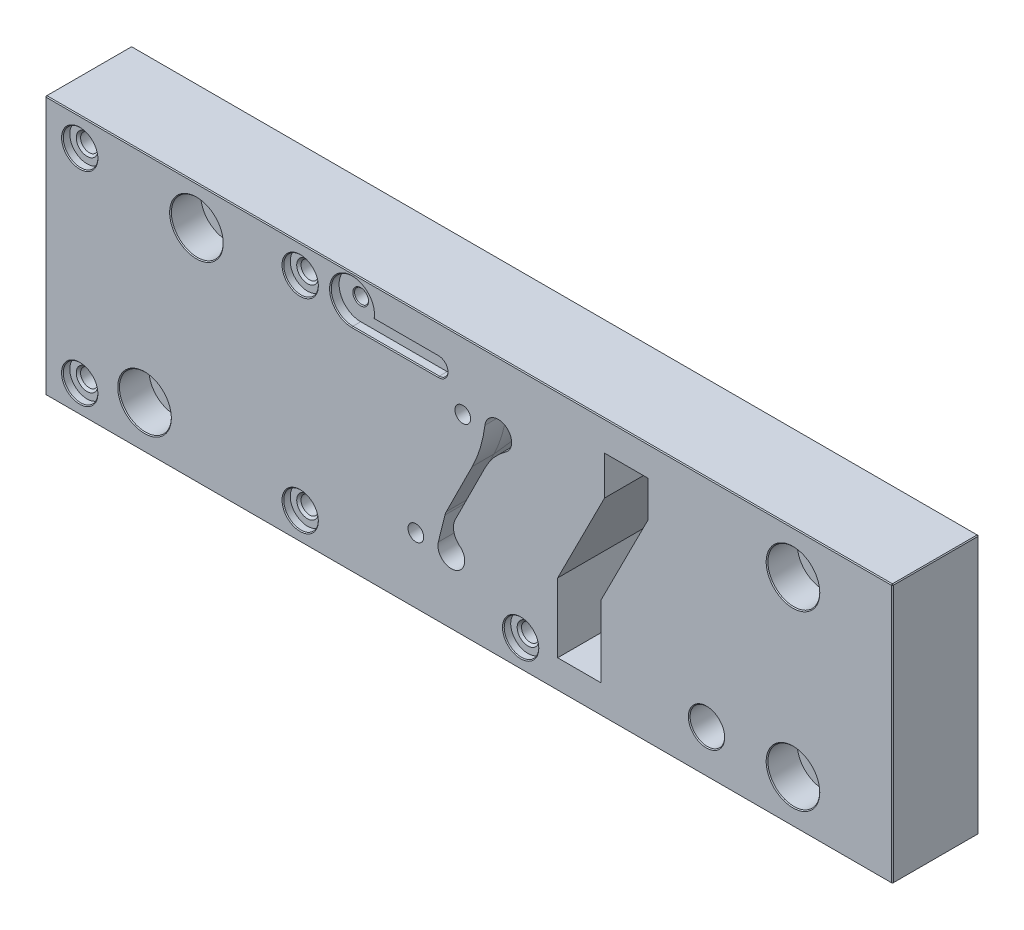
ISO-10303-21;
HEADER;
FILE_DESCRIPTION(('STEP AP214'),'2;1');
FILE_NAME('part.step','',(''),(''),'','','');
FILE_SCHEMA(('AUTOMOTIVE_DESIGN { 1 0 10303 214 1 1 1 1 }'));
ENDSEC;
DATA;
#1=APPLICATION_CONTEXT('core data for automotive mechanical design processes');
#2=APPLICATION_PROTOCOL_DEFINITION('international standard','automotive_design',2000,#1);
#3=PRODUCT_CONTEXT('',#1,'mechanical');
#4=PRODUCT('Part','Part','',(#3));
#5=PRODUCT_RELATED_PRODUCT_CATEGORY('part','',(#4));
#6=PRODUCT_DEFINITION_FORMATION('','',#4);
#7=PRODUCT_DEFINITION_CONTEXT('part definition',#1,'design');
#8=PRODUCT_DEFINITION('design','',#6,#7);
#9=PRODUCT_DEFINITION_SHAPE('','',#8);
#10=(LENGTH_UNIT() NAMED_UNIT(*) SI_UNIT(.MILLI.,.METRE.));
#11=(NAMED_UNIT(*) PLANE_ANGLE_UNIT() SI_UNIT($,.RADIAN.));
#12=(NAMED_UNIT(*) SI_UNIT($,.STERADIAN.) SOLID_ANGLE_UNIT());
#13=UNCERTAINTY_MEASURE_WITH_UNIT(LENGTH_MEASURE(1.E-05),#10,'distance_accuracy_value','');
#14=(GEOMETRIC_REPRESENTATION_CONTEXT(3) GLOBAL_UNCERTAINTY_ASSIGNED_CONTEXT((#13)) GLOBAL_UNIT_ASSIGNED_CONTEXT((#10,
#11,#12)) REPRESENTATION_CONTEXT('',''));
#15=CARTESIAN_POINT('',(0.,0.,0.));
#16=DIRECTION('',(0.,0.,1.));
#17=DIRECTION('',(1.,0.,0.));
#18=AXIS2_PLACEMENT_3D('',#15,#16,#17);
#19=CARTESIAN_POINT('',(195.9,0.099999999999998,19.8));
#20=DIRECTION('',(0.577350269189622,-0.577350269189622,0.577350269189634));
#21=DIRECTION('',(0.707106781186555,0.,-0.70710678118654));
#22=AXIS2_PLACEMENT_3D('',#19,#20,#21);
#23=PLANE('',#22);
#24=DIRECTION('',(0.,-0.707106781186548,-0.707106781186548));
#25=VECTOR('',#24,1.);
#26=CARTESIAN_POINT('',(195.8,0.1,19.9));
#27=LINE('',#26,#25);
#28=CARTESIAN_POINT('',(195.8,0.,19.8));
#29=VERTEX_POINT('',#28);
#30=CARTESIAN_POINT('',(195.8,0.199999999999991,20.));
#31=VERTEX_POINT('',#30);
#32=EDGE_CURVE('E1326',#29,#31,#27,.F.);
#33=ORIENTED_EDGE('',*,*,#32,.F.);
#34=DIRECTION('',(0.707106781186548,0.707106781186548,0.));
#35=VECTOR('',#34,1.);
#36=CARTESIAN_POINT('',(195.9,0.099999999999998,19.8));
#37=LINE('',#36,#35);
#38=CARTESIAN_POINT('',(196.,0.199999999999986,19.8));
#39=VERTEX_POINT('',#38);
#40=EDGE_CURVE('E1330',#39,#29,#37,.F.);
#41=ORIENTED_EDGE('',*,*,#40,.F.);
#42=DIRECTION('',(0.70710678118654,0.,-0.707106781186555));
#43=VECTOR('',#42,1.);
#44=CARTESIAN_POINT('',(195.9,0.199999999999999,19.9));
#45=LINE('',#44,#43);
#46=EDGE_CURVE('E1324',#31,#39,#45,.T.);
#47=ORIENTED_EDGE('',*,*,#46,.F.);
#48=EDGE_LOOP('',(#33,#41,#47));
#49=FACE_BOUND('',#48,.T.);
#50=ADVANCED_FACE('F17',(#49),#23,.T.);
#51=CARTESIAN_POINT('',(195.9,59.9,19.8));
#52=DIRECTION('',(0.577350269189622,0.577350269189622,0.577350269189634));
#53=DIRECTION('',(0.707106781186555,0.,-0.70710678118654));
#54=AXIS2_PLACEMENT_3D('',#51,#52,#53);
#55=PLANE('',#54);
#56=DIRECTION('',(0.70710678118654,0.,-0.707106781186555));
#57=VECTOR('',#56,1.);
#58=CARTESIAN_POINT('',(195.9,59.8,19.9));
#59=LINE('',#58,#57);
#60=CARTESIAN_POINT('',(196.,59.8,19.8));
#61=VERTEX_POINT('',#60);
#62=CARTESIAN_POINT('',(195.8,59.8,20.));
#63=VERTEX_POINT('',#62);
#64=EDGE_CURVE('E1322',#61,#63,#59,.F.);
#65=ORIENTED_EDGE('',*,*,#64,.F.);
#66=DIRECTION('',(-0.707106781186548,0.707106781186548,0.));
#67=VECTOR('',#66,1.);
#68=CARTESIAN_POINT('',(195.9,59.9,19.8));
#69=LINE('',#68,#67);
#70=CARTESIAN_POINT('',(195.8,60.,19.8));
#71=VERTEX_POINT('',#70);
#72=EDGE_CURVE('E302',#71,#61,#69,.F.);
#73=ORIENTED_EDGE('',*,*,#72,.F.);
#74=DIRECTION('',(0.,-0.70710678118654,0.707106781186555));
#75=VECTOR('',#74,1.);
#76=CARTESIAN_POINT('',(195.8,59.9,19.9));
#77=LINE('',#76,#75);
#78=EDGE_CURVE('E1320',#63,#71,#77,.F.);
#79=ORIENTED_EDGE('',*,*,#78,.F.);
#80=EDGE_LOOP('',(#65,#73,#79));
#81=FACE_BOUND('',#80,.T.);
#82=ADVANCED_FACE('F1392',(#81),#55,.T.);
#83=CARTESIAN_POINT('',(0.099999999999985,59.9,19.8));
#84=DIRECTION('',(-0.577350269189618,0.577350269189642,0.577350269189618));
#85=DIRECTION('',(0.,-0.707106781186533,0.707106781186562));
#86=AXIS2_PLACEMENT_3D('',#83,#84,#85);
#87=PLANE('',#86);
#88=DIRECTION('',(0.707106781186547,0.,0.707106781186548));
#89=VECTOR('',#88,1.);
#90=CARTESIAN_POINT('',(0.0999999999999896,59.8,19.9));
#91=LINE('',#90,#89);
#92=CARTESIAN_POINT('',(0.199999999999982,59.8,20.));
#93=VERTEX_POINT('',#92);
#94=CARTESIAN_POINT('',(0.,59.8,19.8));
#95=VERTEX_POINT('',#94);
#96=EDGE_CURVE('E1316',#93,#95,#91,.F.);
#97=ORIENTED_EDGE('',*,*,#96,.F.);
#98=DIRECTION('',(0.,-0.70710678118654,0.707106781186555));
#99=VECTOR('',#98,1.);
#100=CARTESIAN_POINT('',(0.199999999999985,59.9,19.9));
#101=LINE('',#100,#99);
#102=CARTESIAN_POINT('',(0.199999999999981,60.,19.8));
#103=VERTEX_POINT('',#102);
#104=EDGE_CURVE('E1318',#103,#93,#101,.T.);
#105=ORIENTED_EDGE('',*,*,#104,.F.);
#106=DIRECTION('',(-0.707106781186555,-0.70710678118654,0.));
#107=VECTOR('',#106,1.);
#108=CARTESIAN_POINT('',(0.099999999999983,59.9,19.8));
#109=LINE('',#108,#107);
#110=EDGE_CURVE('E1338',#95,#103,#109,.F.);
#111=ORIENTED_EDGE('',*,*,#110,.F.);
#112=EDGE_LOOP('',(#97,#105,#111));
#113=FACE_BOUND('',#112,.T.);
#114=ADVANCED_FACE('F1386',(#113),#87,.T.);
#115=CARTESIAN_POINT('',(0.099999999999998,0.1,19.8));
#116=DIRECTION('',(-0.577350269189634,-0.577350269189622,0.577350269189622));
#117=DIRECTION('',(0.70710678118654,0.,0.707106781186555));
#118=AXIS2_PLACEMENT_3D('',#115,#116,#117);
#119=PLANE('',#118);
#120=DIRECTION('',(0.,-0.707106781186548,-0.707106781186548));
#121=VECTOR('',#120,1.);
#122=CARTESIAN_POINT('',(0.19999999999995,0.1,19.9));
#123=LINE('',#122,#121);
#124=CARTESIAN_POINT('',(0.199999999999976,0.2,20.));
#125=VERTEX_POINT('',#124);
#126=CARTESIAN_POINT('',(0.199999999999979,0.,19.8));
#127=VERTEX_POINT('',#126);
#128=EDGE_CURVE('E1328',#125,#127,#123,.T.);
#129=ORIENTED_EDGE('',*,*,#128,.F.);
#130=DIRECTION('',(0.707106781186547,0.,0.707106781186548));
#131=VECTOR('',#130,1.);
#132=CARTESIAN_POINT('',(0.0999999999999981,0.200000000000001,19.9));
#133=LINE('',#132,#131);
#134=CARTESIAN_POINT('',(0.,0.2,19.8));
#135=VERTEX_POINT('',#134);
#136=EDGE_CURVE('E1312',#135,#125,#133,.T.);
#137=ORIENTED_EDGE('',*,*,#136,.F.);
#138=DIRECTION('',(0.70710678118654,-0.707106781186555,0.));
#139=VECTOR('',#138,1.);
#140=CARTESIAN_POINT('',(0.099999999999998,0.1,19.8));
#141=LINE('',#140,#139);
#142=EDGE_CURVE('E1334',#127,#135,#141,.F.);
#143=ORIENTED_EDGE('',*,*,#142,.F.);
#144=EDGE_LOOP('',(#129,#137,#143));
#145=FACE_BOUND('',#144,.T.);
#146=ADVANCED_FACE('F1376',(#145),#119,.T.);
#147=CARTESIAN_POINT('',(173.,10.0000000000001,16.5));
#148=DIRECTION('',(0.,0.,1.));
#149=DIRECTION('',(1.,0.,0.));
#150=AXIS2_PLACEMENT_3D('',#147,#148,#149);
#151=CYLINDRICAL_SURFACE('',#150,6.);
#152=CARTESIAN_POINT('',(173.,10.0000000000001,19.7999999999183));
#153=DIRECTION('',(0.,0.,1.));
#154=DIRECTION('',(-1.,0.,0.));
#155=AXIS2_PLACEMENT_3D('',#152,#153,#154);
#156=CIRCLE('',#155,6.00000000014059);
#157=CARTESIAN_POINT('',(166.999999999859,10.0000000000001,19.7999999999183));
#158=VERTEX_POINT('',#157);
#159=EDGE_CURVE('E1307',#158,#158,#156,.T.);
#160=ORIENTED_EDGE('',*,*,#159,.T.);
#161=EDGE_LOOP('',(#160));
#162=FACE_BOUND('',#161,.T.);
#163=CARTESIAN_POINT('',(173.,10.0000000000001,13.));
#164=DIRECTION('',(0.,0.,1.));
#165=DIRECTION('',(1.,0.,0.));
#166=AXIS2_PLACEMENT_3D('',#163,#164,#165);
#167=CIRCLE('',#166,6.);
#168=CARTESIAN_POINT('',(179.,10.0000000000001,13.));
#169=VERTEX_POINT('',#168);
#170=EDGE_CURVE('E20',#169,#169,#167,.T.);
#171=ORIENTED_EDGE('',*,*,#170,.F.);
#172=EDGE_LOOP('',(#171));
#173=FACE_BOUND('',#172,.T.);
#174=ADVANCED_FACE('F1373',(#162,#173),#151,.F.);
#175=CARTESIAN_POINT('',(35.,51.,16.5));
#176=DIRECTION('',(0.,0.,1.));
#177=DIRECTION('',(1.,0.,0.));
#178=AXIS2_PLACEMENT_3D('',#175,#176,#177);
#179=CYLINDRICAL_SURFACE('',#178,6.);
#180=CARTESIAN_POINT('',(35.,51.,19.7999999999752));
#181=DIRECTION('',(0.,0.,1.));
#182=DIRECTION('',(-1.,0.,0.));
#183=AXIS2_PLACEMENT_3D('',#180,#181,#182);
#184=CIRCLE('',#183,6.00000000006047);
#185=CARTESIAN_POINT('',(28.9999999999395,51.,19.7999999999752));
#186=VERTEX_POINT('',#185);
#187=EDGE_CURVE('E1302',#186,#186,#184,.T.);
#188=ORIENTED_EDGE('',*,*,#187,.T.);
#189=EDGE_LOOP('',(#188));
#190=FACE_BOUND('',#189,.T.);
#191=CARTESIAN_POINT('',(35.,51.,13.));
#192=DIRECTION('',(0.,0.,1.));
#193=DIRECTION('',(1.,0.,0.));
#194=AXIS2_PLACEMENT_3D('',#191,#192,#193);
#195=CIRCLE('',#194,6.);
#196=CARTESIAN_POINT('',(41.,51.,13.));
#197=VERTEX_POINT('',#196);
#198=EDGE_CURVE('E1364',#197,#197,#195,.T.);
#199=ORIENTED_EDGE('',*,*,#198,.F.);
#200=EDGE_LOOP('',(#199));
#201=FACE_BOUND('',#200,.T.);
#202=ADVANCED_FACE('F1375',(#190,#201),#179,.F.);
#203=CARTESIAN_POINT('',(23.,10.0000000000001,16.5));
#204=DIRECTION('',(0.,0.,1.));
#205=DIRECTION('',(1.,0.,0.));
#206=AXIS2_PLACEMENT_3D('',#203,#204,#205);
#207=CYLINDRICAL_SURFACE('',#206,6.);
#208=CARTESIAN_POINT('',(23.,10.0000000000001,19.7999999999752));
#209=DIRECTION('',(0.,0.,1.));
#210=DIRECTION('',(-1.,0.,0.));
#211=AXIS2_PLACEMENT_3D('',#208,#209,#210);
#212=CIRCLE('',#211,6.00000000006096);
#213=CARTESIAN_POINT('',(16.9999999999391,10.0000000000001,19.7999999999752));
#214=VERTEX_POINT('',#213);
#215=EDGE_CURVE('E1297',#214,#214,#212,.T.);
#216=ORIENTED_EDGE('',*,*,#215,.T.);
#217=EDGE_LOOP('',(#216));
#218=FACE_BOUND('',#217,.T.);
#219=CARTESIAN_POINT('',(23.,10.0000000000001,13.));
#220=DIRECTION('',(0.,0.,1.));
#221=DIRECTION('',(1.,0.,0.));
#222=AXIS2_PLACEMENT_3D('',#219,#220,#221);
#223=CIRCLE('',#222,6.);
#224=CARTESIAN_POINT('',(29.,10.0000000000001,13.));
#225=VERTEX_POINT('',#224);
#226=EDGE_CURVE('E1362',#225,#225,#223,.T.);
#227=ORIENTED_EDGE('',*,*,#226,.F.);
#228=EDGE_LOOP('',(#227));
#229=FACE_BOUND('',#228,.T.);
#230=ADVANCED_FACE('F1383',(#218,#229),#207,.F.);
#231=CARTESIAN_POINT('',(173.,50.0000000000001,16.5));
#232=DIRECTION('',(0.,0.,1.));
#233=DIRECTION('',(1.,0.,0.));
#234=AXIS2_PLACEMENT_3D('',#231,#232,#233);
#235=CYLINDRICAL_SURFACE('',#234,6.);
#236=CARTESIAN_POINT('',(173.,50.0000000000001,19.7999999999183));
#237=DIRECTION('',(0.,0.,1.));
#238=DIRECTION('',(-1.,0.,0.));
#239=AXIS2_PLACEMENT_3D('',#236,#237,#238);
#240=CIRCLE('',#239,6.00000000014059);
#241=CARTESIAN_POINT('',(166.999999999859,50.0000000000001,19.7999999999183));
#242=VERTEX_POINT('',#241);
#243=EDGE_CURVE('E1292',#242,#242,#240,.T.);
#244=ORIENTED_EDGE('',*,*,#243,.T.);
#245=EDGE_LOOP('',(#244));
#246=FACE_BOUND('',#245,.T.);
#247=CARTESIAN_POINT('',(173.,50.0000000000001,13.));
#248=DIRECTION('',(0.,0.,1.));
#249=DIRECTION('',(1.,0.,0.));
#250=AXIS2_PLACEMENT_3D('',#247,#248,#249);
#251=CIRCLE('',#250,6.);
#252=CARTESIAN_POINT('',(179.,50.0000000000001,13.));
#253=VERTEX_POINT('',#252);
#254=EDGE_CURVE('E305',#253,#253,#251,.T.);
#255=ORIENTED_EDGE('',*,*,#254,.F.);
#256=EDGE_LOOP('',(#255));
#257=FACE_BOUND('',#256,.T.);
#258=ADVANCED_FACE('F1500',(#246,#257),#235,.F.);
#259=CARTESIAN_POINT('',(8.,53.4761087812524,19.15));
#260=DIRECTION('',(0.,0.,1.));
#261=DIRECTION('',(1.,0.,0.));
#262=AXIS2_PLACEMENT_3D('',#259,#260,#261);
#263=CYLINDRICAL_SURFACE('',#262,4.);
#264=CARTESIAN_POINT('',(8.,53.4761087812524,19.7999999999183));
#265=DIRECTION('',(0.,0.,1.));
#266=DIRECTION('',(-1.,0.,0.));
#267=AXIS2_PLACEMENT_3D('',#264,#265,#266);
#268=CIRCLE('',#267,4.00000000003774);
#269=CARTESIAN_POINT('',(3.99999999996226,53.4761087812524,19.7999999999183));
#270=VERTEX_POINT('',#269);
#271=EDGE_CURVE('E319',#270,#270,#268,.T.);
#272=ORIENTED_EDGE('',*,*,#271,.T.);
#273=EDGE_LOOP('',(#272));
#274=FACE_BOUND('',#273,.T.);
#275=CARTESIAN_POINT('',(8.,53.4761087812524,18.3));
#276=DIRECTION('',(0.,0.,1.));
#277=DIRECTION('',(1.,0.,0.));
#278=AXIS2_PLACEMENT_3D('',#275,#276,#277);
#279=CIRCLE('',#278,4.);
#280=CARTESIAN_POINT('',(12.,53.4761087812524,18.3));
#281=VERTEX_POINT('',#280);
#282=EDGE_CURVE('E1350',#281,#281,#279,.T.);
#283=ORIENTED_EDGE('',*,*,#282,.F.);
#284=EDGE_LOOP('',(#283));
#285=FACE_BOUND('',#284,.T.);
#286=ADVANCED_FACE('F1496',(#274,#285),#263,.F.);
#287=CARTESIAN_POINT('',(71.,49.2061087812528,20.));
#288=DIRECTION('',(0.,-1.,0.));
#289=DIRECTION('',(0.,0.,-1.));
#290=AXIS2_PLACEMENT_3D('',#287,#288,#289);
#291=PLANE('',#290);
#292=DIRECTION('',(0.,0.,-1.));
#293=VECTOR('',#292,1.);
#294=CARTESIAN_POINT('',(91.,49.2061087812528,20.));
#295=LINE('',#294,#293);
#296=CARTESIAN_POINT('',(91.,49.2061087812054,19.7999999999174));
#297=VERTEX_POINT('',#296);
#298=CARTESIAN_POINT('',(91.,49.2061087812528,18.));
#299=VERTEX_POINT('',#298);
#300=EDGE_CURVE('E286',#297,#299,#295,.T.);
#301=ORIENTED_EDGE('',*,*,#300,.T.);
#302=DIRECTION('',(1.,0.,0.));
#303=VECTOR('',#302,1.);
#304=CARTESIAN_POINT('',(78.7105432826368,49.2061087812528,18.));
#305=LINE('',#304,#303);
#306=CARTESIAN_POINT('',(71.,49.2061087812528,18.));
#307=VERTEX_POINT('',#306);
#308=EDGE_CURVE('E270',#307,#299,#305,.T.);
#309=ORIENTED_EDGE('',*,*,#308,.F.);
#310=DIRECTION('',(0.,0.,-1.));
#311=VECTOR('',#310,1.);
#312=CARTESIAN_POINT('',(71.,49.2061087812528,20.));
#313=LINE('',#312,#311);
#314=CARTESIAN_POINT('',(71.0000000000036,49.206108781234,19.7999999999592));
#315=VERTEX_POINT('',#314);
#316=EDGE_CURVE('E328',#307,#315,#313,.F.);
#317=ORIENTED_EDGE('',*,*,#316,.T.);
#318=DIRECTION('',(1.,0.,0.));
#319=VECTOR('',#318,1.);
#320=CARTESIAN_POINT('',(84.5,49.2061087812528,19.8));
#321=LINE('',#320,#319);
#322=EDGE_CURVE('E316',#297,#315,#321,.F.);
#323=ORIENTED_EDGE('',*,*,#322,.F.);
#324=EDGE_LOOP('',(#301,#309,#317,#323));
#325=FACE_BOUND('',#324,.T.);
#326=ADVANCED_FACE('F1492',(#325),#291,.F.);
#327=CARTESIAN_POINT('',(71.,54.2061087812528,20.));
#328=DIRECTION('',(0.,0.,-1.));
#329=DIRECTION('',(-1.,0.,0.));
#330=AXIS2_PLACEMENT_3D('',#327,#328,#329);
#331=CYLINDRICAL_SURFACE('',#330,5.);
#332=ORIENTED_EDGE('',*,*,#316,.F.);
#333=CARTESIAN_POINT('',(71.,54.2061087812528,18.));
#334=DIRECTION('',(0.,0.,-1.));
#335=DIRECTION('',(-1.,0.,0.));
#336=AXIS2_PLACEMENT_3D('',#333,#334,#335);
#337=CIRCLE('',#336,5.);
#338=CARTESIAN_POINT('',(75.8989794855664,53.2061087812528,18.));
#339=VERTEX_POINT('',#338);
#340=EDGE_CURVE('E296',#339,#307,#337,.F.);
#341=ORIENTED_EDGE('',*,*,#340,.F.);
#342=DIRECTION('',(0.,0.,1.));
#343=VECTOR('',#342,1.);
#344=CARTESIAN_POINT('',(75.8989794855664,53.2061087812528,20.));
#345=LINE('',#344,#343);
#346=CARTESIAN_POINT('',(75.8989794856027,53.2061087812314,19.7999999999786));
#347=VERTEX_POINT('',#346);
#348=EDGE_CURVE('E295',#339,#347,#345,.T.);
#349=ORIENTED_EDGE('',*,*,#348,.T.);
#350=CARTESIAN_POINT('',(71.,54.2061087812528,19.7999999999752));
#351=DIRECTION('',(0.,0.,1.));
#352=DIRECTION('',(-0.979795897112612,0.200000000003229,0.));
#353=AXIS2_PLACEMENT_3D('',#350,#351,#352);
#354=CIRCLE('',#353,5.00000000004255);
#355=EDGE_CURVE('E318',#347,#315,#354,.T.);
#356=ORIENTED_EDGE('',*,*,#355,.T.);
#357=EDGE_LOOP('',(#332,#341,#349,#356));
#358=FACE_BOUND('',#357,.T.);
#359=ADVANCED_FACE('F1489',(#358),#331,.F.);
#360=CARTESIAN_POINT('',(91.,53.2061087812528,20.));
#361=DIRECTION('',(0.,1.,0.));
#362=DIRECTION('',(0.,0.,1.));
#363=AXIS2_PLACEMENT_3D('',#360,#361,#362);
#364=PLANE('',#363);
#365=ORIENTED_EDGE('',*,*,#348,.F.);
#366=DIRECTION('',(1.,0.,0.));
#367=VECTOR('',#366,1.);
#368=CARTESIAN_POINT('',(78.7105432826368,53.2061087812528,18.));
#369=LINE('',#368,#367);
#370=CARTESIAN_POINT('',(91.,53.2061087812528,18.));
#371=VERTEX_POINT('',#370);
#372=EDGE_CURVE('E290',#371,#339,#369,.F.);
#373=ORIENTED_EDGE('',*,*,#372,.F.);
#374=DIRECTION('',(0.,0.,-1.));
#375=VECTOR('',#374,1.);
#376=CARTESIAN_POINT('',(91.,53.2061087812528,20.));
#377=LINE('',#376,#375);
#378=CARTESIAN_POINT('',(91.,53.2061087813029,19.799999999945));
#379=VERTEX_POINT('',#378);
#380=EDGE_CURVE('E277',#371,#379,#377,.F.);
#381=ORIENTED_EDGE('',*,*,#380,.T.);
#382=DIRECTION('',(1.,0.,0.));
#383=VECTOR('',#382,1.);
#384=CARTESIAN_POINT('',(94.5,53.2061087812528,19.8));
#385=LINE('',#384,#383);
#386=EDGE_CURVE('E492',#347,#379,#385,.T.);
#387=ORIENTED_EDGE('',*,*,#386,.F.);
#388=EDGE_LOOP('',(#365,#373,#381,#387));
#389=FACE_BOUND('',#388,.T.);
#390=ADVANCED_FACE('F293',(#389),#364,.F.);
#391=CARTESIAN_POINT('',(91.,51.2061087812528,20.));
#392=DIRECTION('',(0.,0.,-1.));
#393=DIRECTION('',(-1.,0.,0.));
#394=AXIS2_PLACEMENT_3D('',#391,#392,#393);
#395=CYLINDRICAL_SURFACE('',#394,2.);
#396=ORIENTED_EDGE('',*,*,#380,.F.);
#397=CARTESIAN_POINT('',(91.,51.2061087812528,18.));
#398=DIRECTION('',(0.,0.,-1.));
#399=DIRECTION('',(-1.,0.,0.));
#400=AXIS2_PLACEMENT_3D('',#397,#398,#399);
#401=CIRCLE('',#400,2.);
#402=EDGE_CURVE('E279',#299,#371,#401,.F.);
#403=ORIENTED_EDGE('',*,*,#402,.F.);
#404=ORIENTED_EDGE('',*,*,#300,.F.);
#405=CARTESIAN_POINT('',(91.,51.2061087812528,19.7999999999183));
#406=DIRECTION('',(0.,0.,1.));
#407=DIRECTION('',(0.,1.,0.));
#408=AXIS2_PLACEMENT_3D('',#405,#406,#407);
#409=CIRCLE('',#408,2.0000000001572);
#410=EDGE_CURVE('E281',#297,#379,#409,.T.);
#411=ORIENTED_EDGE('',*,*,#410,.T.);
#412=EDGE_LOOP('',(#396,#403,#404,#411));
#413=FACE_BOUND('',#412,.T.);
#414=ADVANCED_FACE('F278',(#413),#395,.F.);
#415=CARTESIAN_POINT('',(59.,6.37610878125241,19.15));
#416=DIRECTION('',(0.,0.,1.));
#417=DIRECTION('',(1.,0.,0.));
#418=AXIS2_PLACEMENT_3D('',#415,#416,#417);
#419=CYLINDRICAL_SURFACE('',#418,4.);
#420=CARTESIAN_POINT('',(59.,6.37610878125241,19.7999999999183));
#421=DIRECTION('',(0.,0.,1.));
#422=DIRECTION('',(-1.,0.,0.));
#423=AXIS2_PLACEMENT_3D('',#420,#421,#422);
#424=CIRCLE('',#423,4.00000000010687);
#425=CARTESIAN_POINT('',(54.9999999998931,6.37610878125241,19.7999999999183));
#426=VERTEX_POINT('',#425);
#427=EDGE_CURVE('E1268',#426,#426,#424,.T.);
#428=ORIENTED_EDGE('',*,*,#427,.T.);
#429=EDGE_LOOP('',(#428));
#430=FACE_BOUND('',#429,.T.);
#431=CARTESIAN_POINT('',(59.,6.37610878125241,18.3));
#432=DIRECTION('',(0.,0.,1.));
#433=DIRECTION('',(1.,0.,0.));
#434=AXIS2_PLACEMENT_3D('',#431,#432,#433);
#435=CIRCLE('',#434,4.);
#436=CARTESIAN_POINT('',(63.,6.37610878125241,18.3));
#437=VERTEX_POINT('',#436);
#438=EDGE_CURVE('E298',#437,#437,#435,.T.);
#439=ORIENTED_EDGE('',*,*,#438,.F.);
#440=EDGE_LOOP('',(#439));
#441=FACE_BOUND('',#440,.T.);
#442=ADVANCED_FACE('F1480',(#430,#441),#419,.F.);
#443=CARTESIAN_POINT('',(59.,53.4761087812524,19.15));
#444=DIRECTION('',(0.,0.,1.));
#445=DIRECTION('',(1.,0.,0.));
#446=AXIS2_PLACEMENT_3D('',#443,#444,#445);
#447=CYLINDRICAL_SURFACE('',#446,4.);
#448=CARTESIAN_POINT('',(59.,53.4761087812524,19.7999999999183));
#449=DIRECTION('',(0.,0.,1.));
#450=DIRECTION('',(-1.,0.,0.));
#451=AXIS2_PLACEMENT_3D('',#448,#449,#450);
#452=CIRCLE('',#451,4.00000000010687);
#453=CARTESIAN_POINT('',(54.9999999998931,53.4761087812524,19.7999999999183));
#454=VERTEX_POINT('',#453);
#455=EDGE_CURVE('E1263',#454,#454,#452,.T.);
#456=ORIENTED_EDGE('',*,*,#455,.T.);
#457=EDGE_LOOP('',(#456));
#458=FACE_BOUND('',#457,.T.);
#459=CARTESIAN_POINT('',(59.,53.4761087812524,18.3));
#460=DIRECTION('',(0.,0.,1.));
#461=DIRECTION('',(1.,0.,0.));
#462=AXIS2_PLACEMENT_3D('',#459,#460,#461);
#463=CIRCLE('',#462,4.);
#464=CARTESIAN_POINT('',(63.,53.4761087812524,18.3));
#465=VERTEX_POINT('',#464);
#466=EDGE_CURVE('E1355',#465,#465,#463,.T.);
#467=ORIENTED_EDGE('',*,*,#466,.F.);
#468=EDGE_LOOP('',(#467));
#469=FACE_BOUND('',#468,.T.);
#470=ADVANCED_FACE('F1476',(#458,#469),#447,.F.);
#471=CARTESIAN_POINT('',(8.,6.37610878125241,19.15));
#472=DIRECTION('',(0.,0.,1.));
#473=DIRECTION('',(1.,0.,0.));
#474=AXIS2_PLACEMENT_3D('',#471,#472,#473);
#475=CYLINDRICAL_SURFACE('',#474,4.);
#476=CARTESIAN_POINT('',(8.,6.37610878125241,19.7999999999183));
#477=DIRECTION('',(0.,0.,1.));
#478=DIRECTION('',(-1.,0.,0.));
#479=AXIS2_PLACEMENT_3D('',#476,#477,#478);
#480=CIRCLE('',#479,4.00000000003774);
#481=CARTESIAN_POINT('',(3.99999999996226,6.37610878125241,19.7999999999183));
#482=VERTEX_POINT('',#481);
#483=EDGE_CURVE('E1258',#482,#482,#480,.T.);
#484=ORIENTED_EDGE('',*,*,#483,.T.);
#485=EDGE_LOOP('',(#484));
#486=FACE_BOUND('',#485,.T.);
#487=CARTESIAN_POINT('',(8.,6.37610878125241,18.3));
#488=DIRECTION('',(0.,0.,1.));
#489=DIRECTION('',(1.,0.,0.));
#490=AXIS2_PLACEMENT_3D('',#487,#488,#489);
#491=CIRCLE('',#490,4.);
#492=CARTESIAN_POINT('',(12.,6.37610878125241,18.3));
#493=VERTEX_POINT('',#492);
#494=EDGE_CURVE('E1346',#493,#493,#491,.T.);
#495=ORIENTED_EDGE('',*,*,#494,.F.);
#496=EDGE_LOOP('',(#495));
#497=FACE_BOUND('',#496,.T.);
#498=ADVANCED_FACE('F1472',(#486,#497),#475,.F.);
#499=CARTESIAN_POINT('',(110.,6.37610878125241,19.15));
#500=DIRECTION('',(0.,0.,1.));
#501=DIRECTION('',(1.,0.,0.));
#502=AXIS2_PLACEMENT_3D('',#499,#500,#501);
#503=CYLINDRICAL_SURFACE('',#502,4.);
#504=CARTESIAN_POINT('',(110.,6.37610878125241,19.7999999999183));
#505=DIRECTION('',(0.,0.,1.));
#506=DIRECTION('',(-1.,0.,0.));
#507=AXIS2_PLACEMENT_3D('',#504,#505,#506);
#508=CIRCLE('',#507,4.00000000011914);
#509=CARTESIAN_POINT('',(105.999999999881,6.37610878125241,19.7999999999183));
#510=VERTEX_POINT('',#509);
#511=EDGE_CURVE('E483',#510,#510,#508,.T.);
#512=ORIENTED_EDGE('',*,*,#511,.T.);
#513=EDGE_LOOP('',(#512));
#514=FACE_BOUND('',#513,.T.);
#515=CARTESIAN_POINT('',(110.,6.37610878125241,18.3));
#516=DIRECTION('',(0.,0.,1.));
#517=DIRECTION('',(1.,0.,0.));
#518=AXIS2_PLACEMENT_3D('',#515,#516,#517);
#519=CIRCLE('',#518,4.);
#520=CARTESIAN_POINT('',(114.,6.37610878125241,18.3));
#521=VERTEX_POINT('',#520);
#522=EDGE_CURVE('E1343',#521,#521,#519,.T.);
#523=ORIENTED_EDGE('',*,*,#522,.F.);
#524=EDGE_LOOP('',(#523));
#525=FACE_BOUND('',#524,.T.);
#526=ADVANCED_FACE('F1468',(#514,#525),#503,.F.);
#527=CARTESIAN_POINT('',(173.,10.0000000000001,13.));
#528=DIRECTION('',(0.,0.,1.));
#529=DIRECTION('',(1.,0.,0.));
#530=AXIS2_PLACEMENT_3D('',#527,#528,#529);
#531=PLANE('',#530);
#532=CARTESIAN_POINT('',(173.,10.0000000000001,13.0000000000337));
#533=DIRECTION('',(0.,0.,1.));
#534=DIRECTION('',(0.,-1.,0.));
#535=AXIS2_PLACEMENT_3D('',#532,#533,#534);
#536=CIRCLE('',#535,3.69999999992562);
#537=CARTESIAN_POINT('',(173.,6.30000000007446,13.0000000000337));
#538=VERTEX_POINT('',#537);
#539=EDGE_CURVE('E480',#538,#538,#536,.F.);
#540=ORIENTED_EDGE('',*,*,#539,.T.);
#541=EDGE_LOOP('',(#540));
#542=FACE_BOUND('',#541,.T.);
#543=ORIENTED_EDGE('',*,*,#170,.T.);
#544=EDGE_LOOP('',(#543));
#545=FACE_BOUND('',#544,.T.);
#546=ADVANCED_FACE('F1371',(#542,#545),#531,.T.);
#547=CARTESIAN_POINT('',(35.,51.,13.));
#548=DIRECTION('',(0.,0.,1.));
#549=DIRECTION('',(1.,0.,0.));
#550=AXIS2_PLACEMENT_3D('',#547,#548,#549);
#551=PLANE('',#550);
#552=CARTESIAN_POINT('',(35.,51.,13.0000000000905));
#553=DIRECTION('',(0.,0.,1.));
#554=DIRECTION('',(1.,0.,0.));
#555=AXIS2_PLACEMENT_3D('',#552,#553,#554);
#556=CIRCLE('',#555,3.6999999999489);
#557=CARTESIAN_POINT('',(38.6999999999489,51.,13.0000000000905));
#558=VERTEX_POINT('',#557);
#559=EDGE_CURVE('E477',#558,#558,#556,.F.);
#560=ORIENTED_EDGE('',*,*,#559,.T.);
#561=EDGE_LOOP('',(#560));
#562=FACE_BOUND('',#561,.T.);
#563=ORIENTED_EDGE('',*,*,#198,.T.);
#564=EDGE_LOOP('',(#563));
#565=FACE_BOUND('',#564,.T.);
#566=ADVANCED_FACE('F1461',(#562,#565),#551,.T.);
#567=CARTESIAN_POINT('',(23.,10.0000000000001,13.));
#568=DIRECTION('',(0.,0.,1.));
#569=DIRECTION('',(1.,0.,0.));
#570=AXIS2_PLACEMENT_3D('',#567,#568,#569);
#571=PLANE('',#570);
#572=CARTESIAN_POINT('',(23.,10.0000000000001,13.0000000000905));
#573=DIRECTION('',(0.,0.,1.));
#574=DIRECTION('',(0.,-1.,0.));
#575=AXIS2_PLACEMENT_3D('',#572,#573,#574);
#576=CIRCLE('',#575,3.69999999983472);
#577=CARTESIAN_POINT('',(23.,6.30000000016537,13.0000000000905));
#578=VERTEX_POINT('',#577);
#579=EDGE_CURVE('E474',#578,#578,#576,.F.);
#580=ORIENTED_EDGE('',*,*,#579,.T.);
#581=EDGE_LOOP('',(#580));
#582=FACE_BOUND('',#581,.T.);
#583=ORIENTED_EDGE('',*,*,#226,.T.);
#584=EDGE_LOOP('',(#583));
#585=FACE_BOUND('',#584,.T.);
#586=ADVANCED_FACE('F1457',(#582,#585),#571,.T.);
#587=CARTESIAN_POINT('',(173.,50.0000000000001,13.));
#588=DIRECTION('',(0.,0.,1.));
#589=DIRECTION('',(1.,0.,0.));
#590=AXIS2_PLACEMENT_3D('',#587,#588,#589);
#591=PLANE('',#590);
#592=CARTESIAN_POINT('',(173.,50.0000000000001,13.0000000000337));
#593=DIRECTION('',(0.,0.,1.));
#594=DIRECTION('',(0.,-1.,0.));
#595=AXIS2_PLACEMENT_3D('',#592,#593,#594);
#596=CIRCLE('',#595,3.69999999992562);
#597=CARTESIAN_POINT('',(173.,46.3000000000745,13.0000000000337));
#598=VERTEX_POINT('',#597);
#599=EDGE_CURVE('E471',#598,#598,#596,.F.);
#600=ORIENTED_EDGE('',*,*,#599,.T.);
#601=EDGE_LOOP('',(#600));
#602=FACE_BOUND('',#601,.T.);
#603=ORIENTED_EDGE('',*,*,#254,.T.);
#604=EDGE_LOOP('',(#603));
#605=FACE_BOUND('',#604,.T.);
#606=ADVANCED_FACE('F1453',(#602,#605),#591,.T.);
#607=CARTESIAN_POINT('',(78.7105432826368,52.4043253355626,18.));
#608=DIRECTION('',(0.,0.,1.));
#609=DIRECTION('',(1.,0.,0.));
#610=AXIS2_PLACEMENT_3D('',#607,#608,#609);
#611=PLANE('',#610);
#612=CARTESIAN_POINT('',(71.,54.2061087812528,18.0000000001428));
#613=DIRECTION('',(0.,0.,1.));
#614=DIRECTION('',(1.,0.,0.));
#615=AXIS2_PLACEMENT_3D('',#612,#613,#614);
#616=CIRCLE('',#615,1.82099999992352);
#617=CARTESIAN_POINT('',(72.8209999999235,54.2061087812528,18.0000000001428));
#618=VERTEX_POINT('',#617);
#619=EDGE_CURVE('E468',#618,#618,#616,.F.);
#620=ORIENTED_EDGE('',*,*,#619,.T.);
#621=EDGE_LOOP('',(#620));
#622=FACE_BOUND('',#621,.T.);
#623=ORIENTED_EDGE('',*,*,#372,.T.);
#624=ORIENTED_EDGE('',*,*,#340,.T.);
#625=ORIENTED_EDGE('',*,*,#308,.T.);
#626=ORIENTED_EDGE('',*,*,#402,.T.);
#627=EDGE_LOOP('',(#623,#624,#625,#626));
#628=FACE_BOUND('',#627,.T.);
#629=ADVANCED_FACE('F289',(#622,#628),#611,.T.);
#630=CARTESIAN_POINT('',(59.,6.37610878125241,18.3));
#631=DIRECTION('',(0.,0.,1.));
#632=DIRECTION('',(1.,0.,0.));
#633=AXIS2_PLACEMENT_3D('',#630,#631,#632);
#634=PLANE('',#633);
#635=CARTESIAN_POINT('',(59.,6.37610878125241,18.300000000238));
#636=DIRECTION('',(0.,0.,1.));
#637=DIRECTION('',(1.,0.,0.));
#638=AXIS2_PLACEMENT_3D('',#635,#636,#637);
#639=CIRCLE('',#638,2.49999999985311);
#640=CARTESIAN_POINT('',(61.4999999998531,6.37610878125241,18.300000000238));
#641=VERTEX_POINT('',#640);
#642=EDGE_CURVE('E465',#641,#641,#639,.F.);
#643=ORIENTED_EDGE('',*,*,#642,.T.);
#644=EDGE_LOOP('',(#643));
#645=FACE_BOUND('',#644,.T.);
#646=ORIENTED_EDGE('',*,*,#438,.T.);
#647=EDGE_LOOP('',(#646));
#648=FACE_BOUND('',#647,.T.);
#649=ADVANCED_FACE('F1446',(#645,#648),#634,.T.);
#650=CARTESIAN_POINT('',(59.,53.4761087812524,18.3));
#651=DIRECTION('',(0.,0.,1.));
#652=DIRECTION('',(1.,0.,0.));
#653=AXIS2_PLACEMENT_3D('',#650,#651,#652);
#654=PLANE('',#653);
#655=CARTESIAN_POINT('',(59.,53.4761087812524,18.300000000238));
#656=DIRECTION('',(0.,0.,1.));
#657=DIRECTION('',(1.,0.,0.));
#658=AXIS2_PLACEMENT_3D('',#655,#656,#657);
#659=CIRCLE('',#658,2.49999999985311);
#660=CARTESIAN_POINT('',(61.4999999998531,53.4761087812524,18.300000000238));
#661=VERTEX_POINT('',#660);
#662=EDGE_CURVE('E462',#661,#661,#659,.F.);
#663=ORIENTED_EDGE('',*,*,#662,.T.);
#664=EDGE_LOOP('',(#663));
#665=FACE_BOUND('',#664,.T.);
#666=ORIENTED_EDGE('',*,*,#466,.T.);
#667=EDGE_LOOP('',(#666));
#668=FACE_BOUND('',#667,.T.);
#669=ADVANCED_FACE('F1442',(#665,#668),#654,.T.);
#670=CARTESIAN_POINT('',(8.,53.4761087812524,18.3));
#671=DIRECTION('',(0.,0.,1.));
#672=DIRECTION('',(1.,0.,0.));
#673=AXIS2_PLACEMENT_3D('',#670,#671,#672);
#674=PLANE('',#673);
#675=CARTESIAN_POINT('',(8.,53.4761087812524,18.300000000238));
#676=DIRECTION('',(0.,0.,1.));
#677=DIRECTION('',(1.,0.,0.));
#678=AXIS2_PLACEMENT_3D('',#675,#676,#677);
#679=CIRCLE('',#678,2.49999999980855);
#680=CARTESIAN_POINT('',(10.4999999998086,53.4761087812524,18.300000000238));
#681=VERTEX_POINT('',#680);
#682=EDGE_CURVE('E459',#681,#681,#679,.F.);
#683=ORIENTED_EDGE('',*,*,#682,.T.);
#684=EDGE_LOOP('',(#683));
#685=FACE_BOUND('',#684,.T.);
#686=ORIENTED_EDGE('',*,*,#282,.T.);
#687=EDGE_LOOP('',(#686));
#688=FACE_BOUND('',#687,.T.);
#689=ADVANCED_FACE('F1438',(#685,#688),#674,.T.);
#690=CARTESIAN_POINT('',(8.,6.37610878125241,18.3));
#691=DIRECTION('',(0.,0.,1.));
#692=DIRECTION('',(1.,0.,0.));
#693=AXIS2_PLACEMENT_3D('',#690,#691,#692);
#694=PLANE('',#693);
#695=CARTESIAN_POINT('',(8.,6.37610878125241,18.300000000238));
#696=DIRECTION('',(0.,0.,1.));
#697=DIRECTION('',(1.,0.,0.));
#698=AXIS2_PLACEMENT_3D('',#695,#696,#697);
#699=CIRCLE('',#698,2.49999999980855);
#700=CARTESIAN_POINT('',(10.4999999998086,6.37610878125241,18.300000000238));
#701=VERTEX_POINT('',#700);
#702=EDGE_CURVE('E456',#701,#701,#699,.F.);
#703=ORIENTED_EDGE('',*,*,#702,.T.);
#704=EDGE_LOOP('',(#703));
#705=FACE_BOUND('',#704,.T.);
#706=ORIENTED_EDGE('',*,*,#494,.T.);
#707=EDGE_LOOP('',(#706));
#708=FACE_BOUND('',#707,.T.);
#709=ADVANCED_FACE('F1431',(#705,#708),#694,.T.);
#710=CARTESIAN_POINT('',(110.,6.37610878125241,18.3));
#711=DIRECTION('',(0.,0.,1.));
#712=DIRECTION('',(1.,0.,0.));
#713=AXIS2_PLACEMENT_3D('',#710,#711,#712);
#714=PLANE('',#713);
#715=CARTESIAN_POINT('',(110.,6.37610878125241,18.300000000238));
#716=DIRECTION('',(0.,0.,1.));
#717=DIRECTION('',(1.,0.,0.));
#718=AXIS2_PLACEMENT_3D('',#715,#716,#717);
#719=CIRCLE('',#718,2.49999999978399);
#720=CARTESIAN_POINT('',(112.499999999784,6.37610878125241,18.300000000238));
#721=VERTEX_POINT('',#720);
#722=EDGE_CURVE('E452',#721,#721,#719,.F.);
#723=ORIENTED_EDGE('',*,*,#722,.T.);
#724=EDGE_LOOP('',(#723));
#725=FACE_BOUND('',#724,.T.);
#726=ORIENTED_EDGE('',*,*,#522,.T.);
#727=EDGE_LOOP('',(#726));
#728=FACE_BOUND('',#727,.T.);
#729=ADVANCED_FACE('F1422',(#725,#728),#714,.T.);
#730=CARTESIAN_POINT('',(195.9,59.9,0.));
#731=DIRECTION('',(0.707106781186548,0.707106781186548,0.));
#732=DIRECTION('',(-0.707106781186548,0.707106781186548,0.));
#733=AXIS2_PLACEMENT_3D('',#730,#731,#732);
#734=PLANE('',#733);
#735=DIRECTION('',(-0.707106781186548,0.707106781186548,0.));
#736=VECTOR('',#735,1.);
#737=CARTESIAN_POINT('',(195.9,59.9,0.2));
#738=LINE('',#737,#736);
#739=CARTESIAN_POINT('',(196.,59.8,0.199999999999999));
#740=VERTEX_POINT('',#739);
#741=CARTESIAN_POINT('',(195.8,60.,0.199999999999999));
#742=VERTEX_POINT('',#741);
#743=EDGE_CURVE('E1339',#740,#742,#738,.T.);
#744=ORIENTED_EDGE('',*,*,#743,.T.);
#745=DIRECTION('',(0.,0.,1.));
#746=VECTOR('',#745,1.);
#747=CARTESIAN_POINT('',(195.8,60.,0.));
#748=LINE('',#747,#746);
#749=EDGE_CURVE('E1246',#71,#742,#748,.F.);
#750=ORIENTED_EDGE('',*,*,#749,.F.);
#751=ORIENTED_EDGE('',*,*,#72,.T.);
#752=DIRECTION('',(0.,0.,-1.));
#753=VECTOR('',#752,1.);
#754=CARTESIAN_POINT('',(196.,59.8,0.));
#755=LINE('',#754,#753);
#756=EDGE_CURVE('E1252',#740,#61,#755,.F.);
#757=ORIENTED_EDGE('',*,*,#756,.F.);
#758=EDGE_LOOP('',(#744,#750,#751,#757));
#759=FACE_BOUND('',#758,.T.);
#760=ADVANCED_FACE('F1419',(#759),#734,.T.);
#761=CARTESIAN_POINT('',(0.099999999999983,59.9,0.));
#762=DIRECTION('',(-0.70710678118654,0.707106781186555,0.));
#763=DIRECTION('',(-0.707106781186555,-0.70710678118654,0.));
#764=AXIS2_PLACEMENT_3D('',#761,#762,#763);
#765=PLANE('',#764);
#766=DIRECTION('',(-0.707106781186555,-0.70710678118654,0.));
#767=VECTOR('',#766,1.);
#768=CARTESIAN_POINT('',(0.099999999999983,59.9,0.2));
#769=LINE('',#768,#767);
#770=CARTESIAN_POINT('',(0.199999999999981,60.,0.199999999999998));
#771=VERTEX_POINT('',#770);
#772=CARTESIAN_POINT('',(0.,59.8,0.199999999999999));
#773=VERTEX_POINT('',#772);
#774=EDGE_CURVE('E1336',#771,#773,#769,.T.);
#775=ORIENTED_EDGE('',*,*,#774,.T.);
#776=DIRECTION('',(0.,0.,1.));
#777=VECTOR('',#776,1.);
#778=CARTESIAN_POINT('',(0.,59.8,0.));
#779=LINE('',#778,#777);
#780=EDGE_CURVE('E1231',#95,#773,#779,.F.);
#781=ORIENTED_EDGE('',*,*,#780,.F.);
#782=ORIENTED_EDGE('',*,*,#110,.T.);
#783=DIRECTION('',(0.,0.,1.));
#784=VECTOR('',#783,1.);
#785=CARTESIAN_POINT('',(0.199999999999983,60.,0.));
#786=LINE('',#785,#784);
#787=EDGE_CURVE('E1243',#771,#103,#786,.T.);
#788=ORIENTED_EDGE('',*,*,#787,.F.);
#789=EDGE_LOOP('',(#775,#781,#782,#788));
#790=FACE_BOUND('',#789,.T.);
#791=ADVANCED_FACE('F1421',(#790),#765,.T.);
#792=CARTESIAN_POINT('',(0.099999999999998,0.1,0.));
#793=DIRECTION('',(-0.707106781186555,-0.70710678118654,0.));
#794=DIRECTION('',(0.70710678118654,-0.707106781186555,0.));
#795=AXIS2_PLACEMENT_3D('',#792,#793,#794);
#796=PLANE('',#795);
#797=DIRECTION('',(0.70710678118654,-0.707106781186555,0.));
#798=VECTOR('',#797,1.);
#799=CARTESIAN_POINT('',(0.099999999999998,0.1,0.2));
#800=LINE('',#799,#798);
#801=CARTESIAN_POINT('',(0.,0.199999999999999,0.2));
#802=VERTEX_POINT('',#801);
#803=CARTESIAN_POINT('',(0.2,0.,0.2));
#804=VERTEX_POINT('',#803);
#805=EDGE_CURVE('E1332',#802,#804,#800,.T.);
#806=ORIENTED_EDGE('',*,*,#805,.T.);
#807=DIRECTION('',(0.,0.,-1.));
#808=VECTOR('',#807,1.);
#809=CARTESIAN_POINT('',(0.200000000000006,0.,0.));
#810=LINE('',#809,#808);
#811=EDGE_CURVE('E1223',#127,#804,#810,.T.);
#812=ORIENTED_EDGE('',*,*,#811,.F.);
#813=ORIENTED_EDGE('',*,*,#142,.T.);
#814=DIRECTION('',(0.,0.,1.));
#815=VECTOR('',#814,1.);
#816=CARTESIAN_POINT('',(0.,0.2,0.));
#817=LINE('',#816,#815);
#818=EDGE_CURVE('E1237',#802,#135,#817,.T.);
#819=ORIENTED_EDGE('',*,*,#818,.F.);
#820=EDGE_LOOP('',(#806,#812,#813,#819));
#821=FACE_BOUND('',#820,.T.);
#822=ADVANCED_FACE('F1428',(#821),#796,.T.);
#823=CARTESIAN_POINT('',(195.9,0.099999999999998,0.));
#824=DIRECTION('',(0.707106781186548,-0.707106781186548,0.));
#825=DIRECTION('',(0.707106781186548,0.707106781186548,0.));
#826=AXIS2_PLACEMENT_3D('',#823,#824,#825);
#827=PLANE('',#826);
#828=DIRECTION('',(-0.707106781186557,-0.707106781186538,0.));
#829=VECTOR('',#828,1.);
#830=CARTESIAN_POINT('',(196.,0.2,0.200000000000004));
#831=LINE('',#830,#829);
#832=CARTESIAN_POINT('',(196.,0.199999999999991,0.199999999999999));
#833=VERTEX_POINT('',#832);
#834=CARTESIAN_POINT('',(195.8,0.,0.2));
#835=VERTEX_POINT('',#834);
#836=EDGE_CURVE('E1229',#833,#835,#831,.T.);
#837=ORIENTED_EDGE('',*,*,#836,.F.);
#838=DIRECTION('',(0.,0.,-1.));
#839=VECTOR('',#838,1.);
#840=CARTESIAN_POINT('',(196.,0.199999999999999,0.));
#841=LINE('',#840,#839);
#842=EDGE_CURVE('E455',#39,#833,#841,.T.);
#843=ORIENTED_EDGE('',*,*,#842,.F.);
#844=ORIENTED_EDGE('',*,*,#40,.T.);
#845=DIRECTION('',(0.,0.,-1.));
#846=VECTOR('',#845,1.);
#847=CARTESIAN_POINT('',(195.8,0.,0.));
#848=LINE('',#847,#846);
#849=EDGE_CURVE('E1218',#835,#29,#848,.F.);
#850=ORIENTED_EDGE('',*,*,#849,.F.);
#851=EDGE_LOOP('',(#837,#843,#844,#850));
#852=FACE_BOUND('',#851,.T.);
#853=ADVANCED_FACE('F1413',(#852),#827,.T.);
#854=CARTESIAN_POINT('',(96.379121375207,21.2650298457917,20.));
#855=DIRECTION('',(0.,0.,-1.));
#856=DIRECTION('',(-1.,0.,0.));
#857=AXIS2_PLACEMENT_3D('',#854,#855,#856);
#858=CYLINDRICAL_SURFACE('',#857,3.99999999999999);
#859=DIRECTION('',(0.,0.,1.));
#860=VECTOR('',#859,1.);
#861=CARTESIAN_POINT('',(92.7993839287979,23.0498210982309,20.));
#862=LINE('',#861,#860);
#863=CARTESIAN_POINT('',(92.7993839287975,23.0498210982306,14.9999999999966));
#864=VERTEX_POINT('',#863);
#865=CARTESIAN_POINT('',(92.799383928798,23.0498210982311,20.));
#866=VERTEX_POINT('',#865);
#867=EDGE_CURVE('E450',#864,#866,#862,.T.);
#868=ORIENTED_EDGE('',*,*,#867,.T.);
#869=CARTESIAN_POINT('',(96.379121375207,21.2650298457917,20.));
#870=DIRECTION('',(0.,0.,-1.));
#871=DIRECTION('',(-1.,0.,0.));
#872=AXIS2_PLACEMENT_3D('',#869,#870,#871);
#873=CIRCLE('',#872,3.99999999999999);
#874=CARTESIAN_POINT('',(92.4979384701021,22.2327174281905,20.));
#875=VERTEX_POINT('',#874);
#876=EDGE_CURVE('E493',#875,#866,#873,.T.);
#877=ORIENTED_EDGE('',*,*,#876,.F.);
#878=DIRECTION('',(0.,0.,1.));
#879=VECTOR('',#878,1.);
#880=CARTESIAN_POINT('',(92.497938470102,22.2327174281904,20.));
#881=LINE('',#880,#879);
#882=CARTESIAN_POINT('',(92.4979384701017,22.23271742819,14.9999999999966));
#883=VERTEX_POINT('',#882);
#884=EDGE_CURVE('E1178',#875,#883,#881,.F.);
#885=ORIENTED_EDGE('',*,*,#884,.T.);
#886=CARTESIAN_POINT('',(96.379121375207,21.2650298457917,14.9999999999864));
#887=DIRECTION('',(0.,0.,-1.));
#888=DIRECTION('',(0.894934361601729,-0.446197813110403,0.));
#889=AXIS2_PLACEMENT_3D('',#886,#887,#888);
#890=CIRCLE('',#889,4.00000000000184);
#891=EDGE_CURVE('E451',#883,#864,#890,.T.);
#892=ORIENTED_EDGE('',*,*,#891,.T.);
#893=EDGE_LOOP('',(#868,#877,#885,#892));
#894=FACE_BOUND('',#893,.T.);
#895=ADVANCED_FACE('F1548',(#894),#858,.F.);
#896=CARTESIAN_POINT('',(147.,0.1,19.9));
#897=DIRECTION('',(0.,-0.707106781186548,0.707106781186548));
#898=DIRECTION('',(0.,-0.707106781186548,-0.707106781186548));
#899=AXIS2_PLACEMENT_3D('',#896,#897,#898);
#900=PLANE('',#899);
#901=ORIENTED_EDGE('',*,*,#32,.T.);
#902=DIRECTION('',(1.,0.,0.));
#903=VECTOR('',#902,1.);
#904=CARTESIAN_POINT('',(98.,0.199999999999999,20.));
#905=LINE('',#904,#903);
#906=EDGE_CURVE('E1140',#125,#31,#905,.T.);
#907=ORIENTED_EDGE('',*,*,#906,.F.);
#908=ORIENTED_EDGE('',*,*,#128,.T.);
#909=DIRECTION('',(1.,0.,0.));
#910=VECTOR('',#909,1.);
#911=CARTESIAN_POINT('',(196.,0.,19.8));
#912=LINE('',#911,#910);
#913=EDGE_CURVE('E1226',#29,#127,#912,.F.);
#914=ORIENTED_EDGE('',*,*,#913,.F.);
#915=EDGE_LOOP('',(#901,#907,#908,#914));
#916=FACE_BOUND('',#915,.T.);
#917=ADVANCED_FACE('F1545',(#916),#900,.T.);
#918=CARTESIAN_POINT('',(195.9,45.,19.9));
#919=DIRECTION('',(0.707106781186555,0.,0.70710678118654));
#920=DIRECTION('',(0.70710678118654,0.,-0.707106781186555));
#921=AXIS2_PLACEMENT_3D('',#918,#919,#920);
#922=PLANE('',#921);
#923=ORIENTED_EDGE('',*,*,#64,.T.);
#924=DIRECTION('',(0.,1.,0.));
#925=VECTOR('',#924,1.);
#926=CARTESIAN_POINT('',(195.8,30.,20.));
#927=LINE('',#926,#925);
#928=EDGE_CURVE('E1137',#31,#63,#927,.T.);
#929=ORIENTED_EDGE('',*,*,#928,.F.);
#930=ORIENTED_EDGE('',*,*,#46,.T.);
#931=DIRECTION('',(0.,1.,0.));
#932=VECTOR('',#931,1.);
#933=CARTESIAN_POINT('',(196.,60.,19.8));
#934=LINE('',#933,#932);
#935=EDGE_CURVE('E1249',#61,#39,#934,.F.);
#936=ORIENTED_EDGE('',*,*,#935,.F.);
#937=EDGE_LOOP('',(#923,#929,#930,#936));
#938=FACE_BOUND('',#937,.T.);
#939=ADVANCED_FACE('F1406',(#938),#922,.T.);
#940=CARTESIAN_POINT('',(49.,59.9,19.9));
#941=DIRECTION('',(0.,0.707106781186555,0.70710678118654));
#942=DIRECTION('',(0.,-0.70710678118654,0.707106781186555));
#943=AXIS2_PLACEMENT_3D('',#940,#941,#942);
#944=PLANE('',#943);
#945=ORIENTED_EDGE('',*,*,#104,.T.);
#946=DIRECTION('',(1.,0.,0.));
#947=VECTOR('',#946,1.);
#948=CARTESIAN_POINT('',(98.,59.8,20.));
#949=LINE('',#948,#947);
#950=EDGE_CURVE('E1134',#63,#93,#949,.F.);
#951=ORIENTED_EDGE('',*,*,#950,.F.);
#952=ORIENTED_EDGE('',*,*,#78,.T.);
#953=DIRECTION('',(1.,0.,0.));
#954=VECTOR('',#953,1.);
#955=CARTESIAN_POINT('',(0.,60.,19.8));
#956=LINE('',#955,#954);
#957=EDGE_CURVE('E1240',#103,#71,#956,.T.);
#958=ORIENTED_EDGE('',*,*,#957,.F.);
#959=EDGE_LOOP('',(#945,#951,#952,#958));
#960=FACE_BOUND('',#959,.T.);
#961=ADVANCED_FACE('F1538',(#960),#944,.T.);
#962=CARTESIAN_POINT('',(0.099999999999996,15.,19.9));
#963=DIRECTION('',(-0.707106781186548,0.,0.707106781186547));
#964=DIRECTION('',(0.707106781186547,0.,0.707106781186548));
#965=AXIS2_PLACEMENT_3D('',#962,#963,#964);
#966=PLANE('',#965);
#967=ORIENTED_EDGE('',*,*,#136,.T.);
#968=DIRECTION('',(0.,1.,0.));
#969=VECTOR('',#968,1.);
#970=CARTESIAN_POINT('',(0.199999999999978,30.,20.));
#971=LINE('',#970,#969);
#972=EDGE_CURVE('E447',#93,#125,#971,.F.);
#973=ORIENTED_EDGE('',*,*,#972,.F.);
#974=ORIENTED_EDGE('',*,*,#96,.T.);
#975=DIRECTION('',(0.,1.,0.));
#976=VECTOR('',#975,1.);
#977=CARTESIAN_POINT('',(0.,0.,19.8));
#978=LINE('',#977,#976);
#979=EDGE_CURVE('E1234',#135,#95,#978,.T.);
#980=ORIENTED_EDGE('',*,*,#979,.F.);
#981=EDGE_LOOP('',(#967,#973,#974,#980));
#982=FACE_BOUND('',#981,.T.);
#983=ADVANCED_FACE('F1534',(#982),#966,.T.);
#984=CARTESIAN_POINT('',(173.,10.0000000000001,19.999999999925));
#985=DIRECTION('',(0.,0.,1.));
#986=DIRECTION('',(1.,0.,0.));
#987=AXIS2_PLACEMENT_3D('',#984,#985,#986);
#988=CONICAL_SURFACE('',#987,6.19999999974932,0.785398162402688);
#989=CARTESIAN_POINT('',(173.,10.0000000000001,20.0000000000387));
#990=DIRECTION('',(0.,0.,1.));
#991=DIRECTION('',(1.,0.,0.));
#992=AXIS2_PLACEMENT_3D('',#989,#990,#991);
#993=CIRCLE('',#992,6.19999999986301);
#994=CARTESIAN_POINT('',(179.199999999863,10.0000000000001,20.0000000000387));
#995=VERTEX_POINT('',#994);
#996=EDGE_CURVE('E424',#995,#995,#993,.F.);
#997=ORIENTED_EDGE('',*,*,#996,.F.);
#998=EDGE_LOOP('',(#997));
#999=FACE_BOUND('',#998,.T.);
#1000=ORIENTED_EDGE('',*,*,#159,.F.);
#1001=EDGE_LOOP('',(#1000));
#1002=FACE_BOUND('',#1001,.T.);
#1003=ADVANCED_FACE('F1526',(#999,#1002),#988,.F.);
#1004=CARTESIAN_POINT('',(35.,51.,20.0000000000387));
#1005=DIRECTION('',(0.,0.,1.));
#1006=DIRECTION('',(1.,0.,0.));
#1007=AXIS2_PLACEMENT_3D('',#1004,#1005,#1006);
#1008=CONICAL_SURFACE('',#1007,6.19999999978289,0.785398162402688);
#1009=CARTESIAN_POINT('',(35.,51.,20.0000000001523));
#1010=DIRECTION('',(0.,0.,1.));
#1011=DIRECTION('',(1.,0.,0.));
#1012=AXIS2_PLACEMENT_3D('',#1009,#1010,#1011);
#1013=CIRCLE('',#1012,6.19999999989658);
#1014=CARTESIAN_POINT('',(41.1999999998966,51.,20.0000000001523));
#1015=VERTEX_POINT('',#1014);
#1016=EDGE_CURVE('E421',#1015,#1015,#1013,.F.);
#1017=ORIENTED_EDGE('',*,*,#1016,.F.);
#1018=EDGE_LOOP('',(#1017));
#1019=FACE_BOUND('',#1018,.T.);
#1020=ORIENTED_EDGE('',*,*,#187,.F.);
#1021=EDGE_LOOP('',(#1020));
#1022=FACE_BOUND('',#1021,.T.);
#1023=ADVANCED_FACE('F1516',(#1019,#1022),#1008,.F.);
#1024=CARTESIAN_POINT('',(23.,10.0000000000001,20.0000000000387));
#1025=DIRECTION('',(0.,0.,1.));
#1026=DIRECTION('',(1.,0.,0.));
#1027=AXIS2_PLACEMENT_3D('',#1024,#1025,#1026);
#1028=CONICAL_SURFACE('',#1027,6.19999999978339,0.785398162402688);
#1029=CARTESIAN_POINT('',(23.,10.0000000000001,20.0000000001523));
#1030=DIRECTION('',(0.,0.,1.));
#1031=DIRECTION('',(1.,0.,0.));
#1032=AXIS2_PLACEMENT_3D('',#1029,#1030,#1031);
#1033=CIRCLE('',#1032,6.19999999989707);
#1034=CARTESIAN_POINT('',(29.1999999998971,10.0000000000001,20.0000000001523));
#1035=VERTEX_POINT('',#1034);
#1036=EDGE_CURVE('E418',#1035,#1035,#1033,.F.);
#1037=ORIENTED_EDGE('',*,*,#1036,.F.);
#1038=EDGE_LOOP('',(#1037));
#1039=FACE_BOUND('',#1038,.T.);
#1040=ORIENTED_EDGE('',*,*,#215,.F.);
#1041=EDGE_LOOP('',(#1040));
#1042=FACE_BOUND('',#1041,.T.);
#1043=ADVANCED_FACE('F1513',(#1039,#1042),#1028,.F.);
#1044=CARTESIAN_POINT('',(173.,50.0000000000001,19.999999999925));
#1045=DIRECTION('',(0.,0.,1.));
#1046=DIRECTION('',(1.,0.,0.));
#1047=AXIS2_PLACEMENT_3D('',#1044,#1045,#1046);
#1048=CONICAL_SURFACE('',#1047,6.19999999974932,0.785398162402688);
#1049=CARTESIAN_POINT('',(173.,50.0000000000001,20.0000000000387));
#1050=DIRECTION('',(0.,0.,1.));
#1051=DIRECTION('',(1.,0.,0.));
#1052=AXIS2_PLACEMENT_3D('',#1049,#1050,#1051);
#1053=CIRCLE('',#1052,6.19999999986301);
#1054=CARTESIAN_POINT('',(179.199999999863,50.0000000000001,20.0000000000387));
#1055=VERTEX_POINT('',#1054);
#1056=EDGE_CURVE('E415',#1055,#1055,#1053,.F.);
#1057=ORIENTED_EDGE('',*,*,#1056,.F.);
#1058=EDGE_LOOP('',(#1057));
#1059=FACE_BOUND('',#1058,.T.);
#1060=ORIENTED_EDGE('',*,*,#243,.F.);
#1061=EDGE_LOOP('',(#1060));
#1062=FACE_BOUND('',#1061,.T.);
#1063=ADVANCED_FACE('F1515',(#1059,#1062),#1048,.F.);
#1064=CARTESIAN_POINT('',(8.,53.4761087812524,19.9999999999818));
#1065=DIRECTION('',(0.,0.,1.));
#1066=DIRECTION('',(1.,0.,0.));
#1067=AXIS2_PLACEMENT_3D('',#1064,#1065,#1066);
#1068=CONICAL_SURFACE('',#1067,4.19999999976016,0.785398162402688);
#1069=CARTESIAN_POINT('',(8.,53.4761087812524,20.0000000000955));
#1070=DIRECTION('',(0.,0.,1.));
#1071=DIRECTION('',(1.,0.,0.));
#1072=AXIS2_PLACEMENT_3D('',#1069,#1070,#1071);
#1073=CIRCLE('',#1072,4.19999999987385);
#1074=CARTESIAN_POINT('',(12.1999999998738,53.4761087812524,20.0000000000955));
#1075=VERTEX_POINT('',#1074);
#1076=EDGE_CURVE('E409',#1075,#1075,#1073,.F.);
#1077=ORIENTED_EDGE('',*,*,#1076,.F.);
#1078=EDGE_LOOP('',(#1077));
#1079=FACE_BOUND('',#1078,.T.);
#1080=ORIENTED_EDGE('',*,*,#271,.F.);
#1081=EDGE_LOOP('',(#1080));
#1082=FACE_BOUND('',#1081,.T.);
#1083=ADVANCED_FACE('F1523',(#1079,#1082),#1068,.F.);
#1084=CARTESIAN_POINT('',(84.5,49.1061087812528,19.9));
#1085=DIRECTION('',(0.,0.707106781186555,0.70710678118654));
#1086=DIRECTION('',(0.,-0.70710678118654,0.707106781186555));
#1087=AXIS2_PLACEMENT_3D('',#1084,#1085,#1086);
#1088=PLANE('',#1087);
#1089=DIRECTION('',(-2.32935892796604E-12,0.707106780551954,-0.707106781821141));
#1090=VECTOR('',#1089,1.);
#1091=CARTESIAN_POINT('',(71.0000016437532,-498930.992995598,499000.));
#1092=LINE('',#1091,#1090);
#1093=CARTESIAN_POINT('',(71.0000000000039,49.006108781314,20.0000000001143));
#1094=VERTEX_POINT('',#1093);
#1095=EDGE_CURVE('E324',#315,#1094,#1092,.F.);
#1096=ORIENTED_EDGE('',*,*,#1095,.T.);
#1097=DIRECTION('',(1.,0.,0.));
#1098=VECTOR('',#1097,1.);
#1099=CARTESIAN_POINT('',(98.,49.0061087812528,20.));
#1100=LINE('',#1099,#1098);
#1101=CARTESIAN_POINT('',(91.,49.0061087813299,20.0000000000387));
#1102=VERTEX_POINT('',#1101);
#1103=EDGE_CURVE('E408',#1102,#1094,#1100,.F.);
#1104=ORIENTED_EDGE('',*,*,#1103,.F.);
#1105=DIRECTION('',(0.,0.707106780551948,-0.707106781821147));
#1106=VECTOR('',#1105,1.);
#1107=CARTESIAN_POINT('',(90.9999999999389,-498897.587782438,498966.594786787));
#1108=LINE('',#1107,#1106);
#1109=EDGE_CURVE('E308',#1102,#297,#1108,.T.);
#1110=ORIENTED_EDGE('',*,*,#1109,.T.);
#1111=ORIENTED_EDGE('',*,*,#322,.T.);
#1112=EDGE_LOOP('',(#1096,#1104,#1110,#1111));
#1113=FACE_BOUND('',#1112,.T.);
#1114=ADVANCED_FACE('F1704',(#1113),#1088,.T.);
#1115=CARTESIAN_POINT('',(71.,54.2061087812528,20.0000000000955));
#1116=DIRECTION('',(0.,0.,1.));
#1117=DIRECTION('',(1.,0.,0.));
#1118=AXIS2_PLACEMENT_3D('',#1115,#1116,#1117);
#1119=CONICAL_SURFACE('',#1118,5.19999999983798,0.785398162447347);
#1120=ORIENTED_EDGE('',*,*,#1095,.F.);
#1121=ORIENTED_EDGE('',*,*,#355,.F.);
#1122=CARTESIAN_POINT('',(76.1380930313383,53.4061087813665,20.0000000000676));
#1123=CARTESIAN_POINT('',(76.0987944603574,53.372444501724,19.9663357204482));
#1124=CARTESIAN_POINT('',(76.0592190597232,53.3389457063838,19.9328369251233));
#1125=CARTESIAN_POINT('',(75.9795145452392,53.2722790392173,19.8661702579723));
#1126=CARTESIAN_POINT('',(75.9393854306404,53.2391111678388,19.8330023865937));
#1127=CARTESIAN_POINT('',(75.8989794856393,53.2061087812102,19.7999999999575));
#1128=B_SPLINE_CURVE_WITH_KNOTS('',3,(#1122,#1123,#1124,#1125,#1126,#1127),.UNSPECIFIED.,.F.,
.F.,(4,2,4),(0.,0.185188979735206,0.370378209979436),.UNSPECIFIED.);
#1129=CARTESIAN_POINT('',(76.1380930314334,53.4061087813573,20.0000000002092));
#1130=VERTEX_POINT('',#1129);
#1131=EDGE_CURVE('E484',#1130,#347,#1128,.T.);
#1132=ORIENTED_EDGE('',*,*,#1131,.F.);
#1133=CARTESIAN_POINT('',(71.,54.2061087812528,20.0000000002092));
#1134=DIRECTION('',(0.,0.,1.));
#1135=DIRECTION('',(1.,0.,0.));
#1136=AXIS2_PLACEMENT_3D('',#1133,#1134,#1135);
#1137=CIRCLE('',#1136,5.19999999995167);
#1138=EDGE_CURVE('E406',#1094,#1130,#1137,.F.);
#1139=ORIENTED_EDGE('',*,*,#1138,.F.);
#1140=EDGE_LOOP('',(#1120,#1121,#1132,#1139));
#1141=FACE_BOUND('',#1140,.T.);
#1142=ADVANCED_FACE('F495',(#1141),#1119,.F.);
#1143=CARTESIAN_POINT('',(94.5,53.3061087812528,19.9));
#1144=DIRECTION('',(0.,-0.707106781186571,0.707106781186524));
#1145=DIRECTION('',(0.,-0.707106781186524,-0.707106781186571));
#1146=AXIS2_PLACEMENT_3D('',#1143,#1144,#1145);
#1147=PLANE('',#1146);
#1148=DIRECTION('',(1.,0.,0.));
#1149=VECTOR('',#1148,1.);
#1150=CARTESIAN_POINT('',(98.,53.4061087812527,20.));
#1151=LINE('',#1150,#1149);
#1152=CARTESIAN_POINT('',(91.,53.406108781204,20.0000000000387));
#1153=VERTEX_POINT('',#1152);
#1154=EDGE_CURVE('E405',#1130,#1153,#1151,.T.);
#1155=ORIENTED_EDGE('',*,*,#1154,.F.);
#1156=ORIENTED_EDGE('',*,*,#1131,.T.);
#1157=ORIENTED_EDGE('',*,*,#386,.T.);
#1158=DIRECTION('',(0.,-0.707106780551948,-0.707106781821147));
#1159=VECTOR('',#1158,1.);
#1160=CARTESIAN_POINT('',(91.,499000.,498966.594786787));
#1161=LINE('',#1160,#1159);
#1162=EDGE_CURVE('E307',#379,#1153,#1161,.F.);
#1163=ORIENTED_EDGE('',*,*,#1162,.T.);
#1164=EDGE_LOOP('',(#1155,#1156,#1157,#1163));
#1165=FACE_BOUND('',#1164,.T.);
#1166=ADVANCED_FACE('F498',(#1165),#1147,.T.);
#1167=CARTESIAN_POINT('',(91.,51.2061087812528,19.9999999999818));
#1168=DIRECTION('',(0.,0.,1.));
#1169=DIRECTION('',(1.,0.,0.));
#1170=AXIS2_PLACEMENT_3D('',#1167,#1168,#1169);
#1171=CONICAL_SURFACE('',#1170,2.19999999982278,0.785398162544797);
#1172=ORIENTED_EDGE('',*,*,#410,.F.);
#1173=ORIENTED_EDGE('',*,*,#1109,.F.);
#1174=CARTESIAN_POINT('',(91.,51.2061087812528,20.0000000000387));
#1175=DIRECTION('',(0.,0.,1.));
#1176=DIRECTION('',(1.,0.,0.));
#1177=AXIS2_PLACEMENT_3D('',#1174,#1175,#1176);
#1178=CIRCLE('',#1177,2.19999999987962);
#1179=EDGE_CURVE('E402',#1153,#1102,#1178,.F.);
#1180=ORIENTED_EDGE('',*,*,#1179,.F.);
#1181=ORIENTED_EDGE('',*,*,#1162,.F.);
#1182=EDGE_LOOP('',(#1172,#1173,#1180,#1181));
#1183=FACE_BOUND('',#1182,.T.);
#1184=ADVANCED_FACE('F502',(#1183),#1171,.F.);
#1185=CARTESIAN_POINT('',(59.,6.37610878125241,19.9999999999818));
#1186=DIRECTION('',(0.,0.,1.));
#1187=DIRECTION('',(1.,0.,0.));
#1188=AXIS2_PLACEMENT_3D('',#1185,#1186,#1187);
#1189=CONICAL_SURFACE('',#1188,4.19999999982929,0.785398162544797);
#1190=CARTESIAN_POINT('',(59.,6.37610878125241,20.0000000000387));
#1191=DIRECTION('',(0.,0.,1.));
#1192=DIRECTION('',(1.,0.,0.));
#1193=AXIS2_PLACEMENT_3D('',#1190,#1191,#1192);
#1194=CIRCLE('',#1193,4.19999999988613);
#1195=CARTESIAN_POINT('',(63.1999999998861,6.37610878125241,20.0000000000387));
#1196=VERTEX_POINT('',#1195);
#1197=EDGE_CURVE('E399',#1196,#1196,#1194,.F.);
#1198=ORIENTED_EDGE('',*,*,#1197,.F.);
#1199=EDGE_LOOP('',(#1198));
#1200=FACE_BOUND('',#1199,.T.);
#1201=ORIENTED_EDGE('',*,*,#427,.F.);
#1202=EDGE_LOOP('',(#1201));
#1203=FACE_BOUND('',#1202,.T.);
#1204=ADVANCED_FACE('F506',(#1200,#1203),#1189,.F.);
#1205=CARTESIAN_POINT('',(59.,53.4761087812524,19.9999999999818));
#1206=DIRECTION('',(0.,0.,1.));
#1207=DIRECTION('',(1.,0.,0.));
#1208=AXIS2_PLACEMENT_3D('',#1205,#1206,#1207);
#1209=CONICAL_SURFACE('',#1208,4.19999999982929,0.785398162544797);
#1210=CARTESIAN_POINT('',(59.,53.4761087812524,20.0000000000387));
#1211=DIRECTION('',(0.,0.,1.));
#1212=DIRECTION('',(1.,0.,0.));
#1213=AXIS2_PLACEMENT_3D('',#1210,#1211,#1212);
#1214=CIRCLE('',#1213,4.19999999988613);
#1215=CARTESIAN_POINT('',(63.1999999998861,53.4761087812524,20.0000000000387));
#1216=VERTEX_POINT('',#1215);
#1217=EDGE_CURVE('E396',#1216,#1216,#1214,.F.);
#1218=ORIENTED_EDGE('',*,*,#1217,.F.);
#1219=EDGE_LOOP('',(#1218));
#1220=FACE_BOUND('',#1219,.T.);
#1221=ORIENTED_EDGE('',*,*,#455,.F.);
#1222=EDGE_LOOP('',(#1221));
#1223=FACE_BOUND('',#1222,.T.);
#1224=ADVANCED_FACE('F510',(#1220,#1223),#1209,.F.);
#1225=CARTESIAN_POINT('',(8.,6.37610878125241,19.9999999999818));
#1226=DIRECTION('',(0.,0.,1.));
#1227=DIRECTION('',(1.,0.,0.));
#1228=AXIS2_PLACEMENT_3D('',#1225,#1226,#1227);
#1229=CONICAL_SURFACE('',#1228,4.19999999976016,0.785398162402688);
#1230=CARTESIAN_POINT('',(8.,6.37610878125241,20.0000000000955));
#1231=DIRECTION('',(0.,0.,1.));
#1232=DIRECTION('',(1.,0.,0.));
#1233=AXIS2_PLACEMENT_3D('',#1230,#1231,#1232);
#1234=CIRCLE('',#1233,4.19999999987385);
#1235=CARTESIAN_POINT('',(12.1999999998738,6.37610878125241,20.0000000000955));
#1236=VERTEX_POINT('',#1235);
#1237=EDGE_CURVE('E393',#1236,#1236,#1234,.F.);
#1238=ORIENTED_EDGE('',*,*,#1237,.F.);
#1239=EDGE_LOOP('',(#1238));
#1240=FACE_BOUND('',#1239,.T.);
#1241=ORIENTED_EDGE('',*,*,#483,.F.);
#1242=EDGE_LOOP('',(#1241));
#1243=FACE_BOUND('',#1242,.T.);
#1244=ADVANCED_FACE('F514',(#1240,#1243),#1229,.F.);
#1245=CARTESIAN_POINT('',(110.,6.37610878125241,20.0000000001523));
#1246=DIRECTION('',(0.,0.,1.));
#1247=DIRECTION('',(1.,0.,0.));
#1248=AXIS2_PLACEMENT_3D('',#1245,#1246,#1247);
#1249=CONICAL_SURFACE('',#1248,4.19999999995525,0.785398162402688);
#1250=CARTESIAN_POINT('',(110.,6.37610878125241,20.0000000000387));
#1251=DIRECTION('',(0.,0.,1.));
#1252=DIRECTION('',(1.,0.,0.));
#1253=AXIS2_PLACEMENT_3D('',#1250,#1251,#1252);
#1254=CIRCLE('',#1253,4.19999999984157);
#1255=CARTESIAN_POINT('',(114.199999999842,6.37610878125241,20.0000000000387));
#1256=VERTEX_POINT('',#1255);
#1257=EDGE_CURVE('E389',#1256,#1256,#1254,.F.);
#1258=ORIENTED_EDGE('',*,*,#1257,.F.);
#1259=EDGE_LOOP('',(#1258));
#1260=FACE_BOUND('',#1259,.T.);
#1261=ORIENTED_EDGE('',*,*,#511,.F.);
#1262=EDGE_LOOP('',(#1261));
#1263=FACE_BOUND('',#1262,.T.);
#1264=ADVANCED_FACE('F518',(#1260,#1263),#1249,.F.);
#1265=CARTESIAN_POINT('',(173.,10.0000000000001,13.0000000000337));
#1266=DIRECTION('',(0.,0.,1.));
#1267=DIRECTION('',(0.,-1.,0.));
#1268=AXIS2_PLACEMENT_3D('',#1265,#1266,#1267);
#1269=CONICAL_SURFACE('',#1268,3.69999999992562,0.785398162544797);
#1270=CARTESIAN_POINT('',(173.,10.0000000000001,12.8));
#1271=DIRECTION('',(0.,0.,1.));
#1272=DIRECTION('',(1.,0.,0.));
#1273=AXIS2_PLACEMENT_3D('',#1270,#1271,#1272);
#1274=CIRCLE('',#1273,3.5);
#1275=CARTESIAN_POINT('',(176.5,10.0000000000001,12.8));
#1276=VERTEX_POINT('',#1275);
#1277=EDGE_CURVE('E392',#1276,#1276,#1274,.F.);
#1278=ORIENTED_EDGE('',*,*,#1277,.T.);
#1279=EDGE_LOOP('',(#1278));
#1280=FACE_BOUND('',#1279,.T.);
#1281=ORIENTED_EDGE('',*,*,#539,.F.);
#1282=EDGE_LOOP('',(#1281));
#1283=FACE_BOUND('',#1282,.T.);
#1284=ADVANCED_FACE('F522',(#1280,#1283),#1269,.F.);
#1285=CARTESIAN_POINT('',(35.,51.,12.9999999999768));
#1286=DIRECTION('',(0.,0.,1.));
#1287=DIRECTION('',(1.,0.,0.));
#1288=AXIS2_PLACEMENT_3D('',#1285,#1286,#1287);
#1289=CONICAL_SURFACE('',#1288,3.69999999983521,0.785398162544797);
#1290=CARTESIAN_POINT('',(35.,51.,12.8));
#1291=DIRECTION('',(0.,0.,1.));
#1292=DIRECTION('',(1.,0.,0.));
#1293=AXIS2_PLACEMENT_3D('',#1290,#1291,#1292);
#1294=CIRCLE('',#1293,3.5);
#1295=CARTESIAN_POINT('',(38.5,51.,12.8));
#1296=VERTEX_POINT('',#1295);
#1297=EDGE_CURVE('E1115',#1296,#1296,#1294,.F.);
#1298=ORIENTED_EDGE('',*,*,#1297,.T.);
#1299=EDGE_LOOP('',(#1298));
#1300=FACE_BOUND('',#1299,.T.);
#1301=ORIENTED_EDGE('',*,*,#559,.F.);
#1302=EDGE_LOOP('',(#1301));
#1303=FACE_BOUND('',#1302,.T.);
#1304=ADVANCED_FACE('F526',(#1300,#1303),#1289,.F.);
#1305=CARTESIAN_POINT('',(23.,10.0000000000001,13.0000000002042));
#1306=DIRECTION('',(0.,0.,1.));
#1307=DIRECTION('',(0.,-1.,0.));
#1308=AXIS2_PLACEMENT_3D('',#1305,#1306,#1307);
#1309=CONICAL_SURFACE('',#1308,3.6999999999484,0.785398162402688);
#1310=CARTESIAN_POINT('',(23.,10.0000000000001,12.8));
#1311=DIRECTION('',(0.,0.,1.));
#1312=DIRECTION('',(1.,0.,0.));
#1313=AXIS2_PLACEMENT_3D('',#1310,#1311,#1312);
#1314=CIRCLE('',#1313,3.5);
#1315=CARTESIAN_POINT('',(26.5,10.0000000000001,12.8));
#1316=VERTEX_POINT('',#1315);
#1317=EDGE_CURVE('E1110',#1316,#1316,#1314,.F.);
#1318=ORIENTED_EDGE('',*,*,#1317,.T.);
#1319=EDGE_LOOP('',(#1318));
#1320=FACE_BOUND('',#1319,.T.);
#1321=ORIENTED_EDGE('',*,*,#579,.F.);
#1322=EDGE_LOOP('',(#1321));
#1323=FACE_BOUND('',#1322,.T.);
#1324=ADVANCED_FACE('F530',(#1320,#1323),#1309,.F.);
#1325=CARTESIAN_POINT('',(173.,50.0000000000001,13.0000000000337));
#1326=DIRECTION('',(0.,0.,1.));
#1327=DIRECTION('',(0.,-1.,0.));
#1328=AXIS2_PLACEMENT_3D('',#1325,#1326,#1327);
#1329=CONICAL_SURFACE('',#1328,3.69999999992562,0.785398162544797);
#1330=CARTESIAN_POINT('',(173.,50.0000000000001,12.8));
#1331=DIRECTION('',(0.,0.,1.));
#1332=DIRECTION('',(1.,0.,0.));
#1333=AXIS2_PLACEMENT_3D('',#1330,#1331,#1332);
#1334=CIRCLE('',#1333,3.5);
#1335=CARTESIAN_POINT('',(176.5,50.0000000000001,12.8));
#1336=VERTEX_POINT('',#1335);
#1337=EDGE_CURVE('E1105',#1336,#1336,#1334,.F.);
#1338=ORIENTED_EDGE('',*,*,#1337,.T.);
#1339=EDGE_LOOP('',(#1338));
#1340=FACE_BOUND('',#1339,.T.);
#1341=ORIENTED_EDGE('',*,*,#599,.F.);
#1342=EDGE_LOOP('',(#1341));
#1343=FACE_BOUND('',#1342,.T.);
#1344=ADVANCED_FACE('F534',(#1340,#1343),#1329,.F.);
#1345=CARTESIAN_POINT('',(153.,10.0000000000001,20.0000000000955));
#1346=DIRECTION('',(0.,0.,1.));
#1347=DIRECTION('',(1.,0.,0.));
#1348=AXIS2_PLACEMENT_3D('',#1345,#1346,#1347);
#1349=CONICAL_SURFACE('',#1348,4.19999999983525,0.785398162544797);
#1350=CARTESIAN_POINT('',(153.,10.0000000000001,20.0000000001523));
#1351=DIRECTION('',(0.,0.,1.));
#1352=DIRECTION('',(1.,0.,0.));
#1353=AXIS2_PLACEMENT_3D('',#1350,#1351,#1352);
#1354=CIRCLE('',#1353,4.1999999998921);
#1355=CARTESIAN_POINT('',(157.199999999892,10.0000000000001,20.0000000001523));
#1356=VERTEX_POINT('',#1355);
#1357=EDGE_CURVE('E412',#1356,#1356,#1354,.F.);
#1358=ORIENTED_EDGE('',*,*,#1357,.F.);
#1359=EDGE_LOOP('',(#1358));
#1360=FACE_BOUND('',#1359,.T.);
#1361=CARTESIAN_POINT('',(153.,10.0000000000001,19.8));
#1362=DIRECTION('',(0.,0.,1.));
#1363=DIRECTION('',(1.,0.,0.));
#1364=AXIS2_PLACEMENT_3D('',#1361,#1362,#1363);
#1365=CIRCLE('',#1364,4.);
#1366=CARTESIAN_POINT('',(157.,10.0000000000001,19.8));
#1367=VERTEX_POINT('',#1366);
#1368=EDGE_CURVE('E1100',#1367,#1367,#1365,.F.);
#1369=ORIENTED_EDGE('',*,*,#1368,.T.);
#1370=EDGE_LOOP('',(#1369));
#1371=FACE_BOUND('',#1370,.T.);
#1372=ADVANCED_FACE('F538',(#1360,#1371),#1349,.F.);
#1373=CARTESIAN_POINT('',(71.,54.2061087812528,18.0000000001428));
#1374=DIRECTION('',(0.,0.,1.));
#1375=DIRECTION('',(1.,0.,0.));
#1376=AXIS2_PLACEMENT_3D('',#1373,#1374,#1375);
#1377=CONICAL_SURFACE('',#1376,1.82099999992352,0.785398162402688);
#1378=ORIENTED_EDGE('',*,*,#619,.F.);
#1379=EDGE_LOOP('',(#1378));
#1380=FACE_BOUND('',#1379,.T.);
#1381=CARTESIAN_POINT('',(71.,54.2061087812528,17.8));
#1382=DIRECTION('',(0.,0.,1.));
#1383=DIRECTION('',(1.,0.,0.));
#1384=AXIS2_PLACEMENT_3D('',#1381,#1382,#1383);
#1385=CIRCLE('',#1384,1.621);
#1386=CARTESIAN_POINT('',(72.621,54.2061087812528,17.8));
#1387=VERTEX_POINT('',#1386);
#1388=EDGE_CURVE('E1095',#1387,#1387,#1385,.F.);
#1389=ORIENTED_EDGE('',*,*,#1388,.T.);
#1390=EDGE_LOOP('',(#1389));
#1391=FACE_BOUND('',#1390,.T.);
#1392=ADVANCED_FACE('F542',(#1380,#1391),#1377,.F.);
#1393=CARTESIAN_POINT('',(59.,6.37610878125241,18.3000000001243));
#1394=DIRECTION('',(0.,0.,1.));
#1395=DIRECTION('',(1.,0.,0.));
#1396=AXIS2_PLACEMENT_3D('',#1393,#1394,#1395);
#1397=CONICAL_SURFACE('',#1396,2.49999999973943,0.785398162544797);
#1398=CARTESIAN_POINT('',(59.,6.37610878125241,17.8));
#1399=DIRECTION('',(0.,0.,1.));
#1400=DIRECTION('',(1.,0.,0.));
#1401=AXIS2_PLACEMENT_3D('',#1398,#1399,#1400);
#1402=CIRCLE('',#1401,2.);
#1403=CARTESIAN_POINT('',(61.,6.37610878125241,17.8));
#1404=VERTEX_POINT('',#1403);
#1405=EDGE_CURVE('E1090',#1404,#1404,#1402,.F.);
#1406=ORIENTED_EDGE('',*,*,#1405,.T.);
#1407=EDGE_LOOP('',(#1406));
#1408=FACE_BOUND('',#1407,.T.);
#1409=ORIENTED_EDGE('',*,*,#642,.F.);
#1410=EDGE_LOOP('',(#1409));
#1411=FACE_BOUND('',#1410,.T.);
#1412=ADVANCED_FACE('F546',(#1408,#1411),#1397,.F.);
#1413=CARTESIAN_POINT('',(59.,53.4761087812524,18.3000000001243));
#1414=DIRECTION('',(0.,0.,1.));
#1415=DIRECTION('',(1.,0.,0.));
#1416=AXIS2_PLACEMENT_3D('',#1413,#1414,#1415);
#1417=CONICAL_SURFACE('',#1416,2.49999999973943,0.785398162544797);
#1418=CARTESIAN_POINT('',(59.,53.4761087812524,17.8));
#1419=DIRECTION('',(0.,0.,1.));
#1420=DIRECTION('',(1.,0.,0.));
#1421=AXIS2_PLACEMENT_3D('',#1418,#1419,#1420);
#1422=CIRCLE('',#1421,2.);
#1423=CARTESIAN_POINT('',(61.,53.4761087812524,17.8));
#1424=VERTEX_POINT('',#1423);
#1425=EDGE_CURVE('E1085',#1424,#1424,#1422,.F.);
#1426=ORIENTED_EDGE('',*,*,#1425,.T.);
#1427=EDGE_LOOP('',(#1426));
#1428=FACE_BOUND('',#1427,.T.);
#1429=ORIENTED_EDGE('',*,*,#662,.F.);
#1430=EDGE_LOOP('',(#1429));
#1431=FACE_BOUND('',#1430,.T.);
#1432=ADVANCED_FACE('F550',(#1428,#1431),#1417,.F.);
#1433=CARTESIAN_POINT('',(8.,53.4761087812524,18.300000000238));
#1434=DIRECTION('',(0.,0.,1.));
#1435=DIRECTION('',(1.,0.,0.));
#1436=AXIS2_PLACEMENT_3D('',#1433,#1434,#1435);
#1437=CONICAL_SURFACE('',#1436,2.49999999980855,0.785398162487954);
#1438=CARTESIAN_POINT('',(8.,53.4761087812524,17.8));
#1439=DIRECTION('',(0.,0.,1.));
#1440=DIRECTION('',(1.,0.,0.));
#1441=AXIS2_PLACEMENT_3D('',#1438,#1439,#1440);
#1442=CIRCLE('',#1441,2.);
#1443=CARTESIAN_POINT('',(10.,53.4761087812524,17.8));
#1444=VERTEX_POINT('',#1443);
#1445=EDGE_CURVE('E1080',#1444,#1444,#1442,.F.);
#1446=ORIENTED_EDGE('',*,*,#1445,.T.);
#1447=EDGE_LOOP('',(#1446));
#1448=FACE_BOUND('',#1447,.T.);
#1449=ORIENTED_EDGE('',*,*,#682,.F.);
#1450=EDGE_LOOP('',(#1449));
#1451=FACE_BOUND('',#1450,.T.);
#1452=ADVANCED_FACE('F554',(#1448,#1451),#1437,.F.);
#1453=CARTESIAN_POINT('',(8.,6.37610878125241,18.300000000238));
#1454=DIRECTION('',(0.,0.,1.));
#1455=DIRECTION('',(1.,0.,0.));
#1456=AXIS2_PLACEMENT_3D('',#1453,#1454,#1455);
#1457=CONICAL_SURFACE('',#1456,2.49999999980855,0.785398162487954);
#1458=CARTESIAN_POINT('',(8.,6.37610878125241,17.8));
#1459=DIRECTION('',(0.,0.,1.));
#1460=DIRECTION('',(1.,0.,0.));
#1461=AXIS2_PLACEMENT_3D('',#1458,#1459,#1460);
#1462=CIRCLE('',#1461,2.);
#1463=CARTESIAN_POINT('',(10.,6.37610878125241,17.8));
#1464=VERTEX_POINT('',#1463);
#1465=EDGE_CURVE('E1075',#1464,#1464,#1462,.F.);
#1466=ORIENTED_EDGE('',*,*,#1465,.T.);
#1467=EDGE_LOOP('',(#1466));
#1468=FACE_BOUND('',#1467,.T.);
#1469=ORIENTED_EDGE('',*,*,#702,.F.);
#1470=EDGE_LOOP('',(#1469));
#1471=FACE_BOUND('',#1470,.T.);
#1472=ADVANCED_FACE('F558',(#1468,#1471),#1457,.F.);
#1473=CARTESIAN_POINT('',(110.,6.37610878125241,18.300000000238));
#1474=DIRECTION('',(0.,0.,1.));
#1475=DIRECTION('',(1.,0.,0.));
#1476=AXIS2_PLACEMENT_3D('',#1473,#1474,#1475);
#1477=CONICAL_SURFACE('',#1476,2.49999999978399,0.785398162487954);
#1478=CARTESIAN_POINT('',(110.,6.37610878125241,17.8));
#1479=DIRECTION('',(0.,0.,1.));
#1480=DIRECTION('',(1.,0.,0.));
#1481=AXIS2_PLACEMENT_3D('',#1478,#1479,#1480);
#1482=CIRCLE('',#1481,2.);
#1483=CARTESIAN_POINT('',(112.,6.37610878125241,17.8));
#1484=VERTEX_POINT('',#1483);
#1485=EDGE_CURVE('E1072',#1484,#1484,#1482,.F.);
#1486=ORIENTED_EDGE('',*,*,#1485,.T.);
#1487=EDGE_LOOP('',(#1486));
#1488=FACE_BOUND('',#1487,.T.);
#1489=ORIENTED_EDGE('',*,*,#722,.F.);
#1490=EDGE_LOOP('',(#1489));
#1491=FACE_BOUND('',#1490,.T.);
#1492=ADVANCED_FACE('F562',(#1488,#1491),#1477,.F.);
#1493=CARTESIAN_POINT('',(196.,60.,0.));
#1494=DIRECTION('',(1.,0.,0.));
#1495=DIRECTION('',(0.,0.,-1.));
#1496=AXIS2_PLACEMENT_3D('',#1493,#1494,#1495);
#1497=PLANE('',#1496);
#1498=ORIENTED_EDGE('',*,*,#756,.T.);
#1499=ORIENTED_EDGE('',*,*,#935,.T.);
#1500=ORIENTED_EDGE('',*,*,#842,.T.);
#1501=DIRECTION('',(0.,1.,0.));
#1502=VECTOR('',#1501,1.);
#1503=CARTESIAN_POINT('',(196.,45.,0.199999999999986));
#1504=LINE('',#1503,#1502);
#1505=EDGE_CURVE('E1066',#740,#833,#1504,.F.);
#1506=ORIENTED_EDGE('',*,*,#1505,.F.);
#1507=EDGE_LOOP('',(#1498,#1499,#1500,#1506));
#1508=FACE_BOUND('',#1507,.T.);
#1509=ADVANCED_FACE('F566',(#1508),#1497,.T.);
#1510=CARTESIAN_POINT('',(0.,60.,0.));
#1511=DIRECTION('',(0.,1.,0.));
#1512=DIRECTION('',(0.,0.,1.));
#1513=AXIS2_PLACEMENT_3D('',#1510,#1511,#1512);
#1514=PLANE('',#1513);
#1515=ORIENTED_EDGE('',*,*,#787,.T.);
#1516=ORIENTED_EDGE('',*,*,#957,.T.);
#1517=ORIENTED_EDGE('',*,*,#749,.T.);
#1518=DIRECTION('',(1.,0.,0.));
#1519=VECTOR('',#1518,1.);
#1520=CARTESIAN_POINT('',(49.,60.,0.199999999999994));
#1521=LINE('',#1520,#1519);
#1522=EDGE_CURVE('E1061',#771,#742,#1521,.T.);
#1523=ORIENTED_EDGE('',*,*,#1522,.F.);
#1524=EDGE_LOOP('',(#1515,#1516,#1517,#1523));
#1525=FACE_BOUND('',#1524,.T.);
#1526=ADVANCED_FACE('F570',(#1525),#1514,.T.);
#1527=CARTESIAN_POINT('',(195.8,59.8,0.));
#1528=DIRECTION('',(0.577350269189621,0.577350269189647,-0.577350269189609));
#1529=DIRECTION('',(-0.707106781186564,0.707106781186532,0.));
#1530=AXIS2_PLACEMENT_3D('',#1527,#1528,#1529);
#1531=PLANE('',#1530);
#1532=DIRECTION('',(-0.70710678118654,0.,-0.707106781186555));
#1533=VECTOR('',#1532,1.);
#1534=CARTESIAN_POINT('',(195.9,59.8,0.1));
#1535=LINE('',#1534,#1533);
#1536=CARTESIAN_POINT('',(195.8,59.8,0.));
#1537=VERTEX_POINT('',#1536);
#1538=EDGE_CURVE('E1069',#1537,#740,#1535,.F.);
#1539=ORIENTED_EDGE('',*,*,#1538,.F.);
#1540=DIRECTION('',(0.,0.70710678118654,0.707106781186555));
#1541=VECTOR('',#1540,1.);
#1542=CARTESIAN_POINT('',(195.8,59.9,0.0999999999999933));
#1543=LINE('',#1542,#1541);
#1544=EDGE_CURVE('E883',#742,#1537,#1543,.F.);
#1545=ORIENTED_EDGE('',*,*,#1544,.F.);
#1546=ORIENTED_EDGE('',*,*,#743,.F.);
#1547=EDGE_LOOP('',(#1539,#1545,#1546));
#1548=FACE_BOUND('',#1547,.T.);
#1549=ADVANCED_FACE('F574',(#1548),#1531,.T.);
#1550=CARTESIAN_POINT('',(0.,0.,0.));
#1551=DIRECTION('',(-1.,0.,0.));
#1552=DIRECTION('',(0.,0.,1.));
#1553=AXIS2_PLACEMENT_3D('',#1550,#1551,#1552);
#1554=PLANE('',#1553);
#1555=ORIENTED_EDGE('',*,*,#780,.T.);
#1556=DIRECTION('',(0.,1.,0.));
#1557=VECTOR('',#1556,1.);
#1558=CARTESIAN_POINT('',(0.,15.,0.199999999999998));
#1559=LINE('',#1558,#1557);
#1560=EDGE_CURVE('E1055',#802,#773,#1559,.T.);
#1561=ORIENTED_EDGE('',*,*,#1560,.F.);
#1562=ORIENTED_EDGE('',*,*,#818,.T.);
#1563=ORIENTED_EDGE('',*,*,#979,.T.);
#1564=EDGE_LOOP('',(#1555,#1561,#1562,#1563));
#1565=FACE_BOUND('',#1564,.T.);
#1566=ADVANCED_FACE('F578',(#1565),#1554,.T.);
#1567=CARTESIAN_POINT('',(0.199999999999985,59.9,0.1));
#1568=DIRECTION('',(-0.577350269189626,0.577350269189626,-0.577350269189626));
#1569=DIRECTION('',(-0.707106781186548,0.,0.707106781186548));
#1570=AXIS2_PLACEMENT_3D('',#1567,#1568,#1569);
#1571=PLANE('',#1570);
#1572=DIRECTION('',(-0.707106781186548,0.,0.707106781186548));
#1573=VECTOR('',#1572,1.);
#1574=CARTESIAN_POINT('',(0.0999999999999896,59.8,0.0999999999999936));
#1575=LINE('',#1574,#1573);
#1576=CARTESIAN_POINT('',(0.199999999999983,59.8,0.));
#1577=VERTEX_POINT('',#1576);
#1578=EDGE_CURVE('E1053',#773,#1577,#1575,.F.);
#1579=ORIENTED_EDGE('',*,*,#1578,.F.);
#1580=ORIENTED_EDGE('',*,*,#774,.F.);
#1581=DIRECTION('',(0.,0.70710678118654,0.707106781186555));
#1582=VECTOR('',#1581,1.);
#1583=CARTESIAN_POINT('',(0.199999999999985,59.9,0.100000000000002));
#1584=LINE('',#1583,#1582);
#1585=EDGE_CURVE('E880',#1577,#771,#1584,.T.);
#1586=ORIENTED_EDGE('',*,*,#1585,.F.);
#1587=EDGE_LOOP('',(#1579,#1580,#1586));
#1588=FACE_BOUND('',#1587,.T.);
#1589=ADVANCED_FACE('F582',(#1588),#1571,.T.);
#1590=CARTESIAN_POINT('',(195.8,0.1,0.1));
#1591=DIRECTION('',(0.577350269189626,-0.577350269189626,-0.577350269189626));
#1592=DIRECTION('',(0.,0.707106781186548,-0.707106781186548));
#1593=AXIS2_PLACEMENT_3D('',#1590,#1591,#1592);
#1594=PLANE('',#1593);
#1595=ORIENTED_EDGE('',*,*,#836,.T.);
#1596=DIRECTION('',(0.,0.707106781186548,-0.707106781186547));
#1597=VECTOR('',#1596,1.);
#1598=CARTESIAN_POINT('',(195.8,0.1,0.1));
#1599=LINE('',#1598,#1597);
#1600=CARTESIAN_POINT('',(195.8,0.2,0.));
#1601=VERTEX_POINT('',#1600);
#1602=EDGE_CURVE('E1050',#1601,#835,#1599,.F.);
#1603=ORIENTED_EDGE('',*,*,#1602,.F.);
#1604=DIRECTION('',(-0.70710678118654,0.,-0.707106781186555));
#1605=VECTOR('',#1604,1.);
#1606=CARTESIAN_POINT('',(195.9,0.199999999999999,0.1));
#1607=LINE('',#1606,#1605);
#1608=EDGE_CURVE('E1064',#833,#1601,#1607,.T.);
#1609=ORIENTED_EDGE('',*,*,#1608,.F.);
#1610=EDGE_LOOP('',(#1595,#1603,#1609));
#1611=FACE_BOUND('',#1610,.T.);
#1612=ADVANCED_FACE('F586',(#1611),#1594,.T.);
#1613=CARTESIAN_POINT('',(196.,0.,0.));
#1614=DIRECTION('',(0.,-1.,0.));
#1615=DIRECTION('',(0.,0.,-1.));
#1616=AXIS2_PLACEMENT_3D('',#1613,#1614,#1615);
#1617=PLANE('',#1616);
#1618=DIRECTION('',(1.,0.,0.));
#1619=VECTOR('',#1618,1.);
#1620=CARTESIAN_POINT('',(147.,0.,0.2));
#1621=LINE('',#1620,#1619);
#1622=EDGE_CURVE('E1047',#835,#804,#1621,.F.);
#1623=ORIENTED_EDGE('',*,*,#1622,.F.);
#1624=ORIENTED_EDGE('',*,*,#849,.T.);
#1625=ORIENTED_EDGE('',*,*,#913,.T.);
#1626=ORIENTED_EDGE('',*,*,#811,.T.);
#1627=EDGE_LOOP('',(#1623,#1624,#1625,#1626));
#1628=FACE_BOUND('',#1627,.T.);
#1629=ADVANCED_FACE('F590',(#1628),#1617,.T.);
#1630=CARTESIAN_POINT('',(0.199999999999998,0.1,0.1));
#1631=DIRECTION('',(-0.57735026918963,-0.577350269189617,-0.57735026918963));
#1632=DIRECTION('',(-0.707106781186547,0.,0.707106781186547));
#1633=AXIS2_PLACEMENT_3D('',#1630,#1631,#1632);
#1634=PLANE('',#1633);
#1635=ORIENTED_EDGE('',*,*,#805,.F.);
#1636=DIRECTION('',(-0.707106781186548,0.,0.707106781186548));
#1637=VECTOR('',#1636,1.);
#1638=CARTESIAN_POINT('',(0.0999999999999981,0.199999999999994,0.100000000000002));
#1639=LINE('',#1638,#1637);
#1640=CARTESIAN_POINT('',(0.199999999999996,0.199999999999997,0.));
#1641=VERTEX_POINT('',#1640);
#1642=EDGE_CURVE('E1058',#1641,#802,#1639,.T.);
#1643=ORIENTED_EDGE('',*,*,#1642,.F.);
#1644=DIRECTION('',(0.,0.707106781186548,-0.707106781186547));
#1645=VECTOR('',#1644,1.);
#1646=CARTESIAN_POINT('',(0.200000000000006,0.1,0.1));
#1647=LINE('',#1646,#1645);
#1648=EDGE_CURVE('E1045',#804,#1641,#1647,.T.);
#1649=ORIENTED_EDGE('',*,*,#1648,.F.);
#1650=EDGE_LOOP('',(#1635,#1643,#1649));
#1651=FACE_BOUND('',#1650,.T.);
#1652=ADVANCED_FACE('F594',(#1651),#1634,.T.);
#1653=CARTESIAN_POINT('',(115.180425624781,29.6154365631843,20.));
#1654=DIRECTION('',(0.,0.,-1.));
#1655=DIRECTION('',(-1.,0.,0.));
#1656=AXIS2_PLACEMENT_3D('',#1653,#1654,#1655);
#1657=CYLINDRICAL_SURFACE('',#1656,15.);
#1658=CARTESIAN_POINT('',(115.180425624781,29.6154365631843,20.));
#1659=DIRECTION('',(0.,0.,-1.));
#1660=DIRECTION('',(-1.,0.,0.));
#1661=AXIS2_PLACEMENT_3D('',#1658,#1659,#1660);
#1662=CIRCLE('',#1661,15.);
#1663=CARTESIAN_POINT('',(106.586150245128,41.909273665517,20.));
#1664=VERTEX_POINT('',#1663);
#1665=CARTESIAN_POINT('',(101.75641020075,36.3084037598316,20.));
#1666=VERTEX_POINT('',#1665);
#1667=EDGE_CURVE('E445',#1664,#1666,#1662,.F.);
#1668=ORIENTED_EDGE('',*,*,#1667,.F.);
#1669=DIRECTION('',(0.,0.,-1.));
#1670=VECTOR('',#1669,1.);
#1671=CARTESIAN_POINT('',(106.586150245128,41.9092736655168,20.));
#1672=LINE('',#1671,#1670);
#1673=CARTESIAN_POINT('',(106.586150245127,41.9092736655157,15.0000000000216));
#1674=VERTEX_POINT('',#1673);
#1675=EDGE_CURVE('E1143',#1664,#1674,#1672,.T.);
#1676=ORIENTED_EDGE('',*,*,#1675,.T.);
#1677=CARTESIAN_POINT('',(115.180425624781,29.6154365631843,15.0000000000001));
#1678=DIRECTION('',(0.,0.,1.));
#1679=DIRECTION('',(-0.572951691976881,0.819589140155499,0.));
#1680=AXIS2_PLACEMENT_3D('',#1677,#1678,#1679);
#1681=CIRCLE('',#1680,15.);
#1682=CARTESIAN_POINT('',(101.75641020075,36.3084037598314,15.));
#1683=VERTEX_POINT('',#1682);
#1684=EDGE_CURVE('E1042',#1683,#1674,#1681,.F.);
#1685=ORIENTED_EDGE('',*,*,#1684,.F.);
#1686=DIRECTION('',(0.,0.,1.));
#1687=VECTOR('',#1686,1.);
#1688=CARTESIAN_POINT('',(101.75641020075,36.3084037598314,20.));
#1689=LINE('',#1688,#1687);
#1690=EDGE_CURVE('E1213',#1683,#1666,#1689,.T.);
#1691=ORIENTED_EDGE('',*,*,#1690,.T.);
#1692=EDGE_LOOP('',(#1668,#1676,#1685,#1691));
#1693=FACE_BOUND('',#1692,.T.);
#1694=ADVANCED_FACE('F598',(#1693),#1657,.T.);
#1695=CARTESIAN_POINT('',(101.75641020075,36.3084037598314,20.));
#1696=DIRECTION('',(0.894934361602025,-0.446197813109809,0.));
#1697=DIRECTION('',(0.446197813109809,0.894934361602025,0.));
#1698=AXIS2_PLACEMENT_3D('',#1695,#1696,#1697);
#1699=PLANE('',#1698);
#1700=DIRECTION('',(0.,0.,-1.));
#1701=VECTOR('',#1700,1.);
#1702=CARTESIAN_POINT('',(94.8678622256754,22.4921139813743,20.));
#1703=LINE('',#1702,#1701);
#1704=CARTESIAN_POINT('',(94.8678622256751,22.4921139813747,20.));
#1705=VERTEX_POINT('',#1704);
#1706=CARTESIAN_POINT('',(94.8678622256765,22.4921139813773,15.0000000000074));
#1707=VERTEX_POINT('',#1706);
#1708=EDGE_CURVE('E1201',#1705,#1707,#1703,.T.);
#1709=ORIENTED_EDGE('',*,*,#1708,.F.);
#1710=DIRECTION('',(-0.446197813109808,-0.894934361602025,0.));
#1711=VECTOR('',#1710,1.);
#1712=CARTESIAN_POINT('',(101.75641020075,36.3084037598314,20.));
#1713=LINE('',#1712,#1711);
#1714=EDGE_CURVE('E444',#1666,#1705,#1713,.T.);
#1715=ORIENTED_EDGE('',*,*,#1714,.F.);
#1716=ORIENTED_EDGE('',*,*,#1690,.F.);
#1717=DIRECTION('',(0.446197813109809,0.894934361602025,0.));
#1718=VECTOR('',#1717,1.);
#1719=CARTESIAN_POINT('',(94.8678622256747,22.4921139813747,15.));
#1720=LINE('',#1719,#1718);
#1721=EDGE_CURVE('E1041',#1683,#1707,#1720,.F.);
#1722=ORIENTED_EDGE('',*,*,#1721,.T.);
#1723=EDGE_LOOP('',(#1709,#1715,#1716,#1722));
#1724=FACE_BOUND('',#1723,.T.);
#1725=ADVANCED_FACE('F602',(#1724),#1699,.F.);
#1726=CARTESIAN_POINT('',(98.3581062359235,20.7519425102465,20.));
#1727=DIRECTION('',(0.,0.,-1.));
#1728=DIRECTION('',(-1.,0.,0.));
#1729=AXIS2_PLACEMENT_3D('',#1726,#1727,#1728);
#1730=CYLINDRICAL_SURFACE('',#1729,3.90000000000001);
#1731=CARTESIAN_POINT('',(98.3581062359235,20.7519425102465,20.));
#1732=DIRECTION('',(0.,0.,-1.));
#1733=DIRECTION('',(-1.,0.,0.));
#1734=AXIS2_PLACEMENT_3D('',#1731,#1732,#1733);
#1735=CIRCLE('',#1734,3.90000000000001);
#1736=CARTESIAN_POINT('',(95.9104477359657,17.7156671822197,20.));
#1737=VERTEX_POINT('',#1736);
#1738=EDGE_CURVE('E442',#1705,#1737,#1735,.F.);
#1739=ORIENTED_EDGE('',*,*,#1738,.F.);
#1740=ORIENTED_EDGE('',*,*,#1708,.T.);
#1741=CARTESIAN_POINT('',(98.3581062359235,20.7519425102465,14.9999999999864));
#1742=DIRECTION('',(0.,0.,1.));
#1743=DIRECTION('',(-0.894934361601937,0.446197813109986,0.));
#1744=AXIS2_PLACEMENT_3D('',#1741,#1742,#1743);
#1745=CIRCLE('',#1744,3.89999999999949);
#1746=CARTESIAN_POINT('',(95.9104477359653,17.7156671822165,15.0000000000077));
#1747=VERTEX_POINT('',#1746);
#1748=EDGE_CURVE('E1035',#1747,#1707,#1745,.F.);
#1749=ORIENTED_EDGE('',*,*,#1748,.F.);
#1750=DIRECTION('',(0.,0.,-1.));
#1751=VECTOR('',#1750,1.);
#1752=CARTESIAN_POINT('',(95.9104477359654,17.7156671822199,20.));
#1753=LINE('',#1752,#1751);
#1754=EDGE_CURVE('E1192',#1747,#1737,#1753,.F.);
#1755=ORIENTED_EDGE('',*,*,#1754,.T.);
#1756=EDGE_LOOP('',(#1739,#1740,#1749,#1755));
#1757=FACE_BOUND('',#1756,.T.);
#1758=ADVANCED_FACE('F606',(#1757),#1730,.T.);
#1759=CARTESIAN_POINT('',(93.9648730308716,15.3022175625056,20.));
#1760=DIRECTION('',(0.,0.,-1.));
#1761=DIRECTION('',(-1.,0.,0.));
#1762=AXIS2_PLACEMENT_3D('',#1759,#1760,#1761);
#1763=CYLINDRICAL_SURFACE('',#1762,3.1);
#1764=DIRECTION('',(0.,0.,1.));
#1765=VECTOR('',#1764,1.);
#1766=CARTESIAN_POINT('',(90.956956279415,16.0521754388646,20.));
#1767=LINE('',#1766,#1765);
#1768=CARTESIAN_POINT('',(90.9569562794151,16.0521754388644,14.9999999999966));
#1769=VERTEX_POINT('',#1768);
#1770=CARTESIAN_POINT('',(90.956956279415,16.0521754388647,20.));
#1771=VERTEX_POINT('',#1770);
#1772=EDGE_CURVE('E1187',#1769,#1771,#1767,.T.);
#1773=ORIENTED_EDGE('',*,*,#1772,.T.);
#1774=CARTESIAN_POINT('',(93.9648730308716,15.3022175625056,20.));
#1775=DIRECTION('',(0.,0.,-1.));
#1776=DIRECTION('',(-1.,0.,0.));
#1777=AXIS2_PLACEMENT_3D('',#1774,#1775,#1776);
#1778=CIRCLE('',#1777,3.1);
#1779=EDGE_CURVE('E439',#1737,#1771,#1778,.T.);
#1780=ORIENTED_EDGE('',*,*,#1779,.F.);
#1781=ORIENTED_EDGE('',*,*,#1754,.F.);
#1782=CARTESIAN_POINT('',(93.9648730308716,15.3022175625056,14.9999999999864));
#1783=DIRECTION('',(0.,0.,-1.));
#1784=DIRECTION('',(0.970295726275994,-0.241921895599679,0.));
#1785=AXIS2_PLACEMENT_3D('',#1782,#1783,#1784);
#1786=CIRCLE('',#1785,3.1000000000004);
#1787=EDGE_CURVE('E1021',#1747,#1769,#1786,.T.);
#1788=ORIENTED_EDGE('',*,*,#1787,.T.);
#1789=EDGE_LOOP('',(#1773,#1780,#1781,#1788));
#1790=FACE_BOUND('',#1789,.T.);
#1791=ADVANCED_FACE('F610',(#1790),#1763,.F.);
#1792=CARTESIAN_POINT('',(90.956956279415,16.0521754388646,20.));
#1793=DIRECTION('',(-0.970295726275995,0.241921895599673,0.));
#1794=DIRECTION('',(-0.241921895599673,-0.970295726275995,0.));
#1795=AXIS2_PLACEMENT_3D('',#1792,#1793,#1794);
#1796=PLANE('',#1795);
#1797=ORIENTED_EDGE('',*,*,#884,.F.);
#1798=DIRECTION('',(0.241921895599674,0.970295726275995,0.));
#1799=VECTOR('',#1798,1.);
#1800=CARTESIAN_POINT('',(90.956956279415,16.0521754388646,20.));
#1801=LINE('',#1800,#1799);
#1802=EDGE_CURVE('E441',#1771,#875,#1801,.T.);
#1803=ORIENTED_EDGE('',*,*,#1802,.F.);
#1804=ORIENTED_EDGE('',*,*,#1772,.F.);
#1805=DIRECTION('',(-0.241921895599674,-0.970295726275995,0.));
#1806=VECTOR('',#1805,1.);
#1807=CARTESIAN_POINT('',(92.497938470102,22.2327174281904,15.));
#1808=LINE('',#1807,#1806);
#1809=EDGE_CURVE('E1020',#1769,#883,#1808,.F.);
#1810=ORIENTED_EDGE('',*,*,#1809,.T.);
#1811=EDGE_LOOP('',(#1797,#1803,#1804,#1810));
#1812=FACE_BOUND('',#1811,.T.);
#1813=ADVANCED_FACE('F614',(#1812),#1796,.F.);
#1814=CARTESIAN_POINT('',(96.379121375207,21.2650298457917,-1.70530256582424E-10));
#1815=DIRECTION('',(0.,0.,-1.));
#1816=DIRECTION('',(-1.,0.,0.));
#1817=AXIS2_PLACEMENT_3D('',#1814,#1815,#1816);
#1818=CONICAL_SURFACE('',#1817,5.3123299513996,0.0872664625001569);
#1819=DIRECTION('',(0.0779986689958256,-0.0388887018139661,0.996194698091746));
#1820=VECTOR('',#1819,1.);
#1821=CARTESIAN_POINT('',(92.7993839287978,23.0498210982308,15.));
#1822=LINE('',#1821,#1820);
#1823=CARTESIAN_POINT('',(91.6249347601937,23.6353798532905,-5.68286737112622E-11));
#1824=VERTEX_POINT('',#1823);
#1825=EDGE_CURVE('E1010',#1824,#864,#1822,.T.);
#1826=ORIENTED_EDGE('',*,*,#1825,.T.);
#1827=ORIENTED_EDGE('',*,*,#891,.F.);
#1828=DIRECTION('',(0.0845668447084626,-0.021084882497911,0.996194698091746));
#1829=VECTOR('',#1828,1.);
#1830=CARTESIAN_POINT('',(92.497938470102,22.2327174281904,15.));
#1831=LINE('',#1830,#1829);
#1832=CARTESIAN_POINT('',(91.2245903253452,22.5501987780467,-5.6844286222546E-11));
#1833=VERTEX_POINT('',#1832);
#1834=EDGE_CURVE('E1014',#883,#1833,#1831,.F.);
#1835=ORIENTED_EDGE('',*,*,#1834,.T.);
#1836=CARTESIAN_POINT('',(96.379121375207,21.2650298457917,-1.13686837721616E-10));
#1837=DIRECTION('',(0.,0.,-1.));
#1838=DIRECTION('',(-1.,0.,0.));
#1839=AXIS2_PLACEMENT_3D('',#1836,#1837,#1838);
#1840=CIRCLE('',#1839,5.31232995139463);
#1841=EDGE_CURVE('E448',#1824,#1833,#1840,.F.);
#1842=ORIENTED_EDGE('',*,*,#1841,.F.);
#1843=EDGE_LOOP('',(#1826,#1827,#1835,#1842));
#1844=FACE_BOUND('',#1843,.T.);
#1845=ADVANCED_FACE('F618',(#1844),#1818,.F.);
#1846=CARTESIAN_POINT('',(92.7993839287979,23.0498210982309,20.));
#1847=DIRECTION('',(-0.894934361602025,0.446197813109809,0.));
#1848=DIRECTION('',(-0.446197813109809,-0.894934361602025,0.));
#1849=AXIS2_PLACEMENT_3D('',#1846,#1847,#1848);
#1850=PLANE('',#1849);
#1851=DIRECTION('',(0.,0.,-1.));
#1852=VECTOR('',#1851,1.);
#1853=CARTESIAN_POINT('',(98.8042302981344,35.0936796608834,20.));
#1854=LINE('',#1853,#1852);
#1855=CARTESIAN_POINT('',(98.804230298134,35.0936796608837,20.));
#1856=VERTEX_POINT('',#1855);
#1857=CARTESIAN_POINT('',(98.8042302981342,35.0936796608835,15.));
#1858=VERTEX_POINT('',#1857);
#1859=EDGE_CURVE('E1158',#1856,#1858,#1854,.T.);
#1860=ORIENTED_EDGE('',*,*,#1859,.F.);
#1861=DIRECTION('',(0.44619781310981,0.894934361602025,0.));
#1862=VECTOR('',#1861,1.);
#1863=CARTESIAN_POINT('',(92.7993839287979,23.0498210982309,20.));
#1864=LINE('',#1863,#1862);
#1865=EDGE_CURVE('E438',#866,#1856,#1864,.T.);
#1866=ORIENTED_EDGE('',*,*,#1865,.F.);
#1867=ORIENTED_EDGE('',*,*,#867,.F.);
#1868=DIRECTION('',(-0.44619781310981,-0.894934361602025,0.));
#1869=VECTOR('',#1868,1.);
#1870=CARTESIAN_POINT('',(98.8042302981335,35.0936796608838,15.));
#1871=LINE('',#1870,#1869);
#1872=EDGE_CURVE('E1013',#864,#1858,#1871,.F.);
#1873=ORIENTED_EDGE('',*,*,#1872,.T.);
#1874=EDGE_LOOP('',(#1860,#1866,#1867,#1873));
#1875=FACE_BOUND('',#1874,.T.);
#1876=ADVANCED_FACE('F622',(#1875),#1850,.F.);
#1877=CARTESIAN_POINT('',(71.9561994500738,48.4796140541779,20.));
#1878=DIRECTION('',(0.,0.,-1.));
#1879=DIRECTION('',(-1.,0.,0.));
#1880=AXIS2_PLACEMENT_3D('',#1877,#1878,#1879);
#1881=CYLINDRICAL_SURFACE('',#1880,30.);
#1882=CARTESIAN_POINT('',(71.9561994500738,48.4796140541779,20.));
#1883=DIRECTION('',(0.,0.,-1.));
#1884=DIRECTION('',(-1.,0.,0.));
#1885=AXIS2_PLACEMENT_3D('',#1882,#1883,#1884);
#1886=CIRCLE('',#1885,30.);
#1887=CARTESIAN_POINT('',(101.733057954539,44.8273958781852,20.));
#1888=VERTEX_POINT('',#1887);
#1889=EDGE_CURVE('E436',#1856,#1888,#1886,.F.);
#1890=ORIENTED_EDGE('',*,*,#1889,.F.);
#1891=ORIENTED_EDGE('',*,*,#1859,.T.);
#1892=CARTESIAN_POINT('',(71.9561994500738,48.4796140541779,15.));
#1893=DIRECTION('',(0.,0.,1.));
#1894=DIRECTION('',(0.89493436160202,-0.446197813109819,0.));
#1895=AXIS2_PLACEMENT_3D('',#1892,#1893,#1894);
#1896=CIRCLE('',#1895,30.);
#1897=CARTESIAN_POINT('',(101.733057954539,44.8273958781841,15.0000000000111));
#1898=VERTEX_POINT('',#1897);
#1899=EDGE_CURVE('E1007',#1898,#1858,#1896,.F.);
#1900=ORIENTED_EDGE('',*,*,#1899,.F.);
#1901=DIRECTION('',(0.,0.,-1.));
#1902=VECTOR('',#1901,1.);
#1903=CARTESIAN_POINT('',(101.733057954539,44.8273958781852,20.));
#1904=LINE('',#1903,#1902);
#1905=EDGE_CURVE('E1153',#1898,#1888,#1904,.F.);
#1906=ORIENTED_EDGE('',*,*,#1905,.T.);
#1907=EDGE_LOOP('',(#1890,#1891,#1900,#1906));
#1908=FACE_BOUND('',#1907,.T.);
#1909=ADVANCED_FACE('F626',(#1908),#1881,.T.);
#1910=CARTESIAN_POINT('',(104.81,44.4499999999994,20.));
#1911=DIRECTION('',(0.,0.,-1.));
#1912=DIRECTION('',(-1.,0.,0.));
#1913=AXIS2_PLACEMENT_3D('',#1910,#1911,#1912);
#1914=CYLINDRICAL_SURFACE('',#1913,3.1);
#1915=ORIENTED_EDGE('',*,*,#1675,.F.);
#1916=CARTESIAN_POINT('',(104.81,44.4499999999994,20.));
#1917=DIRECTION('',(0.,0.,-1.));
#1918=DIRECTION('',(-1.,0.,0.));
#1919=AXIS2_PLACEMENT_3D('',#1916,#1917,#1918);
#1920=CIRCLE('',#1919,3.1);
#1921=EDGE_CURVE('E433',#1888,#1664,#1920,.T.);
#1922=ORIENTED_EDGE('',*,*,#1921,.F.);
#1923=ORIENTED_EDGE('',*,*,#1905,.F.);
#1924=CARTESIAN_POINT('',(104.81,44.4499999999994,14.9999999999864));
#1925=DIRECTION('',(0.,0.,-1.));
#1926=DIRECTION('',(-0.572951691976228,0.819589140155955,0.));
#1927=AXIS2_PLACEMENT_3D('',#1924,#1925,#1926);
#1928=CIRCLE('',#1927,3.10000000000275);
#1929=EDGE_CURVE('E997',#1898,#1674,#1928,.T.);
#1930=ORIENTED_EDGE('',*,*,#1929,.T.);
#1931=EDGE_LOOP('',(#1915,#1922,#1923,#1930));
#1932=FACE_BOUND('',#1931,.T.);
#1933=ADVANCED_FACE('F630',(#1932),#1914,.F.);
#1934=CARTESIAN_POINT('',(96.6099999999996,44.4499999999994,20.));
#1935=DIRECTION('',(0.,0.,-1.));
#1936=DIRECTION('',(-1.,0.,0.));
#1937=AXIS2_PLACEMENT_3D('',#1934,#1935,#1936);
#1938=CYLINDRICAL_SURFACE('',#1937,1.82300000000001);
#1939=CARTESIAN_POINT('',(96.6099999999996,44.4499999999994,20.));
#1940=DIRECTION('',(0.,0.,-1.));
#1941=DIRECTION('',(-1.,0.,0.));
#1942=AXIS2_PLACEMENT_3D('',#1939,#1940,#1941);
#1943=CIRCLE('',#1942,1.82300000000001);
#1944=CARTESIAN_POINT('',(94.7869999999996,44.4499999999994,20.));
#1945=VERTEX_POINT('',#1944);
#1946=EDGE_CURVE('E430',#1945,#1945,#1943,.T.);
#1947=ORIENTED_EDGE('',*,*,#1946,.F.);
#1948=EDGE_LOOP('',(#1947));
#1949=FACE_BOUND('',#1948,.T.);
#1950=CARTESIAN_POINT('',(96.6099999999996,44.4499999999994,14.9999999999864));
#1951=DIRECTION('',(0.,0.,-1.));
#1952=DIRECTION('',(-1.,0.,0.));
#1953=AXIS2_PLACEMENT_3D('',#1950,#1951,#1952);
#1954=CIRCLE('',#1953,1.82300000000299);
#1955=CARTESIAN_POINT('',(94.7869999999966,44.4499999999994,14.9999999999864));
#1956=VERTEX_POINT('',#1955);
#1957=EDGE_CURVE('E987',#1956,#1956,#1954,.T.);
#1958=ORIENTED_EDGE('',*,*,#1957,.T.);
#1959=EDGE_LOOP('',(#1958));
#1960=FACE_BOUND('',#1959,.T.);
#1961=ADVANCED_FACE('F634',(#1949,#1960),#1938,.F.);
#1962=CARTESIAN_POINT('',(85.7648730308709,15.3022175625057,20.));
#1963=DIRECTION('',(0.,0.,-1.));
#1964=DIRECTION('',(-1.,0.,0.));
#1965=AXIS2_PLACEMENT_3D('',#1962,#1963,#1964);
#1966=CYLINDRICAL_SURFACE('',#1965,1.82300000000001);
#1967=CARTESIAN_POINT('',(85.7648730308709,15.3022175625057,20.));
#1968=DIRECTION('',(0.,0.,-1.));
#1969=DIRECTION('',(-1.,0.,0.));
#1970=AXIS2_PLACEMENT_3D('',#1967,#1968,#1969);
#1971=CIRCLE('',#1970,1.82300000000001);
#1972=CARTESIAN_POINT('',(83.9418730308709,15.3022175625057,20.));
#1973=VERTEX_POINT('',#1972);
#1974=EDGE_CURVE('E427',#1973,#1973,#1971,.T.);
#1975=ORIENTED_EDGE('',*,*,#1974,.F.);
#1976=EDGE_LOOP('',(#1975));
#1977=FACE_BOUND('',#1976,.T.);
#1978=CARTESIAN_POINT('',(85.7648730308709,15.3022175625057,14.9999999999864));
#1979=DIRECTION('',(0.,0.,-1.));
#1980=DIRECTION('',(-1.,0.,0.));
#1981=AXIS2_PLACEMENT_3D('',#1978,#1979,#1980);
#1982=CIRCLE('',#1981,1.82299999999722);
#1983=CARTESIAN_POINT('',(83.9418730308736,15.3022175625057,14.9999999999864));
#1984=VERTEX_POINT('',#1983);
#1985=EDGE_CURVE('E984',#1984,#1984,#1982,.T.);
#1986=ORIENTED_EDGE('',*,*,#1985,.T.);
#1987=EDGE_LOOP('',(#1986));
#1988=FACE_BOUND('',#1987,.T.);
#1989=ADVANCED_FACE('F638',(#1977,#1988),#1966,.F.);
#1990=CARTESIAN_POINT('',(98.,30.,20.));
#1991=DIRECTION('',(0.,0.,1.));
#1992=DIRECTION('',(1.,0.,0.));
#1993=AXIS2_PLACEMENT_3D('',#1990,#1991,#1992);
#1994=PLANE('',#1993);
#1995=ORIENTED_EDGE('',*,*,#1257,.T.);
#1996=EDGE_LOOP('',(#1995));
#1997=FACE_BOUND('',#1996,.T.);
#1998=ORIENTED_EDGE('',*,*,#1237,.T.);
#1999=EDGE_LOOP('',(#1998));
#2000=FACE_BOUND('',#1999,.T.);
#2001=ORIENTED_EDGE('',*,*,#1217,.T.);
#2002=EDGE_LOOP('',(#2001));
#2003=FACE_BOUND('',#2002,.T.);
#2004=ORIENTED_EDGE('',*,*,#1197,.T.);
#2005=EDGE_LOOP('',(#2004));
#2006=FACE_BOUND('',#2005,.T.);
#2007=ORIENTED_EDGE('',*,*,#1154,.T.);
#2008=ORIENTED_EDGE('',*,*,#1179,.T.);
#2009=ORIENTED_EDGE('',*,*,#1103,.T.);
#2010=ORIENTED_EDGE('',*,*,#1138,.T.);
#2011=EDGE_LOOP('',(#2007,#2008,#2009,#2010));
#2012=FACE_BOUND('',#2011,.T.);
#2013=ORIENTED_EDGE('',*,*,#1076,.T.);
#2014=EDGE_LOOP('',(#2013));
#2015=FACE_BOUND('',#2014,.T.);
#2016=ORIENTED_EDGE('',*,*,#1357,.T.);
#2017=EDGE_LOOP('',(#2016));
#2018=FACE_BOUND('',#2017,.T.);
#2019=ORIENTED_EDGE('',*,*,#1056,.T.);
#2020=EDGE_LOOP('',(#2019));
#2021=FACE_BOUND('',#2020,.T.);
#2022=ORIENTED_EDGE('',*,*,#1036,.T.);
#2023=EDGE_LOOP('',(#2022));
#2024=FACE_BOUND('',#2023,.T.);
#2025=ORIENTED_EDGE('',*,*,#1016,.T.);
#2026=EDGE_LOOP('',(#2025));
#2027=FACE_BOUND('',#2026,.T.);
#2028=ORIENTED_EDGE('',*,*,#996,.T.);
#2029=EDGE_LOOP('',(#2028));
#2030=FACE_BOUND('',#2029,.T.);
#2031=DIRECTION('',(1.,0.,0.));
#2032=VECTOR('',#2031,1.);
#2033=CARTESIAN_POINT('',(128.564873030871,6.66378293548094,20.));
#2034=LINE('',#2033,#2032);
#2035=CARTESIAN_POINT('',(128.564873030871,6.66378293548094,20.));
#2036=VERTEX_POINT('',#2035);
#2037=CARTESIAN_POINT('',(118.564873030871,6.66378293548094,20.));
#2038=VERTEX_POINT('',#2037);
#2039=EDGE_CURVE('E957',#2036,#2038,#2034,.F.);
#2040=ORIENTED_EDGE('',*,*,#2039,.T.);
#2041=DIRECTION('',(0.,1.,0.));
#2042=VECTOR('',#2041,1.);
#2043=CARTESIAN_POINT('',(118.564873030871,6.66378293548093,20.));
#2044=LINE('',#2043,#2042);
#2045=CARTESIAN_POINT('',(118.564873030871,22.663782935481,20.));
#2046=VERTEX_POINT('',#2045);
#2047=EDGE_CURVE('E952',#2038,#2046,#2044,.T.);
#2048=ORIENTED_EDGE('',*,*,#2047,.T.);
#2049=DIRECTION('',(-0.451632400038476,-0.89220411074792,0.));
#2050=VECTOR('',#2049,1.);
#2051=CARTESIAN_POINT('',(118.564873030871,22.663782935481,20.));
#2052=LINE('',#2051,#2050);
#2053=CARTESIAN_POINT('',(129.41,44.0884346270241,20.));
#2054=VERTEX_POINT('',#2053);
#2055=EDGE_CURVE('E948',#2046,#2054,#2052,.F.);
#2056=ORIENTED_EDGE('',*,*,#2055,.T.);
#2057=DIRECTION('',(0.,1.,0.));
#2058=VECTOR('',#2057,1.);
#2059=CARTESIAN_POINT('',(129.41,52.0884346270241,20.));
#2060=LINE('',#2059,#2058);
#2061=CARTESIAN_POINT('',(129.41,53.0884346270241,20.));
#2062=VERTEX_POINT('',#2061);
#2063=EDGE_CURVE('E982',#2054,#2062,#2060,.T.);
#2064=ORIENTED_EDGE('',*,*,#2063,.T.);
#2065=DIRECTION('',(1.,0.,0.));
#2066=VECTOR('',#2065,1.);
#2067=CARTESIAN_POINT('',(129.41,53.0884346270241,20.));
#2068=LINE('',#2067,#2066);
#2069=CARTESIAN_POINT('',(139.41,53.0884346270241,20.));
#2070=VERTEX_POINT('',#2069);
#2071=EDGE_CURVE('E977',#2062,#2070,#2068,.T.);
#2072=ORIENTED_EDGE('',*,*,#2071,.T.);
#2073=DIRECTION('',(0.,1.,0.));
#2074=VECTOR('',#2073,1.);
#2075=CARTESIAN_POINT('',(139.41,53.0884346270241,20.));
#2076=LINE('',#2075,#2074);
#2077=CARTESIAN_POINT('',(139.41,44.6110734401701,20.));
#2078=VERTEX_POINT('',#2077);
#2079=EDGE_CURVE('E972',#2070,#2078,#2076,.F.);
#2080=ORIENTED_EDGE('',*,*,#2079,.T.);
#2081=DIRECTION('',(0.451632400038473,0.892204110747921,0.));
#2082=VECTOR('',#2081,1.);
#2083=CARTESIAN_POINT('',(139.41,44.6110734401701,20.));
#2084=LINE('',#2083,#2082);
#2085=CARTESIAN_POINT('',(128.564873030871,23.1864217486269,20.));
#2086=VERTEX_POINT('',#2085);
#2087=EDGE_CURVE('E967',#2078,#2086,#2084,.F.);
#2088=ORIENTED_EDGE('',*,*,#2087,.T.);
#2089=DIRECTION('',(0.,1.,0.));
#2090=VECTOR('',#2089,1.);
#2091=CARTESIAN_POINT('',(128.564873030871,23.1864217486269,20.));
#2092=LINE('',#2091,#2090);
#2093=EDGE_CURVE('E962',#2086,#2036,#2092,.F.);
#2094=ORIENTED_EDGE('',*,*,#2093,.T.);
#2095=EDGE_LOOP('',(#2040,#2048,#2056,#2064,#2072,#2080,#2088,#2094));
#2096=FACE_BOUND('',#2095,.T.);
#2097=ORIENTED_EDGE('',*,*,#1974,.T.);
#2098=EDGE_LOOP('',(#2097));
#2099=FACE_BOUND('',#2098,.T.);
#2100=ORIENTED_EDGE('',*,*,#1946,.T.);
#2101=EDGE_LOOP('',(#2100));
#2102=FACE_BOUND('',#2101,.T.);
#2103=ORIENTED_EDGE('',*,*,#1889,.T.);
#2104=ORIENTED_EDGE('',*,*,#1921,.T.);
#2105=ORIENTED_EDGE('',*,*,#1667,.T.);
#2106=ORIENTED_EDGE('',*,*,#1714,.T.);
#2107=ORIENTED_EDGE('',*,*,#1738,.T.);
#2108=ORIENTED_EDGE('',*,*,#1779,.T.);
#2109=ORIENTED_EDGE('',*,*,#1802,.T.);
#2110=ORIENTED_EDGE('',*,*,#876,.T.);
#2111=ORIENTED_EDGE('',*,*,#1865,.T.);
#2112=EDGE_LOOP('',(#2103,#2104,#2105,#2106,#2107,#2108,#2109,#2110,#2111));
#2113=FACE_BOUND('',#2112,.T.);
#2114=ORIENTED_EDGE('',*,*,#950,.T.);
#2115=ORIENTED_EDGE('',*,*,#972,.T.);
#2116=ORIENTED_EDGE('',*,*,#906,.T.);
#2117=ORIENTED_EDGE('',*,*,#928,.T.);
#2118=EDGE_LOOP('',(#2114,#2115,#2116,#2117));
#2119=FACE_BOUND('',#2118,.T.);
#2120=ADVANCED_FACE('F642',(#1997,#2000,#2003,#2006,#2012,#2015,#2018,#2021,#2024,#2027,#2030,
#2096,#2099,#2102,#2113,#2119),#1994,.T.);
#2121=CARTESIAN_POINT('',(173.,10.0000000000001,-185.951450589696));
#2122=DIRECTION('',(0.,0.,1.));
#2123=DIRECTION('',(1.,0.,0.));
#2124=AXIS2_PLACEMENT_3D('',#2121,#2122,#2123);
#2125=CYLINDRICAL_SURFACE('',#2124,3.5);
#2126=CARTESIAN_POINT('',(173.,10.0000000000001,0.200000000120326));
#2127=DIRECTION('',(0.,0.,-1.));
#2128=DIRECTION('',(1.,0.,0.));
#2129=AXIS2_PLACEMENT_3D('',#2126,#2127,#2128);
#2130=CIRCLE('',#2129,3.50000000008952);
#2131=CARTESIAN_POINT('',(176.50000000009,10.0000000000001,0.200000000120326));
#2132=VERTEX_POINT('',#2131);
#2133=EDGE_CURVE('E938',#2132,#2132,#2130,.T.);
#2134=ORIENTED_EDGE('',*,*,#2133,.T.);
#2135=EDGE_LOOP('',(#2134));
#2136=FACE_BOUND('',#2135,.T.);
#2137=ORIENTED_EDGE('',*,*,#1277,.F.);
#2138=EDGE_LOOP('',(#2137));
#2139=FACE_BOUND('',#2138,.T.);
#2140=ADVANCED_FACE('F646',(#2136,#2139),#2125,.F.);
#2141=CARTESIAN_POINT('',(35.,51.,-185.951450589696));
#2142=DIRECTION('',(0.,0.,1.));
#2143=DIRECTION('',(1.,0.,0.));
#2144=AXIS2_PLACEMENT_3D('',#2141,#2142,#2143);
#2145=CYLINDRICAL_SURFACE('',#2144,3.5);
#2146=CARTESIAN_POINT('',(35.,51.,0.200000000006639));
#2147=DIRECTION('',(0.,0.,-1.));
#2148=DIRECTION('',(1.,0.,0.));
#2149=AXIS2_PLACEMENT_3D('',#2146,#2147,#2148);
#2150=CIRCLE('',#2149,3.50000000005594);
#2151=CARTESIAN_POINT('',(38.5000000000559,51.,0.200000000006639));
#2152=VERTEX_POINT('',#2151);
#2153=EDGE_CURVE('E933',#2152,#2152,#2150,.T.);
#2154=ORIENTED_EDGE('',*,*,#2153,.T.);
#2155=EDGE_LOOP('',(#2154));
#2156=FACE_BOUND('',#2155,.T.);
#2157=ORIENTED_EDGE('',*,*,#1297,.F.);
#2158=EDGE_LOOP('',(#2157));
#2159=FACE_BOUND('',#2158,.T.);
#2160=ADVANCED_FACE('F650',(#2156,#2159),#2145,.F.);
#2161=CARTESIAN_POINT('',(23.,10.0000000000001,-185.951450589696));
#2162=DIRECTION('',(0.,0.,1.));
#2163=DIRECTION('',(1.,0.,0.));
#2164=AXIS2_PLACEMENT_3D('',#2161,#2162,#2163);
#2165=CYLINDRICAL_SURFACE('',#2164,3.5);
#2166=CARTESIAN_POINT('',(23.,10.0000000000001,0.200000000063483));
#2167=DIRECTION('',(0.,0.,-1.));
#2168=DIRECTION('',(1.,0.,0.));
#2169=AXIS2_PLACEMENT_3D('',#2166,#2167,#2168);
#2170=CIRCLE('',#2169,3.50000000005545);
#2171=CARTESIAN_POINT('',(26.5000000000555,10.0000000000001,0.200000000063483));
#2172=VERTEX_POINT('',#2171);
#2173=EDGE_CURVE('E928',#2172,#2172,#2170,.T.);
#2174=ORIENTED_EDGE('',*,*,#2173,.T.);
#2175=EDGE_LOOP('',(#2174));
#2176=FACE_BOUND('',#2175,.T.);
#2177=ORIENTED_EDGE('',*,*,#1317,.F.);
#2178=EDGE_LOOP('',(#2177));
#2179=FACE_BOUND('',#2178,.T.);
#2180=ADVANCED_FACE('F654',(#2176,#2179),#2165,.F.);
#2181=CARTESIAN_POINT('',(173.,50.0000000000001,-185.951450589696));
#2182=DIRECTION('',(0.,0.,1.));
#2183=DIRECTION('',(1.,0.,0.));
#2184=AXIS2_PLACEMENT_3D('',#2181,#2182,#2183);
#2185=CYLINDRICAL_SURFACE('',#2184,3.5);
#2186=CARTESIAN_POINT('',(173.,50.0000000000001,0.200000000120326));
#2187=DIRECTION('',(0.,0.,-1.));
#2188=DIRECTION('',(1.,0.,0.));
#2189=AXIS2_PLACEMENT_3D('',#2186,#2187,#2188);
#2190=CIRCLE('',#2189,3.50000000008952);
#2191=CARTESIAN_POINT('',(176.50000000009,50.0000000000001,0.200000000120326));
#2192=VERTEX_POINT('',#2191);
#2193=EDGE_CURVE('E923',#2192,#2192,#2190,.T.);
#2194=ORIENTED_EDGE('',*,*,#2193,.T.);
#2195=EDGE_LOOP('',(#2194));
#2196=FACE_BOUND('',#2195,.T.);
#2197=ORIENTED_EDGE('',*,*,#1337,.F.);
#2198=EDGE_LOOP('',(#2197));
#2199=FACE_BOUND('',#2198,.T.);
#2200=ADVANCED_FACE('F658',(#2196,#2199),#2185,.F.);
#2201=CARTESIAN_POINT('',(153.,10.0000000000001,-185.951450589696));
#2202=DIRECTION('',(0.,0.,1.));
#2203=DIRECTION('',(1.,0.,0.));
#2204=AXIS2_PLACEMENT_3D('',#2201,#2202,#2203);
#2205=CYLINDRICAL_SURFACE('',#2204,4.);
#2206=CARTESIAN_POINT('',(153.,10.0000000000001,0.200000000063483));
#2207=DIRECTION('',(0.,0.,-1.));
#2208=DIRECTION('',(1.,0.,0.));
#2209=AXIS2_PLACEMENT_3D('',#2206,#2207,#2208);
#2210=CIRCLE('',#2209,4.0000000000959);
#2211=CARTESIAN_POINT('',(157.000000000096,10.0000000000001,0.200000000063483));
#2212=VERTEX_POINT('',#2211);
#2213=EDGE_CURVE('E918',#2212,#2212,#2210,.T.);
#2214=ORIENTED_EDGE('',*,*,#2213,.T.);
#2215=EDGE_LOOP('',(#2214));
#2216=FACE_BOUND('',#2215,.T.);
#2217=ORIENTED_EDGE('',*,*,#1368,.F.);
#2218=EDGE_LOOP('',(#2217));
#2219=FACE_BOUND('',#2218,.T.);
#2220=ADVANCED_FACE('F662',(#2216,#2219),#2205,.F.);
#2221=CARTESIAN_POINT('',(71.,54.2061087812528,-187.951450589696));
#2222=DIRECTION('',(0.,0.,1.));
#2223=DIRECTION('',(1.,0.,0.));
#2224=AXIS2_PLACEMENT_3D('',#2221,#2222,#2223);
#2225=CYLINDRICAL_SURFACE('',#2224,1.621);
#2226=CARTESIAN_POINT('',(71.,54.2061087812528,0.200000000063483));
#2227=DIRECTION('',(0.,0.,-1.));
#2228=DIRECTION('',(1.,0.,0.));
#2229=AXIS2_PLACEMENT_3D('',#2226,#2227,#2228);
#2230=CIRCLE('',#2229,1.62100000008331);
#2231=CARTESIAN_POINT('',(72.6210000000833,54.2061087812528,0.200000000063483));
#2232=VERTEX_POINT('',#2231);
#2233=EDGE_CURVE('E913',#2232,#2232,#2230,.T.);
#2234=ORIENTED_EDGE('',*,*,#2233,.T.);
#2235=EDGE_LOOP('',(#2234));
#2236=FACE_BOUND('',#2235,.T.);
#2237=ORIENTED_EDGE('',*,*,#1388,.F.);
#2238=EDGE_LOOP('',(#2237));
#2239=FACE_BOUND('',#2238,.T.);
#2240=ADVANCED_FACE('F666',(#2236,#2239),#2225,.F.);
#2241=CARTESIAN_POINT('',(59.,6.37610878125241,-185.951450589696));
#2242=DIRECTION('',(0.,0.,1.));
#2243=DIRECTION('',(1.,0.,0.));
#2244=AXIS2_PLACEMENT_3D('',#2241,#2242,#2243);
#2245=CYLINDRICAL_SURFACE('',#2244,2.);
#2246=ORIENTED_EDGE('',*,*,#1405,.F.);
#2247=EDGE_LOOP('',(#2246));
#2248=FACE_BOUND('',#2247,.T.);
#2249=CARTESIAN_POINT('',(59.,6.37610878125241,0.200000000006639));
#2250=DIRECTION('',(0.,0.,-1.));
#2251=DIRECTION('',(1.,0.,0.));
#2252=AXIS2_PLACEMENT_3D('',#2249,#2250,#2251);
#2253=CIRCLE('',#2252,2.00000000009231);
#2254=CARTESIAN_POINT('',(61.0000000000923,6.37610878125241,0.200000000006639));
#2255=VERTEX_POINT('',#2254);
#2256=EDGE_CURVE('E908',#2255,#2255,#2253,.T.);
#2257=ORIENTED_EDGE('',*,*,#2256,.T.);
#2258=EDGE_LOOP('',(#2257));
#2259=FACE_BOUND('',#2258,.T.);
#2260=ADVANCED_FACE('F670',(#2248,#2259),#2245,.F.);
#2261=CARTESIAN_POINT('',(59.,53.4761087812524,-185.951450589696));
#2262=DIRECTION('',(0.,0.,1.));
#2263=DIRECTION('',(1.,0.,0.));
#2264=AXIS2_PLACEMENT_3D('',#2261,#2262,#2263);
#2265=CYLINDRICAL_SURFACE('',#2264,2.);
#2266=ORIENTED_EDGE('',*,*,#1425,.F.);
#2267=EDGE_LOOP('',(#2266));
#2268=FACE_BOUND('',#2267,.T.);
#2269=CARTESIAN_POINT('',(59.,53.4761087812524,0.200000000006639));
#2270=DIRECTION('',(0.,0.,-1.));
#2271=DIRECTION('',(1.,0.,0.));
#2272=AXIS2_PLACEMENT_3D('',#2269,#2270,#2271);
#2273=CIRCLE('',#2272,2.00000000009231);
#2274=CARTESIAN_POINT('',(61.0000000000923,53.4761087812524,0.200000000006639));
#2275=VERTEX_POINT('',#2274);
#2276=EDGE_CURVE('E903',#2275,#2275,#2273,.T.);
#2277=ORIENTED_EDGE('',*,*,#2276,.T.);
#2278=EDGE_LOOP('',(#2277));
#2279=FACE_BOUND('',#2278,.T.);
#2280=ADVANCED_FACE('F674',(#2268,#2279),#2265,.F.);
#2281=CARTESIAN_POINT('',(8.,53.4761087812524,-185.951450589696));
#2282=DIRECTION('',(0.,0.,1.));
#2283=DIRECTION('',(1.,0.,0.));
#2284=AXIS2_PLACEMENT_3D('',#2281,#2282,#2283);
#2285=CYLINDRICAL_SURFACE('',#2284,2.);
#2286=ORIENTED_EDGE('',*,*,#1445,.F.);
#2287=EDGE_LOOP('',(#2286));
#2288=FACE_BOUND('',#2287,.T.);
#2289=CARTESIAN_POINT('',(8.,53.4761087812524,0.200000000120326));
#2290=DIRECTION('',(0.,0.,-1.));
#2291=DIRECTION('',(1.,0.,0.));
#2292=AXIS2_PLACEMENT_3D('',#2289,#2290,#2291);
#2293=CIRCLE('',#2292,2.00000000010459);
#2294=CARTESIAN_POINT('',(10.0000000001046,53.4761087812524,0.200000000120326));
#2295=VERTEX_POINT('',#2294);
#2296=EDGE_CURVE('E898',#2295,#2295,#2293,.T.);
#2297=ORIENTED_EDGE('',*,*,#2296,.T.);
#2298=EDGE_LOOP('',(#2297));
#2299=FACE_BOUND('',#2298,.T.);
#2300=ADVANCED_FACE('F678',(#2288,#2299),#2285,.F.);
#2301=CARTESIAN_POINT('',(8.,6.37610878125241,-185.951450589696));
#2302=DIRECTION('',(0.,0.,1.));
#2303=DIRECTION('',(1.,0.,0.));
#2304=AXIS2_PLACEMENT_3D('',#2301,#2302,#2303);
#2305=CYLINDRICAL_SURFACE('',#2304,2.);
#2306=ORIENTED_EDGE('',*,*,#1465,.F.);
#2307=EDGE_LOOP('',(#2306));
#2308=FACE_BOUND('',#2307,.T.);
#2309=CARTESIAN_POINT('',(8.,6.37610878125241,0.200000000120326));
#2310=DIRECTION('',(0.,0.,-1.));
#2311=DIRECTION('',(1.,0.,0.));
#2312=AXIS2_PLACEMENT_3D('',#2309,#2310,#2311);
#2313=CIRCLE('',#2312,2.00000000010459);
#2314=CARTESIAN_POINT('',(10.0000000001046,6.37610878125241,0.200000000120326));
#2315=VERTEX_POINT('',#2314);
#2316=EDGE_CURVE('E893',#2315,#2315,#2313,.T.);
#2317=ORIENTED_EDGE('',*,*,#2316,.T.);
#2318=EDGE_LOOP('',(#2317));
#2319=FACE_BOUND('',#2318,.T.);
#2320=ADVANCED_FACE('F682',(#2308,#2319),#2305,.F.);
#2321=CARTESIAN_POINT('',(110.,6.37610878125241,-185.951450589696));
#2322=DIRECTION('',(0.,0.,1.));
#2323=DIRECTION('',(1.,0.,0.));
#2324=AXIS2_PLACEMENT_3D('',#2321,#2322,#2323);
#2325=CYLINDRICAL_SURFACE('',#2324,2.);
#2326=ORIENTED_EDGE('',*,*,#1485,.F.);
#2327=EDGE_LOOP('',(#2326));
#2328=FACE_BOUND('',#2327,.T.);
#2329=CARTESIAN_POINT('',(110.,6.37610878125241,0.200000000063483));
#2330=DIRECTION('',(0.,0.,-1.));
#2331=DIRECTION('',(1.,0.,0.));
#2332=AXIS2_PLACEMENT_3D('',#2329,#2330,#2331);
#2333=CIRCLE('',#2332,2.00000000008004);
#2334=CARTESIAN_POINT('',(112.00000000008,6.37610878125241,0.200000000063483));
#2335=VERTEX_POINT('',#2334);
#2336=EDGE_CURVE('E887',#2335,#2335,#2333,.T.);
#2337=ORIENTED_EDGE('',*,*,#2336,.T.);
#2338=EDGE_LOOP('',(#2337));
#2339=FACE_BOUND('',#2338,.T.);
#2340=ADVANCED_FACE('F686',(#2328,#2339),#2325,.F.);
#2341=CARTESIAN_POINT('',(195.9,45.,0.1));
#2342=DIRECTION('',(0.707106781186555,0.,-0.70710678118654));
#2343=DIRECTION('',(-0.70710678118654,0.,-0.707106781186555));
#2344=AXIS2_PLACEMENT_3D('',#2341,#2342,#2343);
#2345=PLANE('',#2344);
#2346=ORIENTED_EDGE('',*,*,#1608,.T.);
#2347=DIRECTION('',(0.,1.,0.));
#2348=VECTOR('',#2347,1.);
#2349=CARTESIAN_POINT('',(195.8,30.,0.));
#2350=LINE('',#2349,#2348);
#2351=EDGE_CURVE('E885',#1601,#1537,#2350,.T.);
#2352=ORIENTED_EDGE('',*,*,#2351,.T.);
#2353=ORIENTED_EDGE('',*,*,#1538,.T.);
#2354=ORIENTED_EDGE('',*,*,#1505,.T.);
#2355=EDGE_LOOP('',(#2346,#2352,#2353,#2354));
#2356=FACE_BOUND('',#2355,.T.);
#2357=ADVANCED_FACE('F690',(#2356),#2345,.T.);
#2358=CARTESIAN_POINT('',(49.,59.9,0.1));
#2359=DIRECTION('',(0.,0.707106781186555,-0.70710678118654));
#2360=DIRECTION('',(0.,0.70710678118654,0.707106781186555));
#2361=AXIS2_PLACEMENT_3D('',#2358,#2359,#2360);
#2362=PLANE('',#2361);
#2363=ORIENTED_EDGE('',*,*,#1544,.T.);
#2364=DIRECTION('',(1.,0.,0.));
#2365=VECTOR('',#2364,1.);
#2366=CARTESIAN_POINT('',(98.,59.8,0.));
#2367=LINE('',#2366,#2365);
#2368=EDGE_CURVE('E872',#1537,#1577,#2367,.F.);
#2369=ORIENTED_EDGE('',*,*,#2368,.T.);
#2370=ORIENTED_EDGE('',*,*,#1585,.T.);
#2371=ORIENTED_EDGE('',*,*,#1522,.T.);
#2372=EDGE_LOOP('',(#2363,#2369,#2370,#2371));
#2373=FACE_BOUND('',#2372,.T.);
#2374=ADVANCED_FACE('F694',(#2373),#2362,.T.);
#2375=CARTESIAN_POINT('',(0.099999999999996,15.,0.1));
#2376=DIRECTION('',(-0.707106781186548,0.,-0.707106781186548));
#2377=DIRECTION('',(-0.707106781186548,0.,0.707106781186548));
#2378=AXIS2_PLACEMENT_3D('',#2375,#2376,#2377);
#2379=PLANE('',#2378);
#2380=ORIENTED_EDGE('',*,*,#1578,.T.);
#2381=DIRECTION('',(0.,1.,0.));
#2382=VECTOR('',#2381,1.);
#2383=CARTESIAN_POINT('',(0.199999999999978,30.,0.));
#2384=LINE('',#2383,#2382);
#2385=EDGE_CURVE('E869',#1577,#1641,#2384,.F.);
#2386=ORIENTED_EDGE('',*,*,#2385,.T.);
#2387=ORIENTED_EDGE('',*,*,#1642,.T.);
#2388=ORIENTED_EDGE('',*,*,#1560,.T.);
#2389=EDGE_LOOP('',(#2380,#2386,#2387,#2388));
#2390=FACE_BOUND('',#2389,.T.);
#2391=ADVANCED_FACE('F698',(#2390),#2379,.T.);
#2392=CARTESIAN_POINT('',(147.,0.1,0.1));
#2393=DIRECTION('',(0.,-0.707106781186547,-0.707106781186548));
#2394=DIRECTION('',(0.,0.707106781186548,-0.707106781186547));
#2395=AXIS2_PLACEMENT_3D('',#2392,#2393,#2394);
#2396=PLANE('',#2395);
#2397=ORIENTED_EDGE('',*,*,#1648,.T.);
#2398=DIRECTION('',(1.,0.,0.));
#2399=VECTOR('',#2398,1.);
#2400=CARTESIAN_POINT('',(98.,0.199999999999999,0.));
#2401=LINE('',#2400,#2399);
#2402=EDGE_CURVE('E388',#1641,#1601,#2401,.T.);
#2403=ORIENTED_EDGE('',*,*,#2402,.T.);
#2404=ORIENTED_EDGE('',*,*,#1602,.T.);
#2405=ORIENTED_EDGE('',*,*,#1622,.T.);
#2406=EDGE_LOOP('',(#2397,#2403,#2404,#2405));
#2407=FACE_BOUND('',#2406,.T.);
#2408=ADVANCED_FACE('F702',(#2407),#2396,.T.);
#2409=CARTESIAN_POINT('',(115.180425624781,29.6154365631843,15.0000000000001));
#2410=DIRECTION('',(0.,0.,1.));
#2411=DIRECTION('',(1.,0.,0.));
#2412=AXIS2_PLACEMENT_3D('',#2409,#2410,#2411);
#2413=CONICAL_SURFACE('',#2412,15.,0.0872664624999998);
#2414=ORIENTED_EDGE('',*,*,#1684,.T.);
#2415=DIRECTION('',(-0.0499360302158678,0.071431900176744,0.996194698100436));
#2416=VECTOR('',#2415,1.);
#2417=CARTESIAN_POINT('',(25120.6001433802,-35739.8407543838,-499000.));
#2418=LINE('',#2417,#2416);
#2419=CARTESIAN_POINT('',(107.338051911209,40.8337022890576,-1.22263310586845E-10));
#2420=VERTEX_POINT('',#2419);
#2421=EDGE_CURVE('E992',#1674,#2420,#2418,.F.);
#2422=ORIENTED_EDGE('',*,*,#2421,.T.);
#2423=CARTESIAN_POINT('',(115.180425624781,29.6154365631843,-1.30839783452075E-10));
#2424=DIRECTION('',(0.,0.,1.));
#2425=DIRECTION('',(1.,0.,0.));
#2426=AXIS2_PLACEMENT_3D('',#2423,#2424,#2425);
#2427=CIRCLE('',#2426,13.6876700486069);
#2428=CARTESIAN_POINT('',(102.930859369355,35.7228450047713,-6.54337695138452E-11));
#2429=VERTEX_POINT('',#2428);
#2430=EDGE_CURVE('E385',#2420,#2429,#2427,.T.);
#2431=ORIENTED_EDGE('',*,*,#2430,.T.);
#2432=DIRECTION('',(-0.0779986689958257,0.0388887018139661,0.996194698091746));
#2433=VECTOR('',#2432,1.);
#2434=CARTESIAN_POINT('',(101.75641020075,36.3084037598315,15.));
#2435=LINE('',#2434,#2433);
#2436=EDGE_CURVE('E1038',#2429,#1683,#2435,.T.);
#2437=ORIENTED_EDGE('',*,*,#2436,.T.);
#2438=EDGE_LOOP('',(#2414,#2422,#2431,#2437));
#2439=FACE_BOUND('',#2438,.T.);
#2440=ADVANCED_FACE('F706',(#2439),#2413,.T.);
#2441=CARTESIAN_POINT('',(94.8678622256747,22.4921139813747,15.));
#2442=DIRECTION('',(0.891528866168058,-0.444499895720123,0.0871557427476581));
#2443=DIRECTION('',(0.446197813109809,0.894934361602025,0.));
#2444=AXIS2_PLACEMENT_3D('',#2441,#2442,#2443);
#2445=PLANE('',#2444);
#2446=DIRECTION('',(0.0779986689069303,-0.0388887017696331,-0.996194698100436));
#2447=VECTOR('',#2446,1.);
#2448=CARTESIAN_POINT('',(-38973.9666524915,19501.4944510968,499000.));
#2449=LINE('',#2448,#2447);
#2450=CARTESIAN_POINT('',(96.0423113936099,21.9065552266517,-1.13686837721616E-10));
#2451=VERTEX_POINT('',#2450);
#2452=EDGE_CURVE('E1031',#1707,#2451,#2449,.T.);
#2453=ORIENTED_EDGE('',*,*,#2452,.F.);
#2454=ORIENTED_EDGE('',*,*,#1721,.F.);
#2455=ORIENTED_EDGE('',*,*,#2436,.F.);
#2456=DIRECTION('',(-0.446197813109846,-0.894934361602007,0.));
#2457=VECTOR('',#2456,1.);
#2458=CARTESIAN_POINT('',(102.93085936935,35.7228450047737,0.));
#2459=LINE('',#2458,#2457);
#2460=EDGE_CURVE('E384',#2429,#2451,#2459,.T.);
#2461=ORIENTED_EDGE('',*,*,#2460,.T.);
#2462=EDGE_LOOP('',(#2453,#2454,#2455,#2461));
#2463=FACE_BOUND('',#2462,.T.);
#2464=ADVANCED_FACE('F710',(#2463),#2445,.F.);
#2465=CARTESIAN_POINT('',(98.3581062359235,20.7519425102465,15.0000000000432));
#2466=DIRECTION('',(0.,0.,1.));
#2467=DIRECTION('',(1.,0.,0.));
#2468=AXIS2_PLACEMENT_3D('',#2465,#2466,#2467);
#2469=CONICAL_SURFACE('',#2468,3.90000000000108,0.0872664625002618);
#2470=ORIENTED_EDGE('',*,*,#1748,.T.);
#2471=ORIENTED_EDGE('',*,*,#2452,.T.);
#2472=CARTESIAN_POINT('',(98.3581062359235,20.7519425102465,-1.13686837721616E-10));
#2473=DIRECTION('',(0.,0.,1.));
#2474=DIRECTION('',(1.,0.,0.));
#2475=AXIS2_PLACEMENT_3D('',#2472,#2473,#2474);
#2476=CIRCLE('',#2475,2.58767004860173);
#2477=CARTESIAN_POINT('',(96.734072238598,18.7373582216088,-1.13686837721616E-10));
#2478=VERTEX_POINT('',#2477);
#2479=EDGE_CURVE('E381',#2451,#2478,#2476,.T.);
#2480=ORIENTED_EDGE('',*,*,#2479,.T.);
#2481=DIRECTION('',(-0.0546993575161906,-0.0678535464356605,0.996194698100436));
#2482=VECTOR('',#2481,1.);
#2483=CARTESIAN_POINT('',(27495.9758596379,34006.9926018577,-499000.));
#2484=LINE('',#2483,#2482);
#2485=EDGE_CURVE('E1028',#2478,#1747,#2484,.T.);
#2486=ORIENTED_EDGE('',*,*,#2485,.T.);
#2487=EDGE_LOOP('',(#2470,#2471,#2480,#2486));
#2488=FACE_BOUND('',#2487,.T.);
#2489=ADVANCED_FACE('F714',(#2488),#2469,.T.);
#2490=CARTESIAN_POINT('',(93.9648730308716,15.3022175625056,0.));
#2491=DIRECTION('',(0.,0.,-1.));
#2492=DIRECTION('',(-1.,0.,0.));
#2493=AXIS2_PLACEMENT_3D('',#2490,#2491,#2492);
#2494=CONICAL_SURFACE('',#2493,4.41232995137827,0.0872664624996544);
#2495=DIRECTION('',(0.0845668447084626,-0.021084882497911,0.996194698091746));
#2496=VECTOR('',#2495,1.);
#2497=CARTESIAN_POINT('',(90.9569562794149,16.0521754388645,15.));
#2498=LINE('',#2497,#2496);
#2499=CARTESIAN_POINT('',(89.6836081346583,16.3696567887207,-5.68295410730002E-11));
#2500=VERTEX_POINT('',#2499);
#2501=EDGE_CURVE('E1017',#2500,#1769,#2498,.T.);
#2502=ORIENTED_EDGE('',*,*,#2501,.T.);
#2503=ORIENTED_EDGE('',*,*,#1787,.F.);
#2504=ORIENTED_EDGE('',*,*,#2485,.F.);
#2505=CARTESIAN_POINT('',(93.9648730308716,15.3022175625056,-1.13686837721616E-10));
#2506=DIRECTION('',(0.,0.,-1.));
#2507=DIRECTION('',(-1.,0.,0.));
#2508=AXIS2_PLACEMENT_3D('',#2505,#2506,#2507);
#2509=CIRCLE('',#2508,4.41232995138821);
#2510=EDGE_CURVE('E377',#2478,#2500,#2509,.T.);
#2511=ORIENTED_EDGE('',*,*,#2510,.T.);
#2512=EDGE_LOOP('',(#2502,#2503,#2504,#2511));
#2513=FACE_BOUND('',#2512,.T.);
#2514=ADVANCED_FACE('F718',(#2513),#2494,.F.);
#2515=CARTESIAN_POINT('',(92.497938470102,22.2327174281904,15.));
#2516=DIRECTION('',(-0.966603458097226,0.2410013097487,0.087155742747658));
#2517=DIRECTION('',(-0.241921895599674,-0.970295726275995,0.));
#2518=AXIS2_PLACEMENT_3D('',#2515,#2516,#2517);
#2519=PLANE('',#2518);
#2520=ORIENTED_EDGE('',*,*,#1834,.F.);
#2521=ORIENTED_EDGE('',*,*,#1809,.F.);
#2522=ORIENTED_EDGE('',*,*,#2501,.F.);
#2523=DIRECTION('',(0.241921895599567,0.970295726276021,0.));
#2524=VECTOR('',#2523,1.);
#2525=CARTESIAN_POINT('',(89.6836081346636,16.3696567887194,0.));
#2526=LINE('',#2525,#2524);
#2527=EDGE_CURVE('E380',#2500,#1833,#2526,.T.);
#2528=ORIENTED_EDGE('',*,*,#2527,.T.);
#2529=EDGE_LOOP('',(#2520,#2521,#2522,#2528));
#2530=FACE_BOUND('',#2529,.T.);
#2531=ADVANCED_FACE('F722',(#2530),#2519,.F.);
#2532=CARTESIAN_POINT('',(98.8042302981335,35.0936796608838,15.));
#2533=DIRECTION('',(-0.891528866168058,0.444499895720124,0.087155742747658));
#2534=DIRECTION('',(-0.44619781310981,-0.894934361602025,0.));
#2535=AXIS2_PLACEMENT_3D('',#2532,#2533,#2534);
#2536=PLANE('',#2535);
#2537=DIRECTION('',(-0.0779986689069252,0.0388887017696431,-0.996194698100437));
#2538=VECTOR('',#2537,1.);
#2539=CARTESIAN_POINT('',(98.8042302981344,35.0936796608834,15.));
#2540=LINE('',#2539,#2538);
#2541=CARTESIAN_POINT('',(97.6297811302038,35.6792384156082,-1.30950805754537E-10));
#2542=VERTEX_POINT('',#2541);
#2543=EDGE_CURVE('E1003',#1858,#2542,#2540,.T.);
#2544=ORIENTED_EDGE('',*,*,#2543,.F.);
#2545=ORIENTED_EDGE('',*,*,#1872,.F.);
#2546=ORIENTED_EDGE('',*,*,#1825,.F.);
#2547=DIRECTION('',(0.446197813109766,0.894934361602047,0.));
#2548=VECTOR('',#2547,1.);
#2549=CARTESIAN_POINT('',(91.6249347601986,23.635379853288,0.));
#2550=LINE('',#2549,#2548);
#2551=EDGE_CURVE('E376',#1824,#2542,#2550,.T.);
#2552=ORIENTED_EDGE('',*,*,#2551,.T.);
#2553=EDGE_LOOP('',(#2544,#2545,#2546,#2552));
#2554=FACE_BOUND('',#2553,.T.);
#2555=ADVANCED_FACE('F726',(#2554),#2536,.F.);
#2556=CARTESIAN_POINT('',(71.9561994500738,48.4796140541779,15.));
#2557=DIRECTION('',(0.,0.,1.));
#2558=DIRECTION('',(0.,-1.,0.));
#2559=AXIS2_PLACEMENT_3D('',#2556,#2557,#2558);
#2560=CONICAL_SURFACE('',#2559,30.,0.0872664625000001);
#2561=ORIENTED_EDGE('',*,*,#1899,.T.);
#2562=ORIENTED_EDGE('',*,*,#2543,.T.);
#2563=CARTESIAN_POINT('',(71.9561994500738,48.4796140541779,-1.30950805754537E-10));
#2564=DIRECTION('',(0.,0.,1.));
#2565=DIRECTION('',(0.,-1.,0.));
#2566=AXIS2_PLACEMENT_3D('',#2563,#2564,#2565);
#2567=CIRCLE('',#2566,28.6876700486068);
#2568=CARTESIAN_POINT('',(100.43048917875,44.9871597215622,-1.22318821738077E-10));
#2569=VERTEX_POINT('',#2568);
#2570=EDGE_CURVE('E373',#2542,#2569,#2567,.T.);
#2571=ORIENTED_EDGE('',*,*,#2570,.T.);
#2572=DIRECTION('',(0.0865074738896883,-0.0106103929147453,0.996194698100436));
#2573=VECTOR('',#2572,1.);
#2574=CARTESIAN_POINT('',(-43231.6907851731,5359.79768275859,-499000.));
#2575=LINE('',#2574,#2573);
#2576=EDGE_CURVE('E1000',#2569,#1898,#2575,.T.);
#2577=ORIENTED_EDGE('',*,*,#2576,.T.);
#2578=EDGE_LOOP('',(#2561,#2562,#2571,#2577));
#2579=FACE_BOUND('',#2578,.T.);
#2580=ADVANCED_FACE('F730',(#2579),#2560,.T.);
#2581=CARTESIAN_POINT('',(104.81,44.4499999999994,0.));
#2582=DIRECTION('',(0.,0.,-1.));
#2583=DIRECTION('',(-1.,0.,0.));
#2584=AXIS2_PLACEMENT_3D('',#2581,#2582,#2583);
#2585=CONICAL_SURFACE('',#2584,4.41232995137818,0.0872664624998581);
#2586=ORIENTED_EDGE('',*,*,#2421,.F.);
#2587=ORIENTED_EDGE('',*,*,#1929,.F.);
#2588=ORIENTED_EDGE('',*,*,#2576,.F.);
#2589=CARTESIAN_POINT('',(104.81,44.4499999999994,-1.13686837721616E-10));
#2590=DIRECTION('',(0.,0.,-1.));
#2591=DIRECTION('',(-1.,0.,0.));
#2592=AXIS2_PLACEMENT_3D('',#2589,#2590,#2591);
#2593=CIRCLE('',#2592,4.41232995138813);
#2594=EDGE_CURVE('E370',#2569,#2420,#2593,.T.);
#2595=ORIENTED_EDGE('',*,*,#2594,.T.);
#2596=EDGE_LOOP('',(#2586,#2587,#2588,#2595));
#2597=FACE_BOUND('',#2596,.T.);
#2598=ADVANCED_FACE('F734',(#2597),#2585,.F.);
#2599=CARTESIAN_POINT('',(96.6099999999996,44.4499999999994,-5.6843418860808E-11));
#2600=DIRECTION('',(0.,0.,-1.));
#2601=DIRECTION('',(-1.,0.,0.));
#2602=AXIS2_PLACEMENT_3D('',#2599,#2600,#2601);
#2603=CONICAL_SURFACE('',#2602,3.13532995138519,0.0872664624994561);
#2604=ORIENTED_EDGE('',*,*,#1957,.F.);
#2605=EDGE_LOOP('',(#2604));
#2606=FACE_BOUND('',#2605,.T.);
#2607=CARTESIAN_POINT('',(96.6099999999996,44.4499999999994,-1.13686837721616E-10));
#2608=DIRECTION('',(0.,0.,-1.));
#2609=DIRECTION('',(-1.,0.,0.));
#2610=AXIS2_PLACEMENT_3D('',#2607,#2608,#2609);
#2611=CIRCLE('',#2610,3.13532995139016);
#2612=CARTESIAN_POINT('',(93.4746700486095,44.4499999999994,-1.13686837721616E-10));
#2613=VERTEX_POINT('',#2612);
#2614=EDGE_CURVE('E367',#2613,#2613,#2611,.T.);
#2615=ORIENTED_EDGE('',*,*,#2614,.T.);
#2616=EDGE_LOOP('',(#2615));
#2617=FACE_BOUND('',#2616,.T.);
#2618=ADVANCED_FACE('F738',(#2606,#2617),#2603,.F.);
#2619=CARTESIAN_POINT('',(85.7648730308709,15.3022175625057,-5.6843418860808E-11));
#2620=DIRECTION('',(0.,0.,-1.));
#2621=DIRECTION('',(-1.,0.,0.));
#2622=AXIS2_PLACEMENT_3D('',#2619,#2620,#2621);
#2623=CONICAL_SURFACE('',#2622,3.13532995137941,0.0872664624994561);
#2624=ORIENTED_EDGE('',*,*,#1985,.F.);
#2625=EDGE_LOOP('',(#2624));
#2626=FACE_BOUND('',#2625,.T.);
#2627=CARTESIAN_POINT('',(85.7648730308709,15.3022175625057,-1.13686837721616E-10));
#2628=DIRECTION('',(0.,0.,-1.));
#2629=DIRECTION('',(-1.,0.,0.));
#2630=AXIS2_PLACEMENT_3D('',#2627,#2628,#2629);
#2631=CIRCLE('',#2630,3.13532995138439);
#2632=CARTESIAN_POINT('',(82.6295430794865,15.3022175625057,-1.13686837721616E-10));
#2633=VERTEX_POINT('',#2632);
#2634=EDGE_CURVE('E363',#2633,#2633,#2631,.T.);
#2635=ORIENTED_EDGE('',*,*,#2634,.T.);
#2636=EDGE_LOOP('',(#2635));
#2637=FACE_BOUND('',#2636,.T.);
#2638=ADVANCED_FACE('F742',(#2626,#2637),#2623,.F.);
#2639=CARTESIAN_POINT('',(129.41,52.0884346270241,20.));
#2640=DIRECTION('',(-1.,0.,0.));
#2641=DIRECTION('',(0.,0.,1.));
#2642=AXIS2_PLACEMENT_3D('',#2639,#2640,#2641);
#2643=PLANE('',#2642);
#2644=DIRECTION('',(0.,0.,1.));
#2645=VECTOR('',#2644,1.);
#2646=CARTESIAN_POINT('',(129.41,53.0884346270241,20.));
#2647=LINE('',#2646,#2645);
#2648=CARTESIAN_POINT('',(129.41,53.0884346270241,0.));
#2649=VERTEX_POINT('',#2648);
#2650=EDGE_CURVE('E979',#2649,#2062,#2647,.T.);
#2651=ORIENTED_EDGE('',*,*,#2650,.T.);
#2652=ORIENTED_EDGE('',*,*,#2063,.F.);
#2653=DIRECTION('',(0.,0.,1.));
#2654=VECTOR('',#2653,1.);
#2655=CARTESIAN_POINT('',(129.41,44.0884346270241,20.));
#2656=LINE('',#2655,#2654);
#2657=CARTESIAN_POINT('',(129.41,44.0884346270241,0.));
#2658=VERTEX_POINT('',#2657);
#2659=EDGE_CURVE('E943',#2054,#2658,#2656,.F.);
#2660=ORIENTED_EDGE('',*,*,#2659,.T.);
#2661=DIRECTION('',(0.,1.,0.));
#2662=VECTOR('',#2661,1.);
#2663=CARTESIAN_POINT('',(129.41,30.,0.));
#2664=LINE('',#2663,#2662);
#2665=EDGE_CURVE('E366',#2658,#2649,#2664,.T.);
#2666=ORIENTED_EDGE('',*,*,#2665,.T.);
#2667=EDGE_LOOP('',(#2651,#2652,#2660,#2666));
#2668=FACE_BOUND('',#2667,.T.);
#2669=ADVANCED_FACE('F746',(#2668),#2643,.F.);
#2670=CARTESIAN_POINT('',(129.41,53.0884346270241,20.));
#2671=DIRECTION('',(0.,1.,0.));
#2672=DIRECTION('',(0.,0.,1.));
#2673=AXIS2_PLACEMENT_3D('',#2670,#2671,#2672);
#2674=PLANE('',#2673);
#2675=DIRECTION('',(0.,0.,-1.));
#2676=VECTOR('',#2675,1.);
#2677=CARTESIAN_POINT('',(139.41,53.0884346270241,20.));
#2678=LINE('',#2677,#2676);
#2679=CARTESIAN_POINT('',(139.41,53.0884346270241,0.));
#2680=VERTEX_POINT('',#2679);
#2681=EDGE_CURVE('E974',#2680,#2070,#2678,.F.);
#2682=ORIENTED_EDGE('',*,*,#2681,.T.);
#2683=ORIENTED_EDGE('',*,*,#2071,.F.);
#2684=ORIENTED_EDGE('',*,*,#2650,.F.);
#2685=DIRECTION('',(1.,0.,0.));
#2686=VECTOR('',#2685,1.);
#2687=CARTESIAN_POINT('',(98.,53.0884346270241,0.));
#2688=LINE('',#2687,#2686);
#2689=EDGE_CURVE('E1586',#2649,#2680,#2688,.T.);
#2690=ORIENTED_EDGE('',*,*,#2689,.T.);
#2691=EDGE_LOOP('',(#2682,#2683,#2684,#2690));
#2692=FACE_BOUND('',#2691,.T.);
#2693=ADVANCED_FACE('F750',(#2692),#2674,.F.);
#2694=CARTESIAN_POINT('',(139.41,53.0884346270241,20.));
#2695=DIRECTION('',(1.,0.,0.));
#2696=DIRECTION('',(0.,0.,-1.));
#2697=AXIS2_PLACEMENT_3D('',#2694,#2695,#2696);
#2698=PLANE('',#2697);
#2699=DIRECTION('',(0.,0.,1.));
#2700=VECTOR('',#2699,1.);
#2701=CARTESIAN_POINT('',(139.41,44.6110734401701,20.));
#2702=LINE('',#2701,#2700);
#2703=CARTESIAN_POINT('',(139.41,44.6110734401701,0.));
#2704=VERTEX_POINT('',#2703);
#2705=EDGE_CURVE('E969',#2704,#2078,#2702,.T.);
#2706=ORIENTED_EDGE('',*,*,#2705,.T.);
#2707=ORIENTED_EDGE('',*,*,#2079,.F.);
#2708=ORIENTED_EDGE('',*,*,#2681,.F.);
#2709=DIRECTION('',(0.,1.,0.));
#2710=VECTOR('',#2709,1.);
#2711=CARTESIAN_POINT('',(139.41,30.,0.));
#2712=LINE('',#2711,#2710);
#2713=EDGE_CURVE('E1589',#2680,#2704,#2712,.F.);
#2714=ORIENTED_EDGE('',*,*,#2713,.T.);
#2715=EDGE_LOOP('',(#2706,#2707,#2708,#2714));
#2716=FACE_BOUND('',#2715,.T.);
#2717=ADVANCED_FACE('F754',(#2716),#2698,.F.);
#2718=CARTESIAN_POINT('',(139.41,44.6110734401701,20.));
#2719=DIRECTION('',(0.892204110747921,-0.451632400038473,0.));
#2720=DIRECTION('',(0.451632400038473,0.892204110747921,0.));
#2721=AXIS2_PLACEMENT_3D('',#2718,#2719,#2720);
#2722=PLANE('',#2721);
#2723=DIRECTION('',(0.,0.,-1.));
#2724=VECTOR('',#2723,1.);
#2725=CARTESIAN_POINT('',(128.564873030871,23.1864217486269,20.));
#2726=LINE('',#2725,#2724);
#2727=CARTESIAN_POINT('',(128.564873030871,23.1864217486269,0.));
#2728=VERTEX_POINT('',#2727);
#2729=EDGE_CURVE('E964',#2728,#2086,#2726,.F.);
#2730=ORIENTED_EDGE('',*,*,#2729,.T.);
#2731=ORIENTED_EDGE('',*,*,#2087,.F.);
#2732=ORIENTED_EDGE('',*,*,#2705,.F.);
#2733=DIRECTION('',(-0.451632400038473,-0.892204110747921,0.));
#2734=VECTOR('',#2733,1.);
#2735=CARTESIAN_POINT('',(139.41,44.6110734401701,0.));
#2736=LINE('',#2735,#2734);
#2737=EDGE_CURVE('E1592',#2704,#2728,#2736,.T.);
#2738=ORIENTED_EDGE('',*,*,#2737,.T.);
#2739=EDGE_LOOP('',(#2730,#2731,#2732,#2738));
#2740=FACE_BOUND('',#2739,.T.);
#2741=ADVANCED_FACE('F758',(#2740),#2722,.F.);
#2742=CARTESIAN_POINT('',(128.564873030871,23.1864217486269,20.));
#2743=DIRECTION('',(1.,0.,0.));
#2744=DIRECTION('',(0.,0.,-1.));
#2745=AXIS2_PLACEMENT_3D('',#2742,#2743,#2744);
#2746=PLANE('',#2745);
#2747=DIRECTION('',(0.,0.,-1.));
#2748=VECTOR('',#2747,1.);
#2749=CARTESIAN_POINT('',(128.564873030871,6.66378293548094,20.));
#2750=LINE('',#2749,#2748);
#2751=CARTESIAN_POINT('',(128.564873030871,6.66378293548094,0.));
#2752=VERTEX_POINT('',#2751);
#2753=EDGE_CURVE('E959',#2752,#2036,#2750,.F.);
#2754=ORIENTED_EDGE('',*,*,#2753,.T.);
#2755=ORIENTED_EDGE('',*,*,#2093,.F.);
#2756=ORIENTED_EDGE('',*,*,#2729,.F.);
#2757=DIRECTION('',(0.,1.,0.));
#2758=VECTOR('',#2757,1.);
#2759=CARTESIAN_POINT('',(128.564873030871,30.,0.));
#2760=LINE('',#2759,#2758);
#2761=EDGE_CURVE('E1595',#2728,#2752,#2760,.F.);
#2762=ORIENTED_EDGE('',*,*,#2761,.T.);
#2763=EDGE_LOOP('',(#2754,#2755,#2756,#2762));
#2764=FACE_BOUND('',#2763,.T.);
#2765=ADVANCED_FACE('F762',(#2764),#2746,.F.);
#2766=CARTESIAN_POINT('',(128.564873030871,6.66378293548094,20.));
#2767=DIRECTION('',(0.,-1.,0.));
#2768=DIRECTION('',(0.,0.,-1.));
#2769=AXIS2_PLACEMENT_3D('',#2766,#2767,#2768);
#2770=PLANE('',#2769);
#2771=DIRECTION('',(0.,0.,1.));
#2772=VECTOR('',#2771,1.);
#2773=CARTESIAN_POINT('',(118.564873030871,6.66378293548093,20.));
#2774=LINE('',#2773,#2772);
#2775=CARTESIAN_POINT('',(118.564873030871,6.66378293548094,0.));
#2776=VERTEX_POINT('',#2775);
#2777=EDGE_CURVE('E954',#2776,#2038,#2774,.T.);
#2778=ORIENTED_EDGE('',*,*,#2777,.T.);
#2779=ORIENTED_EDGE('',*,*,#2039,.F.);
#2780=ORIENTED_EDGE('',*,*,#2753,.F.);
#2781=DIRECTION('',(1.,0.,0.));
#2782=VECTOR('',#2781,1.);
#2783=CARTESIAN_POINT('',(98.,6.66378293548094,0.));
#2784=LINE('',#2783,#2782);
#2785=EDGE_CURVE('E1598',#2752,#2776,#2784,.F.);
#2786=ORIENTED_EDGE('',*,*,#2785,.T.);
#2787=EDGE_LOOP('',(#2778,#2779,#2780,#2786));
#2788=FACE_BOUND('',#2787,.T.);
#2789=ADVANCED_FACE('F766',(#2788),#2770,.F.);
#2790=CARTESIAN_POINT('',(118.564873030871,6.66378293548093,20.));
#2791=DIRECTION('',(-1.,0.,0.));
#2792=DIRECTION('',(0.,0.,1.));
#2793=AXIS2_PLACEMENT_3D('',#2790,#2791,#2792);
#2794=PLANE('',#2793);
#2795=DIRECTION('',(0.,0.,1.));
#2796=VECTOR('',#2795,1.);
#2797=CARTESIAN_POINT('',(118.564873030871,22.663782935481,20.));
#2798=LINE('',#2797,#2796);
#2799=CARTESIAN_POINT('',(118.564873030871,22.663782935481,0.));
#2800=VERTEX_POINT('',#2799);
#2801=EDGE_CURVE('E35',#2800,#2046,#2798,.T.);
#2802=ORIENTED_EDGE('',*,*,#2801,.T.);
#2803=ORIENTED_EDGE('',*,*,#2047,.F.);
#2804=ORIENTED_EDGE('',*,*,#2777,.F.);
#2805=DIRECTION('',(0.,1.,0.));
#2806=VECTOR('',#2805,1.);
#2807=CARTESIAN_POINT('',(118.564873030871,30.,0.));
#2808=LINE('',#2807,#2806);
#2809=EDGE_CURVE('E854',#2776,#2800,#2808,.T.);
#2810=ORIENTED_EDGE('',*,*,#2809,.T.);
#2811=EDGE_LOOP('',(#2802,#2803,#2804,#2810));
#2812=FACE_BOUND('',#2811,.T.);
#2813=ADVANCED_FACE('F770',(#2812),#2794,.F.);
#2814=CARTESIAN_POINT('',(118.564873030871,22.663782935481,20.));
#2815=DIRECTION('',(-0.89220411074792,0.451632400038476,0.));
#2816=DIRECTION('',(-0.451632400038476,-0.89220411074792,0.));
#2817=AXIS2_PLACEMENT_3D('',#2814,#2815,#2816);
#2818=PLANE('',#2817);
#2819=ORIENTED_EDGE('',*,*,#2659,.F.);
#2820=ORIENTED_EDGE('',*,*,#2055,.F.);
#2821=ORIENTED_EDGE('',*,*,#2801,.F.);
#2822=DIRECTION('',(0.451632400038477,0.892204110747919,0.));
#2823=VECTOR('',#2822,1.);
#2824=CARTESIAN_POINT('',(118.564873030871,22.663782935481,0.));
#2825=LINE('',#2824,#2823);
#2826=EDGE_CURVE('E362',#2800,#2658,#2825,.T.);
#2827=ORIENTED_EDGE('',*,*,#2826,.T.);
#2828=EDGE_LOOP('',(#2819,#2820,#2821,#2827));
#2829=FACE_BOUND('',#2828,.T.);
#2830=ADVANCED_FACE('F774',(#2829),#2818,.F.);
#2831=CARTESIAN_POINT('',(173.,10.0000000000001,-1.13686837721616E-10));
#2832=DIRECTION('',(0.,0.,-1.));
#2833=DIRECTION('',(-1.,0.,0.));
#2834=AXIS2_PLACEMENT_3D('',#2831,#2832,#2833);
#2835=CONICAL_SURFACE('',#2834,3.69999999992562,0.785398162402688);
#2836=CARTESIAN_POINT('',(173.,10.0000000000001,-1.13686837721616E-10));
#2837=DIRECTION('',(0.,0.,-1.));
#2838=DIRECTION('',(-1.,0.,0.));
#2839=AXIS2_PLACEMENT_3D('',#2836,#2837,#2838);
#2840=CIRCLE('',#2839,3.69999999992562);
#2841=CARTESIAN_POINT('',(169.300000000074,10.0000000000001,-1.13686837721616E-10));
#2842=VERTEX_POINT('',#2841);
#2843=EDGE_CURVE('E359',#2842,#2842,#2840,.T.);
#2844=ORIENTED_EDGE('',*,*,#2843,.T.);
#2845=EDGE_LOOP('',(#2844));
#2846=FACE_BOUND('',#2845,.T.);
#2847=ORIENTED_EDGE('',*,*,#2133,.F.);
#2848=EDGE_LOOP('',(#2847));
#2849=FACE_BOUND('',#2848,.T.);
#2850=ADVANCED_FACE('F778',(#2846,#2849),#2835,.F.);
#2851=CARTESIAN_POINT('',(35.,51.,-1.13686837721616E-10));
#2852=DIRECTION('',(0.,0.,-1.));
#2853=DIRECTION('',(-1.,0.,0.));
#2854=AXIS2_PLACEMENT_3D('',#2851,#2852,#2853);
#2855=CONICAL_SURFACE('',#2854,3.69999999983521,0.785398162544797);
#2856=CARTESIAN_POINT('',(35.,51.,-1.13686837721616E-10));
#2857=DIRECTION('',(0.,0.,-1.));
#2858=DIRECTION('',(-1.,0.,0.));
#2859=AXIS2_PLACEMENT_3D('',#2856,#2857,#2858);
#2860=CIRCLE('',#2859,3.69999999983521);
#2861=CARTESIAN_POINT('',(31.3000000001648,51.,-1.13686837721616E-10));
#2862=VERTEX_POINT('',#2861);
#2863=EDGE_CURVE('E356',#2862,#2862,#2860,.T.);
#2864=ORIENTED_EDGE('',*,*,#2863,.T.);
#2865=EDGE_LOOP('',(#2864));
#2866=FACE_BOUND('',#2865,.T.);
#2867=ORIENTED_EDGE('',*,*,#2153,.F.);
#2868=EDGE_LOOP('',(#2867));
#2869=FACE_BOUND('',#2868,.T.);
#2870=ADVANCED_FACE('F781',(#2866,#2869),#2855,.F.);
#2871=CARTESIAN_POINT('',(23.,10.0000000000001,-2.27373675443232E-10));
#2872=DIRECTION('',(0.,0.,-1.));
#2873=DIRECTION('',(-1.,0.,0.));
#2874=AXIS2_PLACEMENT_3D('',#2871,#2872,#2873);
#2875=CONICAL_SURFACE('',#2874,3.70000000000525,0.785398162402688);
#2876=CARTESIAN_POINT('',(23.,10.0000000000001,-1.13686837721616E-10));
#2877=DIRECTION('',(0.,0.,-1.));
#2878=DIRECTION('',(-1.,0.,0.));
#2879=AXIS2_PLACEMENT_3D('',#2876,#2877,#2878);
#2880=CIRCLE('',#2879,3.69999999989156);
#2881=CARTESIAN_POINT('',(19.3000000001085,10.0000000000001,-1.13686837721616E-10));
#2882=VERTEX_POINT('',#2881);
#2883=EDGE_CURVE('E353',#2882,#2882,#2880,.T.);
#2884=ORIENTED_EDGE('',*,*,#2883,.T.);
#2885=EDGE_LOOP('',(#2884));
#2886=FACE_BOUND('',#2885,.T.);
#2887=ORIENTED_EDGE('',*,*,#2173,.F.);
#2888=EDGE_LOOP('',(#2887));
#2889=FACE_BOUND('',#2888,.T.);
#2890=ADVANCED_FACE('F785',(#2886,#2889),#2875,.F.);
#2891=CARTESIAN_POINT('',(173.,50.0000000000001,-1.13686837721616E-10));
#2892=DIRECTION('',(0.,0.,-1.));
#2893=DIRECTION('',(-1.,0.,0.));
#2894=AXIS2_PLACEMENT_3D('',#2891,#2892,#2893);
#2895=CONICAL_SURFACE('',#2894,3.69999999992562,0.785398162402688);
#2896=CARTESIAN_POINT('',(173.,50.0000000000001,-1.13686837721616E-10));
#2897=DIRECTION('',(0.,0.,-1.));
#2898=DIRECTION('',(-1.,0.,0.));
#2899=AXIS2_PLACEMENT_3D('',#2896,#2897,#2898);
#2900=CIRCLE('',#2899,3.69999999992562);
#2901=CARTESIAN_POINT('',(169.300000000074,50.0000000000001,-1.13686837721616E-10));
#2902=VERTEX_POINT('',#2901);
#2903=EDGE_CURVE('E350',#2902,#2902,#2900,.T.);
#2904=ORIENTED_EDGE('',*,*,#2903,.T.);
#2905=EDGE_LOOP('',(#2904));
#2906=FACE_BOUND('',#2905,.T.);
#2907=ORIENTED_EDGE('',*,*,#2193,.F.);
#2908=EDGE_LOOP('',(#2907));
#2909=FACE_BOUND('',#2908,.T.);
#2910=ADVANCED_FACE('F789',(#2906,#2909),#2895,.F.);
#2911=CARTESIAN_POINT('',(153.,10.0000000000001,-1.70530256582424E-10));
#2912=DIRECTION('',(0.,0.,-1.));
#2913=DIRECTION('',(-1.,0.,0.));
#2914=AXIS2_PLACEMENT_3D('',#2911,#2912,#2913);
#2915=CONICAL_SURFACE('',#2914,4.19999999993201,0.785398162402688);
#2916=CARTESIAN_POINT('',(153.,10.0000000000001,-1.70530256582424E-10));
#2917=DIRECTION('',(0.,0.,-1.));
#2918=DIRECTION('',(-1.,0.,0.));
#2919=AXIS2_PLACEMENT_3D('',#2916,#2917,#2918);
#2920=CIRCLE('',#2919,4.19999999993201);
#2921=CARTESIAN_POINT('',(148.800000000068,10.0000000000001,-1.70530256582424E-10));
#2922=VERTEX_POINT('',#2921);
#2923=EDGE_CURVE('E347',#2922,#2922,#2920,.T.);
#2924=ORIENTED_EDGE('',*,*,#2923,.T.);
#2925=EDGE_LOOP('',(#2924));
#2926=FACE_BOUND('',#2925,.T.);
#2927=ORIENTED_EDGE('',*,*,#2213,.F.);
#2928=EDGE_LOOP('',(#2927));
#2929=FACE_BOUND('',#2928,.T.);
#2930=ADVANCED_FACE('F793',(#2926,#2929),#2915,.F.);
#2931=CARTESIAN_POINT('',(71.,54.2061087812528,-1.13686837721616E-10));
#2932=DIRECTION('',(0.,0.,-1.));
#2933=DIRECTION('',(-1.,0.,0.));
#2934=AXIS2_PLACEMENT_3D('',#2931,#2932,#2933);
#2935=CONICAL_SURFACE('',#2934,1.82099999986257,0.785398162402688);
#2936=CARTESIAN_POINT('',(71.,54.2061087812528,-1.13686837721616E-10));
#2937=DIRECTION('',(0.,0.,-1.));
#2938=DIRECTION('',(-1.,0.,0.));
#2939=AXIS2_PLACEMENT_3D('',#2936,#2937,#2938);
#2940=CIRCLE('',#2939,1.82099999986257);
#2941=CARTESIAN_POINT('',(69.1790000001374,54.2061087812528,-1.13686837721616E-10));
#2942=VERTEX_POINT('',#2941);
#2943=EDGE_CURVE('E344',#2942,#2942,#2940,.T.);
#2944=ORIENTED_EDGE('',*,*,#2943,.T.);
#2945=EDGE_LOOP('',(#2944));
#2946=FACE_BOUND('',#2945,.T.);
#2947=ORIENTED_EDGE('',*,*,#2233,.F.);
#2948=EDGE_LOOP('',(#2947));
#2949=FACE_BOUND('',#2948,.T.);
#2950=ADVANCED_FACE('F797',(#2946,#2949),#2935,.F.);
#2951=CARTESIAN_POINT('',(59.,6.37610878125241,-5.6843418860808E-11));
#2952=DIRECTION('',(0.,0.,-1.));
#2953=DIRECTION('',(-1.,0.,0.));
#2954=AXIS2_PLACEMENT_3D('',#2951,#2952,#2953);
#2955=CONICAL_SURFACE('',#2954,2.19999999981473,0.785398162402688);
#2956=CARTESIAN_POINT('',(59.,6.37610878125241,-1.13686837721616E-10));
#2957=DIRECTION('',(0.,0.,-1.));
#2958=DIRECTION('',(-1.,0.,0.));
#2959=AXIS2_PLACEMENT_3D('',#2956,#2957,#2958);
#2960=CIRCLE('',#2959,2.19999999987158);
#2961=CARTESIAN_POINT('',(56.8000000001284,6.37610878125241,-1.13686837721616E-10));
#2962=VERTEX_POINT('',#2961);
#2963=EDGE_CURVE('E341',#2962,#2962,#2960,.T.);
#2964=ORIENTED_EDGE('',*,*,#2963,.T.);
#2965=EDGE_LOOP('',(#2964));
#2966=FACE_BOUND('',#2965,.T.);
#2967=ORIENTED_EDGE('',*,*,#2256,.F.);
#2968=EDGE_LOOP('',(#2967));
#2969=FACE_BOUND('',#2968,.T.);
#2970=ADVANCED_FACE('F801',(#2966,#2969),#2955,.F.);
#2971=CARTESIAN_POINT('',(59.,53.4761087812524,-5.6843418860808E-11));
#2972=DIRECTION('',(0.,0.,-1.));
#2973=DIRECTION('',(-1.,0.,0.));
#2974=AXIS2_PLACEMENT_3D('',#2971,#2972,#2973);
#2975=CONICAL_SURFACE('',#2974,2.19999999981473,0.785398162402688);
#2976=CARTESIAN_POINT('',(59.,53.4761087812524,-1.13686837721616E-10));
#2977=DIRECTION('',(0.,0.,-1.));
#2978=DIRECTION('',(-1.,0.,0.));
#2979=AXIS2_PLACEMENT_3D('',#2976,#2977,#2978);
#2980=CIRCLE('',#2979,2.19999999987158);
#2981=CARTESIAN_POINT('',(56.8000000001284,53.4761087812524,-1.13686837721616E-10));
#2982=VERTEX_POINT('',#2981);
#2983=EDGE_CURVE('E338',#2982,#2982,#2980,.T.);
#2984=ORIENTED_EDGE('',*,*,#2983,.T.);
#2985=EDGE_LOOP('',(#2984));
#2986=FACE_BOUND('',#2985,.T.);
#2987=ORIENTED_EDGE('',*,*,#2276,.F.);
#2988=EDGE_LOOP('',(#2987));
#2989=FACE_BOUND('',#2988,.T.);
#2990=ADVANCED_FACE('F805',(#2986,#2989),#2975,.F.);
#2991=CARTESIAN_POINT('',(8.,53.4761087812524,0.));
#2992=DIRECTION('',(0.,0.,-1.));
#2993=DIRECTION('',(-1.,0.,0.));
#2994=AXIS2_PLACEMENT_3D('',#2991,#2992,#2993);
#2995=CONICAL_SURFACE('',#2994,2.19999999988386,0.785398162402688);
#2996=CARTESIAN_POINT('',(8.,53.4761087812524,-5.6843418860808E-11));
#2997=DIRECTION('',(0.,0.,-1.));
#2998=DIRECTION('',(-1.,0.,0.));
#2999=AXIS2_PLACEMENT_3D('',#2996,#2997,#2998);
#3000=CIRCLE('',#2999,2.1999999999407);
#3001=CARTESIAN_POINT('',(5.8000000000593,53.4761087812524,-5.6843418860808E-11));
#3002=VERTEX_POINT('',#3001);
#3003=EDGE_CURVE('E335',#3002,#3002,#3000,.T.);
#3004=ORIENTED_EDGE('',*,*,#3003,.T.);
#3005=EDGE_LOOP('',(#3004));
#3006=FACE_BOUND('',#3005,.T.);
#3007=ORIENTED_EDGE('',*,*,#2296,.F.);
#3008=EDGE_LOOP('',(#3007));
#3009=FACE_BOUND('',#3008,.T.);
#3010=ADVANCED_FACE('F809',(#3006,#3009),#2995,.F.);
#3011=CARTESIAN_POINT('',(8.,6.37610878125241,0.));
#3012=DIRECTION('',(0.,0.,-1.));
#3013=DIRECTION('',(-1.,0.,0.));
#3014=AXIS2_PLACEMENT_3D('',#3011,#3012,#3013);
#3015=CONICAL_SURFACE('',#3014,2.19999999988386,0.785398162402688);
#3016=CARTESIAN_POINT('',(8.,6.37610878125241,-5.6843418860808E-11));
#3017=DIRECTION('',(0.,0.,-1.));
#3018=DIRECTION('',(-1.,0.,0.));
#3019=AXIS2_PLACEMENT_3D('',#3016,#3017,#3018);
#3020=CIRCLE('',#3019,2.1999999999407);
#3021=CARTESIAN_POINT('',(5.8000000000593,6.37610878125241,-5.6843418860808E-11));
#3022=VERTEX_POINT('',#3021);
#3023=EDGE_CURVE('E26',#3022,#3022,#3020,.T.);
#3024=ORIENTED_EDGE('',*,*,#3023,.T.);
#3025=EDGE_LOOP('',(#3024));
#3026=FACE_BOUND('',#3025,.T.);
#3027=ORIENTED_EDGE('',*,*,#2316,.F.);
#3028=EDGE_LOOP('',(#3027));
#3029=FACE_BOUND('',#3028,.T.);
#3030=ADVANCED_FACE('F813',(#3026,#3029),#3015,.F.);
#3031=CARTESIAN_POINT('',(110.,6.37610878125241,-5.6843418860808E-11));
#3032=DIRECTION('',(0.,0.,-1.));
#3033=DIRECTION('',(-1.,0.,0.));
#3034=AXIS2_PLACEMENT_3D('',#3031,#3032,#3033);
#3035=CONICAL_SURFACE('',#3034,2.1999999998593,0.785398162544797);
#3036=CARTESIAN_POINT('',(110.,6.37610878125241,-5.6843418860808E-11));
#3037=DIRECTION('',(0.,0.,-1.));
#3038=DIRECTION('',(-1.,0.,0.));
#3039=AXIS2_PLACEMENT_3D('',#3036,#3037,#3038);
#3040=CIRCLE('',#3039,2.1999999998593);
#3041=CARTESIAN_POINT('',(107.800000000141,6.37610878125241,-5.6843418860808E-11));
#3042=VERTEX_POINT('',#3041);
#3043=EDGE_CURVE('E11',#3042,#3042,#3040,.T.);
#3044=ORIENTED_EDGE('',*,*,#3043,.T.);
#3045=EDGE_LOOP('',(#3044));
#3046=FACE_BOUND('',#3045,.T.);
#3047=ORIENTED_EDGE('',*,*,#2336,.F.);
#3048=EDGE_LOOP('',(#3047));
#3049=FACE_BOUND('',#3048,.T.);
#3050=ADVANCED_FACE('F817',(#3046,#3049),#3035,.F.);
#3051=CARTESIAN_POINT('',(98.,30.,0.));
#3052=DIRECTION('',(0.,0.,1.));
#3053=DIRECTION('',(1.,0.,0.));
#3054=AXIS2_PLACEMENT_3D('',#3051,#3052,#3053);
#3055=PLANE('',#3054);
#3056=ORIENTED_EDGE('',*,*,#3043,.F.);
#3057=EDGE_LOOP('',(#3056));
#3058=FACE_BOUND('',#3057,.T.);
#3059=ORIENTED_EDGE('',*,*,#3023,.F.);
#3060=EDGE_LOOP('',(#3059));
#3061=FACE_BOUND('',#3060,.T.);
#3062=ORIENTED_EDGE('',*,*,#3003,.F.);
#3063=EDGE_LOOP('',(#3062));
#3064=FACE_BOUND('',#3063,.T.);
#3065=ORIENTED_EDGE('',*,*,#2983,.F.);
#3066=EDGE_LOOP('',(#3065));
#3067=FACE_BOUND('',#3066,.T.);
#3068=ORIENTED_EDGE('',*,*,#2963,.F.);
#3069=EDGE_LOOP('',(#3068));
#3070=FACE_BOUND('',#3069,.T.);
#3071=ORIENTED_EDGE('',*,*,#2943,.F.);
#3072=EDGE_LOOP('',(#3071));
#3073=FACE_BOUND('',#3072,.T.);
#3074=ORIENTED_EDGE('',*,*,#2923,.F.);
#3075=EDGE_LOOP('',(#3074));
#3076=FACE_BOUND('',#3075,.T.);
#3077=ORIENTED_EDGE('',*,*,#2903,.F.);
#3078=EDGE_LOOP('',(#3077));
#3079=FACE_BOUND('',#3078,.T.);
#3080=ORIENTED_EDGE('',*,*,#2883,.F.);
#3081=EDGE_LOOP('',(#3080));
#3082=FACE_BOUND('',#3081,.T.);
#3083=ORIENTED_EDGE('',*,*,#2863,.F.);
#3084=EDGE_LOOP('',(#3083));
#3085=FACE_BOUND('',#3084,.T.);
#3086=ORIENTED_EDGE('',*,*,#2843,.F.);
#3087=EDGE_LOOP('',(#3086));
#3088=FACE_BOUND('',#3087,.T.);
#3089=ORIENTED_EDGE('',*,*,#2809,.F.);
#3090=ORIENTED_EDGE('',*,*,#2785,.F.);
#3091=ORIENTED_EDGE('',*,*,#2761,.F.);
#3092=ORIENTED_EDGE('',*,*,#2737,.F.);
#3093=ORIENTED_EDGE('',*,*,#2713,.F.);
#3094=ORIENTED_EDGE('',*,*,#2689,.F.);
#3095=ORIENTED_EDGE('',*,*,#2665,.F.);
#3096=ORIENTED_EDGE('',*,*,#2826,.F.);
#3097=EDGE_LOOP('',(#3089,#3090,#3091,#3092,#3093,#3094,#3095,#3096));
#3098=FACE_BOUND('',#3097,.T.);
#3099=ORIENTED_EDGE('',*,*,#2634,.F.);
#3100=EDGE_LOOP('',(#3099));
#3101=FACE_BOUND('',#3100,.T.);
#3102=ORIENTED_EDGE('',*,*,#2614,.F.);
#3103=EDGE_LOOP('',(#3102));
#3104=FACE_BOUND('',#3103,.T.);
#3105=ORIENTED_EDGE('',*,*,#2570,.F.);
#3106=ORIENTED_EDGE('',*,*,#2551,.F.);
#3107=ORIENTED_EDGE('',*,*,#1841,.T.);
#3108=ORIENTED_EDGE('',*,*,#2527,.F.);
#3109=ORIENTED_EDGE('',*,*,#2510,.F.);
#3110=ORIENTED_EDGE('',*,*,#2479,.F.);
#3111=ORIENTED_EDGE('',*,*,#2460,.F.);
#3112=ORIENTED_EDGE('',*,*,#2430,.F.);
#3113=ORIENTED_EDGE('',*,*,#2594,.F.);
#3114=EDGE_LOOP('',(#3105,#3106,#3107,#3108,#3109,#3110,#3111,#3112,#3113));
#3115=FACE_BOUND('',#3114,.T.);
#3116=ORIENTED_EDGE('',*,*,#2385,.F.);
#3117=ORIENTED_EDGE('',*,*,#2368,.F.);
#3118=ORIENTED_EDGE('',*,*,#2351,.F.);
#3119=ORIENTED_EDGE('',*,*,#2402,.F.);
#3120=EDGE_LOOP('',(#3116,#3117,#3118,#3119));
#3121=FACE_BOUND('',#3120,.T.);
#3122=ADVANCED_FACE('F821',(#3058,#3061,#3064,#3067,#3070,#3073,#3076,#3079,#3082,#3085,#3088,
#3098,#3101,#3104,#3115,#3121),#3055,.F.);
#3123=CLOSED_SHELL('',(#50,#82,#114,#146,#174,#202,#230,#258,#286,#326,#359,#390,#414,#442,#470,
#498,#526,#546,#566,#586,#606,#629,#649,#669,#689,#709,#729,#760,#791,#822,#853,#895,#917,#939,
#961,#983,#1003,#1023,#1043,#1063,#1083,#1114,#1142,#1166,#1184,#1204,#1224,#1244,#1264,#1284,
#1304,#1324,#1344,#1372,#1392,#1412,#1432,#1452,#1472,#1492,#1509,#1526,#1549,#1566,#1589,#1612,
#1629,#1652,#1694,#1725,#1758,#1791,#1813,#1845,#1876,#1909,#1933,#1961,#1989,#2120,#2140,#2160,
#2180,#2200,#2220,#2240,#2260,#2280,#2300,#2320,#2340,#2357,#2374,#2391,#2408,#2440,#2464,#2489,
#2514,#2531,#2555,#2580,#2598,#2618,#2638,#2669,#2693,#2717,#2741,#2765,#2789,#2813,#2830,#2850,
#2870,#2890,#2910,#2930,#2950,#2970,#2990,#3010,#3030,#3050,#3122));
#3124=MANIFOLD_SOLID_BREP('B1',#3123);
#3125=ADVANCED_BREP_SHAPE_REPRESENTATION('',(#18,#3124),#14);
#3126=SHAPE_DEFINITION_REPRESENTATION(#9,#3125);
ENDSEC;
END-ISO-10303-21;
